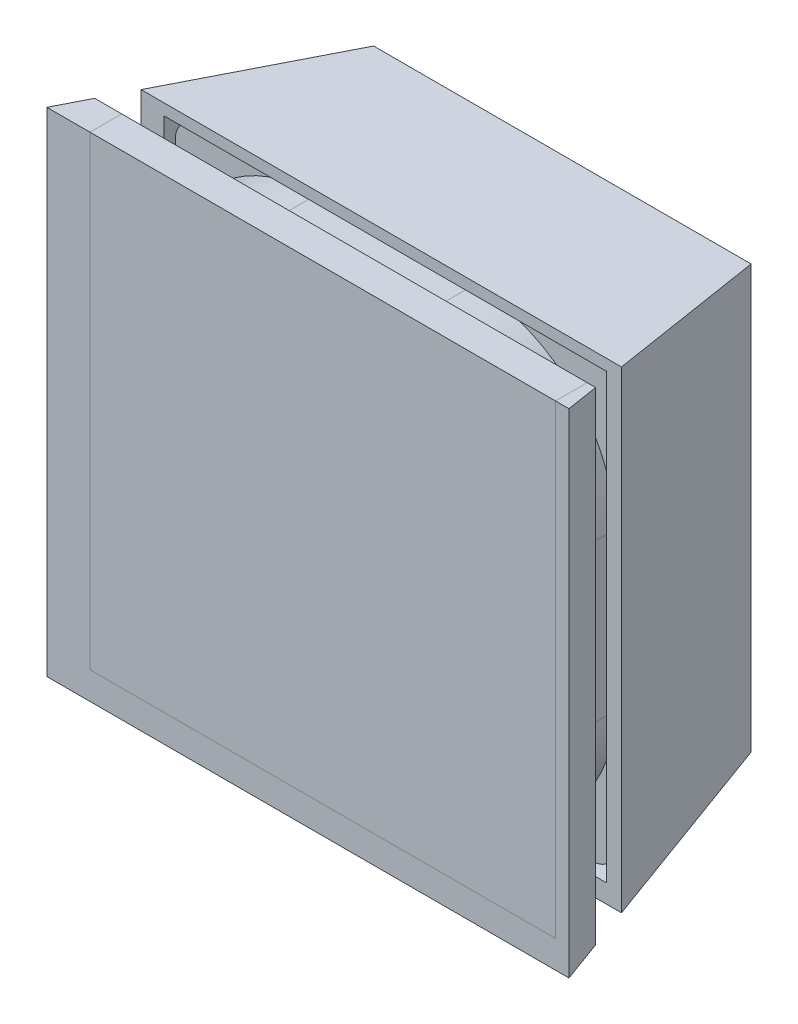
ISO-10303-21;
HEADER;
FILE_DESCRIPTION(('STEP AP214'),'2;1');
FILE_NAME('part.step','',(''),(''),'','','');
FILE_SCHEMA(('AUTOMOTIVE_DESIGN { 1 0 10303 214 1 1 1 1 }'));
ENDSEC;
DATA;
#1=APPLICATION_CONTEXT('core data for automotive mechanical design processes');
#2=APPLICATION_PROTOCOL_DEFINITION('international standard','automotive_design',2000,#1);
#3=PRODUCT_CONTEXT('',#1,'mechanical');
#4=PRODUCT('Part','Part','',(#3));
#5=PRODUCT_RELATED_PRODUCT_CATEGORY('part','',(#4));
#6=PRODUCT_DEFINITION_FORMATION('','',#4);
#7=PRODUCT_DEFINITION_CONTEXT('part definition',#1,'design');
#8=PRODUCT_DEFINITION('design','',#6,#7);
#9=PRODUCT_DEFINITION_SHAPE('','',#8);
#10=(LENGTH_UNIT() NAMED_UNIT(*) SI_UNIT(.MILLI.,.METRE.));
#11=(NAMED_UNIT(*) PLANE_ANGLE_UNIT() SI_UNIT($,.RADIAN.));
#12=(NAMED_UNIT(*) SI_UNIT($,.STERADIAN.) SOLID_ANGLE_UNIT());
#13=UNCERTAINTY_MEASURE_WITH_UNIT(LENGTH_MEASURE(1.E-05),#10,'distance_accuracy_value','');
#14=(GEOMETRIC_REPRESENTATION_CONTEXT(3) GLOBAL_UNCERTAINTY_ASSIGNED_CONTEXT((#13)) GLOBAL_UNIT_ASSIGNED_CONTEXT((#10,
#11,#12)) REPRESENTATION_CONTEXT('',''));
#15=CARTESIAN_POINT('',(0.,0.,0.));
#16=DIRECTION('',(0.,0.,1.));
#17=DIRECTION('',(1.,0.,0.));
#18=AXIS2_PLACEMENT_3D('',#15,#16,#17);
#19=CARTESIAN_POINT('',(40.6,70.6000000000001,-20.7999999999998));
#20=DIRECTION('',(0.,-1.,0.));
#21=DIRECTION('',(-1.,0.,0.));
#22=AXIS2_PLACEMENT_3D('',#19,#20,#21);
#23=PLANE('',#22);
#24=DIRECTION('',(0.,0.,1.));
#25=VECTOR('',#24,1.);
#26=CARTESIAN_POINT('',(52.6,70.6000000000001,-20.7999999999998));
#27=LINE('',#26,#25);
#28=CARTESIAN_POINT('',(52.6,70.6000000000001,-20.7999999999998));
#29=VERTEX_POINT('',#28);
#30=CARTESIAN_POINT('',(52.6,70.6000000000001,-16.8999999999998));
#31=VERTEX_POINT('',#30);
#32=EDGE_CURVE('E170',#29,#31,#27,.T.);
#33=ORIENTED_EDGE('',*,*,#32,.F.);
#34=DIRECTION('',(1.,0.,0.));
#35=VECTOR('',#34,1.);
#36=CARTESIAN_POINT('',(40.6,70.6000000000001,-20.7999999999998));
#37=LINE('',#36,#35);
#38=CARTESIAN_POINT('',(40.6,70.6000000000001,-20.7999999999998));
#39=VERTEX_POINT('',#38);
#40=EDGE_CURVE('E169',#39,#29,#37,.T.);
#41=ORIENTED_EDGE('',*,*,#40,.F.);
#42=DIRECTION('',(0.,0.,1.));
#43=VECTOR('',#42,1.);
#44=CARTESIAN_POINT('',(40.6,70.6000000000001,-20.7999999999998));
#45=LINE('',#44,#43);
#46=CARTESIAN_POINT('',(40.6,70.6000000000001,-16.8999999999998));
#47=VERTEX_POINT('',#46);
#48=EDGE_CURVE('E164',#39,#47,#45,.T.);
#49=ORIENTED_EDGE('',*,*,#48,.T.);
#50=DIRECTION('',(1.,0.,0.));
#51=VECTOR('',#50,1.);
#52=CARTESIAN_POINT('',(40.6,70.6000000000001,-16.8999999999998));
#53=LINE('',#52,#51);
#54=EDGE_CURVE('E13',#47,#31,#53,.T.);
#55=ORIENTED_EDGE('',*,*,#54,.T.);
#56=EDGE_LOOP('',(#33,#41,#49,#55));
#57=FACE_BOUND('',#56,.T.);
#58=ADVANCED_FACE('F107',(#57),#23,.F.);
#59=CARTESIAN_POINT('',(40.6,70.6000000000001,-16.8999999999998));
#60=DIRECTION('',(0.,0.70710678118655,-0.707106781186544));
#61=DIRECTION('',(0.,0.707106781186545,0.70710678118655));
#62=AXIS2_PLACEMENT_3D('',#59,#60,#61);
#63=PLANE('',#62);
#64=DIRECTION('',(0.,-0.707106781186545,-0.70710678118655));
#65=VECTOR('',#64,1.);
#66=CARTESIAN_POINT('',(52.6,70.6000000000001,-16.8999999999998));
#67=LINE('',#66,#65);
#68=CARTESIAN_POINT('',(52.5999999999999,69.4000000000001,-18.0999999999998));
#69=VERTEX_POINT('',#68);
#70=EDGE_CURVE('E172',#31,#69,#67,.T.);
#71=ORIENTED_EDGE('',*,*,#70,.F.);
#72=ORIENTED_EDGE('',*,*,#54,.F.);
#73=DIRECTION('',(0.,-0.707106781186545,-0.70710678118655));
#74=VECTOR('',#73,1.);
#75=CARTESIAN_POINT('',(40.6,70.6000000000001,-16.8999999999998));
#76=LINE('',#75,#74);
#77=CARTESIAN_POINT('',(40.6,69.4000000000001,-18.0999999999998));
#78=VERTEX_POINT('',#77);
#79=EDGE_CURVE('E148',#47,#78,#76,.T.);
#80=ORIENTED_EDGE('',*,*,#79,.T.);
#81=DIRECTION('',(1.,0.,0.));
#82=VECTOR('',#81,1.);
#83=CARTESIAN_POINT('',(40.6,69.4000000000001,-18.0999999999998));
#84=LINE('',#83,#82);
#85=EDGE_CURVE('E115',#78,#69,#84,.T.);
#86=ORIENTED_EDGE('',*,*,#85,.T.);
#87=EDGE_LOOP('',(#71,#72,#80,#86));
#88=FACE_BOUND('',#87,.T.);
#89=ADVANCED_FACE('F162',(#88),#63,.F.);
#90=CARTESIAN_POINT('',(40.6,69.4000000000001,-18.0999999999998));
#91=DIRECTION('',(0.,1.,0.));
#92=DIRECTION('',(1.,0.,0.));
#93=AXIS2_PLACEMENT_3D('',#90,#91,#92);
#94=PLANE('',#93);
#95=DIRECTION('',(0.,0.,-1.));
#96=VECTOR('',#95,1.);
#97=CARTESIAN_POINT('',(52.5999999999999,69.4000000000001,-18.0999999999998));
#98=LINE('',#97,#96);
#99=CARTESIAN_POINT('',(52.5999999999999,69.4000000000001,-19.5999999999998));
#100=VERTEX_POINT('',#99);
#101=EDGE_CURVE('E158',#69,#100,#98,.T.);
#102=ORIENTED_EDGE('',*,*,#101,.F.);
#103=ORIENTED_EDGE('',*,*,#85,.F.);
#104=DIRECTION('',(0.,0.,-1.));
#105=VECTOR('',#104,1.);
#106=CARTESIAN_POINT('',(40.6,69.4000000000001,-18.0999999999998));
#107=LINE('',#106,#105);
#108=CARTESIAN_POINT('',(40.6,69.4000000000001,-19.5999999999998));
#109=VERTEX_POINT('',#108);
#110=EDGE_CURVE('E151',#78,#109,#107,.T.);
#111=ORIENTED_EDGE('',*,*,#110,.T.);
#112=DIRECTION('',(1.,0.,0.));
#113=VECTOR('',#112,1.);
#114=CARTESIAN_POINT('',(40.6,69.4000000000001,-19.5999999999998));
#115=LINE('',#114,#113);
#116=EDGE_CURVE('E161',#109,#100,#115,.T.);
#117=ORIENTED_EDGE('',*,*,#116,.T.);
#118=EDGE_LOOP('',(#102,#103,#111,#117));
#119=FACE_BOUND('',#118,.T.);
#120=ADVANCED_FACE('F157',(#119),#94,.F.);
#121=CARTESIAN_POINT('',(40.6,69.4000000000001,-19.5999999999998));
#122=DIRECTION('',(0.,0.707106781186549,0.707106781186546));
#123=DIRECTION('',(0.,-0.707106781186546,0.707106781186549));
#124=AXIS2_PLACEMENT_3D('',#121,#122,#123);
#125=PLANE('',#124);
#126=DIRECTION('',(0.,0.707106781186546,-0.707106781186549));
#127=VECTOR('',#126,1.);
#128=CARTESIAN_POINT('',(52.5999999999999,69.4000000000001,-19.5999999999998));
#129=LINE('',#128,#127);
#130=EDGE_CURVE('E137',#100,#29,#129,.T.);
#131=ORIENTED_EDGE('',*,*,#130,.F.);
#132=ORIENTED_EDGE('',*,*,#116,.F.);
#133=DIRECTION('',(0.,0.707106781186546,-0.707106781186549));
#134=VECTOR('',#133,1.);
#135=CARTESIAN_POINT('',(40.6,69.4000000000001,-19.5999999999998));
#136=LINE('',#135,#134);
#137=EDGE_CURVE('E123',#109,#39,#136,.T.);
#138=ORIENTED_EDGE('',*,*,#137,.T.);
#139=ORIENTED_EDGE('',*,*,#40,.T.);
#140=EDGE_LOOP('',(#131,#132,#138,#139));
#141=FACE_BOUND('',#140,.T.);
#142=ADVANCED_FACE('F181',(#141),#125,.F.);
#143=CARTESIAN_POINT('',(40.5999999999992,-8.04512966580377E-13,0.));
#144=DIRECTION('',(-1.,0.,0.));
#145=DIRECTION('',(0.,1.,0.));
#146=AXIS2_PLACEMENT_3D('',#143,#144,#145);
#147=PLANE('',#146);
#148=ORIENTED_EDGE('',*,*,#48,.F.);
#149=ORIENTED_EDGE('',*,*,#137,.F.);
#150=ORIENTED_EDGE('',*,*,#110,.F.);
#151=ORIENTED_EDGE('',*,*,#79,.F.);
#152=EDGE_LOOP('',(#148,#149,#150,#151));
#153=FACE_BOUND('',#152,.T.);
#154=ADVANCED_FACE('F153',(#153),#147,.T.);
#155=CARTESIAN_POINT('',(52.5999999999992,-8.03027846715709E-13,0.));
#156=DIRECTION('',(-1.,0.,0.));
#157=DIRECTION('',(0.,1.,0.));
#158=AXIS2_PLACEMENT_3D('',#155,#156,#157);
#159=PLANE('',#158);
#160=ORIENTED_EDGE('',*,*,#32,.T.);
#161=ORIENTED_EDGE('',*,*,#70,.T.);
#162=ORIENTED_EDGE('',*,*,#101,.T.);
#163=ORIENTED_EDGE('',*,*,#130,.T.);
#164=EDGE_LOOP('',(#160,#161,#162,#163));
#165=FACE_BOUND('',#164,.T.);
#166=ADVANCED_FACE('F177',(#165),#159,.F.);
#167=CLOSED_SHELL('',(#58,#89,#120,#142,#154,#166));
#168=MANIFOLD_SOLID_BREP('B2',#167);
#169=CARTESIAN_POINT('',(-40.6000000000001,70.6,-20.7999999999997));
#170=DIRECTION('',(0.,-1.,0.));
#171=DIRECTION('',(1.,0.,0.));
#172=AXIS2_PLACEMENT_3D('',#169,#170,#171);
#173=PLANE('',#172);
#174=DIRECTION('',(0.,0.,1.));
#175=VECTOR('',#174,1.);
#176=CARTESIAN_POINT('',(-52.6000000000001,70.6,-20.7999999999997));
#177=LINE('',#176,#175);
#178=CARTESIAN_POINT('',(-52.6000000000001,70.6,-20.7999999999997));
#179=VERTEX_POINT('',#178);
#180=CARTESIAN_POINT('',(-52.6000000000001,70.6,-16.8999999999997));
#181=VERTEX_POINT('',#180);
#182=EDGE_CURVE('E320',#179,#181,#177,.T.);
#183=ORIENTED_EDGE('',*,*,#182,.T.);
#184=DIRECTION('',(-1.,0.,0.));
#185=VECTOR('',#184,1.);
#186=CARTESIAN_POINT('',(-40.6000000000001,70.6,-16.8999999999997));
#187=LINE('',#186,#185);
#188=CARTESIAN_POINT('',(-40.6000000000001,70.6,-16.8999999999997));
#189=VERTEX_POINT('',#188);
#190=EDGE_CURVE('E105',#189,#181,#187,.T.);
#191=ORIENTED_EDGE('',*,*,#190,.F.);
#192=DIRECTION('',(0.,0.,1.));
#193=VECTOR('',#192,1.);
#194=CARTESIAN_POINT('',(-40.6000000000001,70.6,-20.7999999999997));
#195=LINE('',#194,#193);
#196=CARTESIAN_POINT('',(-40.6000000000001,70.6,-20.7999999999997));
#197=VERTEX_POINT('',#196);
#198=EDGE_CURVE('E307',#197,#189,#195,.T.);
#199=ORIENTED_EDGE('',*,*,#198,.F.);
#200=DIRECTION('',(-1.,0.,0.));
#201=VECTOR('',#200,1.);
#202=CARTESIAN_POINT('',(-40.6000000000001,70.6,-20.7999999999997));
#203=LINE('',#202,#201);
#204=EDGE_CURVE('E312',#197,#179,#203,.T.);
#205=ORIENTED_EDGE('',*,*,#204,.T.);
#206=EDGE_LOOP('',(#183,#191,#199,#205));
#207=FACE_BOUND('',#206,.T.);
#208=ADVANCED_FACE('F252',(#207),#173,.F.);
#209=CARTESIAN_POINT('',(-40.6000000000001,70.6,-16.8999999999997));
#210=DIRECTION('',(0.,0.70710678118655,-0.707106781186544));
#211=DIRECTION('',(0.,0.707106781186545,0.70710678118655));
#212=AXIS2_PLACEMENT_3D('',#209,#210,#211);
#213=PLANE('',#212);
#214=DIRECTION('',(0.,-0.707106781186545,-0.70710678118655));
#215=VECTOR('',#214,1.);
#216=CARTESIAN_POINT('',(-52.6000000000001,70.6,-16.8999999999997));
#217=LINE('',#216,#215);
#218=CARTESIAN_POINT('',(-52.6,69.4,-18.0999999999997));
#219=VERTEX_POINT('',#218);
#220=EDGE_CURVE('E311',#181,#219,#217,.T.);
#221=ORIENTED_EDGE('',*,*,#220,.T.);
#222=DIRECTION('',(-1.,0.,0.));
#223=VECTOR('',#222,1.);
#224=CARTESIAN_POINT('',(-40.6,69.4,-18.0999999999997));
#225=LINE('',#224,#223);
#226=CARTESIAN_POINT('',(-40.6,69.4,-18.0999999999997));
#227=VERTEX_POINT('',#226);
#228=EDGE_CURVE('E260',#227,#219,#225,.T.);
#229=ORIENTED_EDGE('',*,*,#228,.F.);
#230=DIRECTION('',(0.,-0.707106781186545,-0.70710678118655));
#231=VECTOR('',#230,1.);
#232=CARTESIAN_POINT('',(-40.6000000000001,70.6,-16.8999999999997));
#233=LINE('',#232,#231);
#234=EDGE_CURVE('E294',#189,#227,#233,.T.);
#235=ORIENTED_EDGE('',*,*,#234,.F.);
#236=ORIENTED_EDGE('',*,*,#190,.T.);
#237=EDGE_LOOP('',(#221,#229,#235,#236));
#238=FACE_BOUND('',#237,.T.);
#239=ADVANCED_FACE('F310',(#238),#213,.F.);
#240=CARTESIAN_POINT('',(-40.6,69.4,-18.0999999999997));
#241=DIRECTION('',(0.,1.,0.));
#242=DIRECTION('',(-1.,0.,0.));
#243=AXIS2_PLACEMENT_3D('',#240,#241,#242);
#244=PLANE('',#243);
#245=DIRECTION('',(0.,0.,-1.));
#246=VECTOR('',#245,1.);
#247=CARTESIAN_POINT('',(-52.6,69.4,-18.0999999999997));
#248=LINE('',#247,#246);
#249=CARTESIAN_POINT('',(-52.6,69.4,-19.5999999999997));
#250=VERTEX_POINT('',#249);
#251=EDGE_CURVE('E317',#219,#250,#248,.T.);
#252=ORIENTED_EDGE('',*,*,#251,.T.);
#253=DIRECTION('',(-1.,0.,0.));
#254=VECTOR('',#253,1.);
#255=CARTESIAN_POINT('',(-40.6,69.4,-19.5999999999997));
#256=LINE('',#255,#254);
#257=CARTESIAN_POINT('',(-40.6,69.4,-19.5999999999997));
#258=VERTEX_POINT('',#257);
#259=EDGE_CURVE('E303',#258,#250,#256,.T.);
#260=ORIENTED_EDGE('',*,*,#259,.F.);
#261=DIRECTION('',(0.,0.,-1.));
#262=VECTOR('',#261,1.);
#263=CARTESIAN_POINT('',(-40.6,69.4,-18.0999999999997));
#264=LINE('',#263,#262);
#265=EDGE_CURVE('E299',#227,#258,#264,.T.);
#266=ORIENTED_EDGE('',*,*,#265,.F.);
#267=ORIENTED_EDGE('',*,*,#228,.T.);
#268=EDGE_LOOP('',(#252,#260,#266,#267));
#269=FACE_BOUND('',#268,.T.);
#270=ADVANCED_FACE('F301',(#269),#244,.F.);
#271=CARTESIAN_POINT('',(-40.6,69.4,-19.5999999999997));
#272=DIRECTION('',(0.,0.707106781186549,0.707106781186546));
#273=DIRECTION('',(0.,-0.707106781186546,0.707106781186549));
#274=AXIS2_PLACEMENT_3D('',#271,#272,#273);
#275=PLANE('',#274);
#276=DIRECTION('',(0.,0.707106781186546,-0.707106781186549));
#277=VECTOR('',#276,1.);
#278=CARTESIAN_POINT('',(-52.6,69.4,-19.5999999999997));
#279=LINE('',#278,#277);
#280=EDGE_CURVE('E284',#250,#179,#279,.T.);
#281=ORIENTED_EDGE('',*,*,#280,.T.);
#282=ORIENTED_EDGE('',*,*,#204,.F.);
#283=DIRECTION('',(0.,0.707106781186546,-0.707106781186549));
#284=VECTOR('',#283,1.);
#285=CARTESIAN_POINT('',(-40.6,69.4,-19.5999999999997));
#286=LINE('',#285,#284);
#287=EDGE_CURVE('E268',#258,#197,#286,.T.);
#288=ORIENTED_EDGE('',*,*,#287,.F.);
#289=ORIENTED_EDGE('',*,*,#259,.T.);
#290=EDGE_LOOP('',(#281,#282,#288,#289));
#291=FACE_BOUND('',#290,.T.);
#292=ADVANCED_FACE('F331',(#291),#275,.F.);
#293=CARTESIAN_POINT('',(-40.5999999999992,-8.22542988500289E-13,0.));
#294=DIRECTION('',(1.,0.,0.));
#295=DIRECTION('',(0.,1.,0.));
#296=AXIS2_PLACEMENT_3D('',#293,#294,#295);
#297=PLANE('',#296);
#298=ORIENTED_EDGE('',*,*,#198,.T.);
#299=ORIENTED_EDGE('',*,*,#234,.T.);
#300=ORIENTED_EDGE('',*,*,#265,.T.);
#301=ORIENTED_EDGE('',*,*,#287,.T.);
#302=EDGE_LOOP('',(#298,#299,#300,#301));
#303=FACE_BOUND('',#302,.T.);
#304=ADVANCED_FACE('F305',(#303),#297,.T.);
#305=CARTESIAN_POINT('',(-52.5999999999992,-8.26386939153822E-13,0.));
#306=DIRECTION('',(1.,0.,0.));
#307=DIRECTION('',(0.,1.,0.));
#308=AXIS2_PLACEMENT_3D('',#305,#306,#307);
#309=PLANE('',#308);
#310=ORIENTED_EDGE('',*,*,#182,.F.);
#311=ORIENTED_EDGE('',*,*,#280,.F.);
#312=ORIENTED_EDGE('',*,*,#251,.F.);
#313=ORIENTED_EDGE('',*,*,#220,.F.);
#314=EDGE_LOOP('',(#310,#311,#312,#313));
#315=FACE_BOUND('',#314,.T.);
#316=ADVANCED_FACE('F325',(#315),#309,.F.);
#317=CLOSED_SHELL('',(#208,#239,#270,#292,#304,#316));
#318=MANIFOLD_SOLID_BREP('B7',#317);
#319=CARTESIAN_POINT('',(-40.6,-70.6,-20.7999999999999));
#320=DIRECTION('',(0.,1.,0.));
#321=DIRECTION('',(1.,0.,0.));
#322=AXIS2_PLACEMENT_3D('',#319,#320,#321);
#323=PLANE('',#322);
#324=DIRECTION('',(0.,0.,1.));
#325=VECTOR('',#324,1.);
#326=CARTESIAN_POINT('',(-52.6,-70.6,-20.7999999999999));
#327=LINE('',#326,#325);
#328=CARTESIAN_POINT('',(-52.6,-70.6,-20.7999999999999));
#329=VERTEX_POINT('',#328);
#330=CARTESIAN_POINT('',(-52.6,-70.6,-16.8999999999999));
#331=VERTEX_POINT('',#330);
#332=EDGE_CURVE('E460',#329,#331,#327,.T.);
#333=ORIENTED_EDGE('',*,*,#332,.F.);
#334=DIRECTION('',(-1.,0.,0.));
#335=VECTOR('',#334,1.);
#336=CARTESIAN_POINT('',(-40.6,-70.6,-20.7999999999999));
#337=LINE('',#336,#335);
#338=CARTESIAN_POINT('',(-40.6,-70.6,-20.7999999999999));
#339=VERTEX_POINT('',#338);
#340=EDGE_CURVE('E459',#339,#329,#337,.T.);
#341=ORIENTED_EDGE('',*,*,#340,.F.);
#342=DIRECTION('',(0.,0.,1.));
#343=VECTOR('',#342,1.);
#344=CARTESIAN_POINT('',(-40.6,-70.6,-20.7999999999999));
#345=LINE('',#344,#343);
#346=CARTESIAN_POINT('',(-40.6,-70.6,-16.8999999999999));
#347=VERTEX_POINT('',#346);
#348=EDGE_CURVE('E454',#339,#347,#345,.T.);
#349=ORIENTED_EDGE('',*,*,#348,.T.);
#350=DIRECTION('',(-1.,0.,0.));
#351=VECTOR('',#350,1.);
#352=CARTESIAN_POINT('',(-40.6,-70.6,-16.8999999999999));
#353=LINE('',#352,#351);
#354=EDGE_CURVE('E250',#347,#331,#353,.T.);
#355=ORIENTED_EDGE('',*,*,#354,.T.);
#356=EDGE_LOOP('',(#333,#341,#349,#355));
#357=FACE_BOUND('',#356,.T.);
#358=ADVANCED_FACE('F397',(#357),#323,.F.);
#359=CARTESIAN_POINT('',(-40.6,-70.6,-16.8999999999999));
#360=DIRECTION('',(0.,-0.707106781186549,-0.707106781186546));
#361=DIRECTION('',(0.,-0.707106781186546,0.707106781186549));
#362=AXIS2_PLACEMENT_3D('',#359,#360,#361);
#363=PLANE('',#362);
#364=DIRECTION('',(0.,0.707106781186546,-0.707106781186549));
#365=VECTOR('',#364,1.);
#366=CARTESIAN_POINT('',(-52.6,-70.6,-16.8999999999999));
#367=LINE('',#366,#365);
#368=CARTESIAN_POINT('',(-52.6,-69.4,-18.0999999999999));
#369=VERTEX_POINT('',#368);
#370=EDGE_CURVE('E462',#331,#369,#367,.T.);
#371=ORIENTED_EDGE('',*,*,#370,.F.);
#372=ORIENTED_EDGE('',*,*,#354,.F.);
#373=DIRECTION('',(0.,0.707106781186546,-0.707106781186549));
#374=VECTOR('',#373,1.);
#375=CARTESIAN_POINT('',(-40.6,-70.6,-16.8999999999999));
#376=LINE('',#375,#374);
#377=CARTESIAN_POINT('',(-40.6,-69.4,-18.0999999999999));
#378=VERTEX_POINT('',#377);
#379=EDGE_CURVE('E438',#347,#378,#376,.T.);
#380=ORIENTED_EDGE('',*,*,#379,.T.);
#381=DIRECTION('',(-1.,0.,0.));
#382=VECTOR('',#381,1.);
#383=CARTESIAN_POINT('',(-40.6,-69.4,-18.0999999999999));
#384=LINE('',#383,#382);
#385=EDGE_CURVE('E405',#378,#369,#384,.T.);
#386=ORIENTED_EDGE('',*,*,#385,.T.);
#387=EDGE_LOOP('',(#371,#372,#380,#386));
#388=FACE_BOUND('',#387,.T.);
#389=ADVANCED_FACE('F452',(#388),#363,.F.);
#390=CARTESIAN_POINT('',(-40.6,-69.4,-18.0999999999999));
#391=DIRECTION('',(0.,-1.,0.));
#392=DIRECTION('',(-1.,0.,0.));
#393=AXIS2_PLACEMENT_3D('',#390,#391,#392);
#394=PLANE('',#393);
#395=DIRECTION('',(0.,0.,-1.));
#396=VECTOR('',#395,1.);
#397=CARTESIAN_POINT('',(-52.6,-69.4,-18.0999999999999));
#398=LINE('',#397,#396);
#399=CARTESIAN_POINT('',(-52.6,-69.4,-19.5999999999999));
#400=VERTEX_POINT('',#399);
#401=EDGE_CURVE('E448',#369,#400,#398,.T.);
#402=ORIENTED_EDGE('',*,*,#401,.F.);
#403=ORIENTED_EDGE('',*,*,#385,.F.);
#404=DIRECTION('',(0.,0.,-1.));
#405=VECTOR('',#404,1.);
#406=CARTESIAN_POINT('',(-40.6,-69.4,-18.0999999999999));
#407=LINE('',#406,#405);
#408=CARTESIAN_POINT('',(-40.6,-69.4,-19.5999999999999));
#409=VERTEX_POINT('',#408);
#410=EDGE_CURVE('E441',#378,#409,#407,.T.);
#411=ORIENTED_EDGE('',*,*,#410,.T.);
#412=DIRECTION('',(-1.,0.,0.));
#413=VECTOR('',#412,1.);
#414=CARTESIAN_POINT('',(-40.6,-69.4,-19.5999999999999));
#415=LINE('',#414,#413);
#416=EDGE_CURVE('E451',#409,#400,#415,.T.);
#417=ORIENTED_EDGE('',*,*,#416,.T.);
#418=EDGE_LOOP('',(#402,#403,#411,#417));
#419=FACE_BOUND('',#418,.T.);
#420=ADVANCED_FACE('F447',(#419),#394,.F.);
#421=CARTESIAN_POINT('',(-40.6,-69.4,-19.5999999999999));
#422=DIRECTION('',(0.,-0.70710678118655,0.707106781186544));
#423=DIRECTION('',(0.,0.707106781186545,0.70710678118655));
#424=AXIS2_PLACEMENT_3D('',#421,#422,#423);
#425=PLANE('',#424);
#426=DIRECTION('',(0.,-0.707106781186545,-0.70710678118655));
#427=VECTOR('',#426,1.);
#428=CARTESIAN_POINT('',(-52.6,-69.4,-19.5999999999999));
#429=LINE('',#428,#427);
#430=EDGE_CURVE('E427',#400,#329,#429,.T.);
#431=ORIENTED_EDGE('',*,*,#430,.F.);
#432=ORIENTED_EDGE('',*,*,#416,.F.);
#433=DIRECTION('',(0.,-0.707106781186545,-0.70710678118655));
#434=VECTOR('',#433,1.);
#435=CARTESIAN_POINT('',(-40.6,-69.4,-19.5999999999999));
#436=LINE('',#435,#434);
#437=EDGE_CURVE('E413',#409,#339,#436,.T.);
#438=ORIENTED_EDGE('',*,*,#437,.T.);
#439=ORIENTED_EDGE('',*,*,#340,.T.);
#440=EDGE_LOOP('',(#431,#432,#438,#439));
#441=FACE_BOUND('',#440,.T.);
#442=ADVANCED_FACE('F471',(#441),#425,.F.);
#443=CARTESIAN_POINT('',(-40.5999999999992,8.04512966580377E-13,0.));
#444=DIRECTION('',(1.,0.,0.));
#445=DIRECTION('',(0.,-1.,0.));
#446=AXIS2_PLACEMENT_3D('',#443,#444,#445);
#447=PLANE('',#446);
#448=ORIENTED_EDGE('',*,*,#348,.F.);
#449=ORIENTED_EDGE('',*,*,#437,.F.);
#450=ORIENTED_EDGE('',*,*,#410,.F.);
#451=ORIENTED_EDGE('',*,*,#379,.F.);
#452=EDGE_LOOP('',(#448,#449,#450,#451));
#453=FACE_BOUND('',#452,.T.);
#454=ADVANCED_FACE('F443',(#453),#447,.T.);
#455=CARTESIAN_POINT('',(-52.5999999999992,8.03027846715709E-13,0.));
#456=DIRECTION('',(1.,0.,0.));
#457=DIRECTION('',(0.,-1.,0.));
#458=AXIS2_PLACEMENT_3D('',#455,#456,#457);
#459=PLANE('',#458);
#460=ORIENTED_EDGE('',*,*,#332,.T.);
#461=ORIENTED_EDGE('',*,*,#370,.T.);
#462=ORIENTED_EDGE('',*,*,#401,.T.);
#463=ORIENTED_EDGE('',*,*,#430,.T.);
#464=EDGE_LOOP('',(#460,#461,#462,#463));
#465=FACE_BOUND('',#464,.T.);
#466=ADVANCED_FACE('F467',(#465),#459,.F.);
#467=CLOSED_SHELL('',(#358,#389,#420,#442,#454,#466));
#468=MANIFOLD_SOLID_BREP('B99',#467);
#469=CARTESIAN_POINT('',(40.6,-70.6,-20.8));
#470=DIRECTION('',(0.,1.,0.));
#471=DIRECTION('',(-1.,0.,0.));
#472=AXIS2_PLACEMENT_3D('',#469,#470,#471);
#473=PLANE('',#472);
#474=DIRECTION('',(0.,0.,1.));
#475=VECTOR('',#474,1.);
#476=CARTESIAN_POINT('',(52.6,-70.6,-20.8));
#477=LINE('',#476,#475);
#478=CARTESIAN_POINT('',(52.6,-70.6,-20.8));
#479=VERTEX_POINT('',#478);
#480=CARTESIAN_POINT('',(52.6,-70.6,-16.9));
#481=VERTEX_POINT('',#480);
#482=EDGE_CURVE('E610',#479,#481,#477,.T.);
#483=ORIENTED_EDGE('',*,*,#482,.T.);
#484=DIRECTION('',(1.,0.,0.));
#485=VECTOR('',#484,1.);
#486=CARTESIAN_POINT('',(40.6,-70.6,-16.9));
#487=LINE('',#486,#485);
#488=CARTESIAN_POINT('',(40.6,-70.6,-16.9));
#489=VERTEX_POINT('',#488);
#490=EDGE_CURVE('E395',#489,#481,#487,.T.);
#491=ORIENTED_EDGE('',*,*,#490,.F.);
#492=DIRECTION('',(0.,0.,1.));
#493=VECTOR('',#492,1.);
#494=CARTESIAN_POINT('',(40.6,-70.6,-20.8));
#495=LINE('',#494,#493);
#496=CARTESIAN_POINT('',(40.6,-70.6,-20.8));
#497=VERTEX_POINT('',#496);
#498=EDGE_CURVE('E597',#497,#489,#495,.T.);
#499=ORIENTED_EDGE('',*,*,#498,.F.);
#500=DIRECTION('',(1.,0.,0.));
#501=VECTOR('',#500,1.);
#502=CARTESIAN_POINT('',(40.6,-70.6,-20.8));
#503=LINE('',#502,#501);
#504=EDGE_CURVE('E602',#497,#479,#503,.T.);
#505=ORIENTED_EDGE('',*,*,#504,.T.);
#506=EDGE_LOOP('',(#483,#491,#499,#505));
#507=FACE_BOUND('',#506,.T.);
#508=ADVANCED_FACE('F542',(#507),#473,.F.);
#509=CARTESIAN_POINT('',(40.6,-70.6,-16.9));
#510=DIRECTION('',(0.,-0.707106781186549,-0.707106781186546));
#511=DIRECTION('',(0.,-0.707106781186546,0.707106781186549));
#512=AXIS2_PLACEMENT_3D('',#509,#510,#511);
#513=PLANE('',#512);
#514=DIRECTION('',(0.,0.707106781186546,-0.707106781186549));
#515=VECTOR('',#514,1.);
#516=CARTESIAN_POINT('',(52.6,-70.6,-16.9));
#517=LINE('',#516,#515);
#518=CARTESIAN_POINT('',(52.6,-69.4,-18.1));
#519=VERTEX_POINT('',#518);
#520=EDGE_CURVE('E601',#481,#519,#517,.T.);
#521=ORIENTED_EDGE('',*,*,#520,.T.);
#522=DIRECTION('',(1.,0.,0.));
#523=VECTOR('',#522,1.);
#524=CARTESIAN_POINT('',(40.6,-69.4,-18.1));
#525=LINE('',#524,#523);
#526=CARTESIAN_POINT('',(40.6,-69.4,-18.1));
#527=VERTEX_POINT('',#526);
#528=EDGE_CURVE('E550',#527,#519,#525,.T.);
#529=ORIENTED_EDGE('',*,*,#528,.F.);
#530=DIRECTION('',(0.,0.707106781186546,-0.707106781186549));
#531=VECTOR('',#530,1.);
#532=CARTESIAN_POINT('',(40.6,-70.6,-16.9));
#533=LINE('',#532,#531);
#534=EDGE_CURVE('E584',#489,#527,#533,.T.);
#535=ORIENTED_EDGE('',*,*,#534,.F.);
#536=ORIENTED_EDGE('',*,*,#490,.T.);
#537=EDGE_LOOP('',(#521,#529,#535,#536));
#538=FACE_BOUND('',#537,.T.);
#539=ADVANCED_FACE('F600',(#538),#513,.F.);
#540=CARTESIAN_POINT('',(40.6,-69.4,-18.1));
#541=DIRECTION('',(0.,-1.,0.));
#542=DIRECTION('',(1.,0.,0.));
#543=AXIS2_PLACEMENT_3D('',#540,#541,#542);
#544=PLANE('',#543);
#545=DIRECTION('',(0.,0.,-1.));
#546=VECTOR('',#545,1.);
#547=CARTESIAN_POINT('',(52.6,-69.4,-18.1));
#548=LINE('',#547,#546);
#549=CARTESIAN_POINT('',(52.6,-69.4,-19.6));
#550=VERTEX_POINT('',#549);
#551=EDGE_CURVE('E607',#519,#550,#548,.T.);
#552=ORIENTED_EDGE('',*,*,#551,.T.);
#553=DIRECTION('',(1.,0.,0.));
#554=VECTOR('',#553,1.);
#555=CARTESIAN_POINT('',(40.6,-69.4,-19.6));
#556=LINE('',#555,#554);
#557=CARTESIAN_POINT('',(40.6,-69.4,-19.6));
#558=VERTEX_POINT('',#557);
#559=EDGE_CURVE('E593',#558,#550,#556,.T.);
#560=ORIENTED_EDGE('',*,*,#559,.F.);
#561=DIRECTION('',(0.,0.,-1.));
#562=VECTOR('',#561,1.);
#563=CARTESIAN_POINT('',(40.6,-69.4,-18.1));
#564=LINE('',#563,#562);
#565=EDGE_CURVE('E589',#527,#558,#564,.T.);
#566=ORIENTED_EDGE('',*,*,#565,.F.);
#567=ORIENTED_EDGE('',*,*,#528,.T.);
#568=EDGE_LOOP('',(#552,#560,#566,#567));
#569=FACE_BOUND('',#568,.T.);
#570=ADVANCED_FACE('F591',(#569),#544,.F.);
#571=CARTESIAN_POINT('',(40.6,-69.4,-19.6));
#572=DIRECTION('',(0.,-0.70710678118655,0.707106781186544));
#573=DIRECTION('',(0.,0.707106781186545,0.70710678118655));
#574=AXIS2_PLACEMENT_3D('',#571,#572,#573);
#575=PLANE('',#574);
#576=DIRECTION('',(0.,-0.707106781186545,-0.70710678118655));
#577=VECTOR('',#576,1.);
#578=CARTESIAN_POINT('',(52.6,-69.4,-19.6));
#579=LINE('',#578,#577);
#580=EDGE_CURVE('E574',#550,#479,#579,.T.);
#581=ORIENTED_EDGE('',*,*,#580,.T.);
#582=ORIENTED_EDGE('',*,*,#504,.F.);
#583=DIRECTION('',(0.,-0.707106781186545,-0.70710678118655));
#584=VECTOR('',#583,1.);
#585=CARTESIAN_POINT('',(40.6,-69.4,-19.6));
#586=LINE('',#585,#584);
#587=EDGE_CURVE('E558',#558,#497,#586,.T.);
#588=ORIENTED_EDGE('',*,*,#587,.F.);
#589=ORIENTED_EDGE('',*,*,#559,.T.);
#590=EDGE_LOOP('',(#581,#582,#588,#589));
#591=FACE_BOUND('',#590,.T.);
#592=ADVANCED_FACE('F621',(#591),#575,.F.);
#593=CARTESIAN_POINT('',(40.5999999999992,8.22542988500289E-13,0.));
#594=DIRECTION('',(-1.,0.,0.));
#595=DIRECTION('',(0.,-1.,0.));
#596=AXIS2_PLACEMENT_3D('',#593,#594,#595);
#597=PLANE('',#596);
#598=ORIENTED_EDGE('',*,*,#498,.T.);
#599=ORIENTED_EDGE('',*,*,#534,.T.);
#600=ORIENTED_EDGE('',*,*,#565,.T.);
#601=ORIENTED_EDGE('',*,*,#587,.T.);
#602=EDGE_LOOP('',(#598,#599,#600,#601));
#603=FACE_BOUND('',#602,.T.);
#604=ADVANCED_FACE('F595',(#603),#597,.T.);
#605=CARTESIAN_POINT('',(52.5999999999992,8.26386939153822E-13,0.));
#606=DIRECTION('',(-1.,0.,0.));
#607=DIRECTION('',(0.,-1.,0.));
#608=AXIS2_PLACEMENT_3D('',#605,#606,#607);
#609=PLANE('',#608);
#610=ORIENTED_EDGE('',*,*,#482,.F.);
#611=ORIENTED_EDGE('',*,*,#580,.F.);
#612=ORIENTED_EDGE('',*,*,#551,.F.);
#613=ORIENTED_EDGE('',*,*,#520,.F.);
#614=EDGE_LOOP('',(#610,#611,#612,#613));
#615=FACE_BOUND('',#614,.T.);
#616=ADVANCED_FACE('F615',(#615),#609,.F.);
#617=CLOSED_SHELL('',(#508,#539,#570,#592,#604,#616));
#618=MANIFOLD_SOLID_BREP('B244',#617);
#619=CARTESIAN_POINT('',(70.6,-40.6,-20.7999999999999));
#620=DIRECTION('',(-1.,0.,0.));
#621=DIRECTION('',(0.,1.,0.));
#622=AXIS2_PLACEMENT_3D('',#619,#620,#621);
#623=PLANE('',#622);
#624=DIRECTION('',(0.,0.,1.));
#625=VECTOR('',#624,1.);
#626=CARTESIAN_POINT('',(70.6,-52.6,-20.7999999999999));
#627=LINE('',#626,#625);
#628=CARTESIAN_POINT('',(70.6,-52.6,-20.7999999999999));
#629=VERTEX_POINT('',#628);
#630=CARTESIAN_POINT('',(70.6,-52.6,-16.8999999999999));
#631=VERTEX_POINT('',#630);
#632=EDGE_CURVE('E750',#629,#631,#627,.T.);
#633=ORIENTED_EDGE('',*,*,#632,.F.);
#634=DIRECTION('',(0.,-1.,0.));
#635=VECTOR('',#634,1.);
#636=CARTESIAN_POINT('',(70.6,-40.6,-20.7999999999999));
#637=LINE('',#636,#635);
#638=CARTESIAN_POINT('',(70.6,-40.6,-20.7999999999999));
#639=VERTEX_POINT('',#638);
#640=EDGE_CURVE('E749',#639,#629,#637,.T.);
#641=ORIENTED_EDGE('',*,*,#640,.F.);
#642=DIRECTION('',(0.,0.,1.));
#643=VECTOR('',#642,1.);
#644=CARTESIAN_POINT('',(70.6,-40.6,-20.7999999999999));
#645=LINE('',#644,#643);
#646=CARTESIAN_POINT('',(70.6,-40.6,-16.8999999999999));
#647=VERTEX_POINT('',#646);
#648=EDGE_CURVE('E744',#639,#647,#645,.T.);
#649=ORIENTED_EDGE('',*,*,#648,.T.);
#650=DIRECTION('',(0.,-1.,0.));
#651=VECTOR('',#650,1.);
#652=CARTESIAN_POINT('',(70.6,-40.6,-16.8999999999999));
#653=LINE('',#652,#651);
#654=EDGE_CURVE('E540',#647,#631,#653,.T.);
#655=ORIENTED_EDGE('',*,*,#654,.T.);
#656=EDGE_LOOP('',(#633,#641,#649,#655));
#657=FACE_BOUND('',#656,.T.);
#658=ADVANCED_FACE('F687',(#657),#623,.F.);
#659=CARTESIAN_POINT('',(70.6,-40.6,-16.8999999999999));
#660=DIRECTION('',(0.707106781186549,0.,-0.707106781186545));
#661=DIRECTION('',(0.707106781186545,0.,0.70710678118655));
#662=AXIS2_PLACEMENT_3D('',#659,#660,#661);
#663=PLANE('',#662);
#664=DIRECTION('',(-0.707106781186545,0.,-0.70710678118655));
#665=VECTOR('',#664,1.);
#666=CARTESIAN_POINT('',(70.6,-52.6,-16.8999999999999));
#667=LINE('',#666,#665);
#668=CARTESIAN_POINT('',(69.4,-52.6,-18.0999999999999));
#669=VERTEX_POINT('',#668);
#670=EDGE_CURVE('E752',#631,#669,#667,.T.);
#671=ORIENTED_EDGE('',*,*,#670,.F.);
#672=ORIENTED_EDGE('',*,*,#654,.F.);
#673=DIRECTION('',(-0.707106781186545,0.,-0.70710678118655));
#674=VECTOR('',#673,1.);
#675=CARTESIAN_POINT('',(70.6,-40.6,-16.8999999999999));
#676=LINE('',#675,#674);
#677=CARTESIAN_POINT('',(69.4,-40.6,-18.0999999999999));
#678=VERTEX_POINT('',#677);
#679=EDGE_CURVE('E728',#647,#678,#676,.T.);
#680=ORIENTED_EDGE('',*,*,#679,.T.);
#681=DIRECTION('',(0.,-1.,0.));
#682=VECTOR('',#681,1.);
#683=CARTESIAN_POINT('',(69.4,-40.6,-18.0999999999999));
#684=LINE('',#683,#682);
#685=EDGE_CURVE('E695',#678,#669,#684,.T.);
#686=ORIENTED_EDGE('',*,*,#685,.T.);
#687=EDGE_LOOP('',(#671,#672,#680,#686));
#688=FACE_BOUND('',#687,.T.);
#689=ADVANCED_FACE('F742',(#688),#663,.F.);
#690=CARTESIAN_POINT('',(69.4,-40.6,-18.0999999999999));
#691=DIRECTION('',(1.,0.,0.));
#692=DIRECTION('',(0.,-1.,0.));
#693=AXIS2_PLACEMENT_3D('',#690,#691,#692);
#694=PLANE('',#693);
#695=DIRECTION('',(0.,0.,-1.));
#696=VECTOR('',#695,1.);
#697=CARTESIAN_POINT('',(69.4,-52.6,-18.0999999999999));
#698=LINE('',#697,#696);
#699=CARTESIAN_POINT('',(69.4,-52.6,-19.5999999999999));
#700=VERTEX_POINT('',#699);
#701=EDGE_CURVE('E738',#669,#700,#698,.T.);
#702=ORIENTED_EDGE('',*,*,#701,.F.);
#703=ORIENTED_EDGE('',*,*,#685,.F.);
#704=DIRECTION('',(0.,0.,-1.));
#705=VECTOR('',#704,1.);
#706=CARTESIAN_POINT('',(69.4,-40.6,-18.0999999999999));
#707=LINE('',#706,#705);
#708=CARTESIAN_POINT('',(69.4,-40.6,-19.5999999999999));
#709=VERTEX_POINT('',#708);
#710=EDGE_CURVE('E731',#678,#709,#707,.T.);
#711=ORIENTED_EDGE('',*,*,#710,.T.);
#712=DIRECTION('',(0.,-1.,0.));
#713=VECTOR('',#712,1.);
#714=CARTESIAN_POINT('',(69.4,-40.6,-19.5999999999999));
#715=LINE('',#714,#713);
#716=EDGE_CURVE('E741',#709,#700,#715,.T.);
#717=ORIENTED_EDGE('',*,*,#716,.T.);
#718=EDGE_LOOP('',(#702,#703,#711,#717));
#719=FACE_BOUND('',#718,.T.);
#720=ADVANCED_FACE('F737',(#719),#694,.F.);
#721=CARTESIAN_POINT('',(69.4,-40.6,-19.5999999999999));
#722=DIRECTION('',(0.707106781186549,0.,0.707106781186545));
#723=DIRECTION('',(-0.707106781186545,0.,0.70710678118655));
#724=AXIS2_PLACEMENT_3D('',#721,#722,#723);
#725=PLANE('',#724);
#726=DIRECTION('',(0.707106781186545,0.,-0.70710678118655));
#727=VECTOR('',#726,1.);
#728=CARTESIAN_POINT('',(69.4,-52.6,-19.5999999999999));
#729=LINE('',#728,#727);
#730=EDGE_CURVE('E717',#700,#629,#729,.T.);
#731=ORIENTED_EDGE('',*,*,#730,.F.);
#732=ORIENTED_EDGE('',*,*,#716,.F.);
#733=DIRECTION('',(0.707106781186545,0.,-0.70710678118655));
#734=VECTOR('',#733,1.);
#735=CARTESIAN_POINT('',(69.4,-40.6,-19.5999999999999));
#736=LINE('',#735,#734);
#737=EDGE_CURVE('E703',#709,#639,#736,.T.);
#738=ORIENTED_EDGE('',*,*,#737,.T.);
#739=ORIENTED_EDGE('',*,*,#640,.T.);
#740=EDGE_LOOP('',(#731,#732,#738,#739));
#741=FACE_BOUND('',#740,.T.);
#742=ADVANCED_FACE('F761',(#741),#725,.F.);
#743=CARTESIAN_POINT('',(-8.13527977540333E-13,-40.5999999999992,0.));
#744=DIRECTION('',(0.,1.,0.));
#745=DIRECTION('',(1.,0.,0.));
#746=AXIS2_PLACEMENT_3D('',#743,#744,#745);
#747=PLANE('',#746);
#748=ORIENTED_EDGE('',*,*,#648,.F.);
#749=ORIENTED_EDGE('',*,*,#737,.F.);
#750=ORIENTED_EDGE('',*,*,#710,.F.);
#751=ORIENTED_EDGE('',*,*,#679,.F.);
#752=EDGE_LOOP('',(#748,#749,#750,#751));
#753=FACE_BOUND('',#752,.T.);
#754=ADVANCED_FACE('F733',(#753),#747,.T.);
#755=CARTESIAN_POINT('',(-8.14707392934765E-13,-52.5999999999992,0.));
#756=DIRECTION('',(0.,1.,0.));
#757=DIRECTION('',(1.,0.,0.));
#758=AXIS2_PLACEMENT_3D('',#755,#756,#757);
#759=PLANE('',#758);
#760=ORIENTED_EDGE('',*,*,#632,.T.);
#761=ORIENTED_EDGE('',*,*,#670,.T.);
#762=ORIENTED_EDGE('',*,*,#701,.T.);
#763=ORIENTED_EDGE('',*,*,#730,.T.);
#764=EDGE_LOOP('',(#760,#761,#762,#763));
#765=FACE_BOUND('',#764,.T.);
#766=ADVANCED_FACE('F757',(#765),#759,.F.);
#767=CLOSED_SHELL('',(#658,#689,#720,#742,#754,#766));
#768=MANIFOLD_SOLID_BREP('B389',#767);
#769=CARTESIAN_POINT('',(70.6,40.6,-20.7999999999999));
#770=DIRECTION('',(-1.,0.,0.));
#771=DIRECTION('',(0.,-1.,0.));
#772=AXIS2_PLACEMENT_3D('',#769,#770,#771);
#773=PLANE('',#772);
#774=DIRECTION('',(0.,0.,1.));
#775=VECTOR('',#774,1.);
#776=CARTESIAN_POINT('',(70.6,52.6,-20.7999999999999));
#777=LINE('',#776,#775);
#778=CARTESIAN_POINT('',(70.6,52.6,-20.7999999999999));
#779=VERTEX_POINT('',#778);
#780=CARTESIAN_POINT('',(70.6,52.6,-16.8999999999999));
#781=VERTEX_POINT('',#780);
#782=EDGE_CURVE('E900',#779,#781,#777,.T.);
#783=ORIENTED_EDGE('',*,*,#782,.T.);
#784=DIRECTION('',(0.,1.,0.));
#785=VECTOR('',#784,1.);
#786=CARTESIAN_POINT('',(70.6,40.6,-16.8999999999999));
#787=LINE('',#786,#785);
#788=CARTESIAN_POINT('',(70.6,40.6,-16.8999999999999));
#789=VERTEX_POINT('',#788);
#790=EDGE_CURVE('E685',#789,#781,#787,.T.);
#791=ORIENTED_EDGE('',*,*,#790,.F.);
#792=DIRECTION('',(0.,0.,1.));
#793=VECTOR('',#792,1.);
#794=CARTESIAN_POINT('',(70.6,40.6,-20.7999999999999));
#795=LINE('',#794,#793);
#796=CARTESIAN_POINT('',(70.6,40.6,-20.7999999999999));
#797=VERTEX_POINT('',#796);
#798=EDGE_CURVE('E887',#797,#789,#795,.T.);
#799=ORIENTED_EDGE('',*,*,#798,.F.);
#800=DIRECTION('',(0.,1.,0.));
#801=VECTOR('',#800,1.);
#802=CARTESIAN_POINT('',(70.6,40.6,-20.7999999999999));
#803=LINE('',#802,#801);
#804=EDGE_CURVE('E892',#797,#779,#803,.T.);
#805=ORIENTED_EDGE('',*,*,#804,.T.);
#806=EDGE_LOOP('',(#783,#791,#799,#805));
#807=FACE_BOUND('',#806,.T.);
#808=ADVANCED_FACE('F832',(#807),#773,.F.);
#809=CARTESIAN_POINT('',(70.6,40.6,-16.8999999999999));
#810=DIRECTION('',(0.707106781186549,0.,-0.707106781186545));
#811=DIRECTION('',(0.707106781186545,0.,0.70710678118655));
#812=AXIS2_PLACEMENT_3D('',#809,#810,#811);
#813=PLANE('',#812);
#814=DIRECTION('',(-0.707106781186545,0.,-0.70710678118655));
#815=VECTOR('',#814,1.);
#816=CARTESIAN_POINT('',(70.6,52.6,-16.8999999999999));
#817=LINE('',#816,#815);
#818=CARTESIAN_POINT('',(69.4,52.6,-18.0999999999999));
#819=VERTEX_POINT('',#818);
#820=EDGE_CURVE('E891',#781,#819,#817,.T.);
#821=ORIENTED_EDGE('',*,*,#820,.T.);
#822=DIRECTION('',(0.,1.,0.));
#823=VECTOR('',#822,1.);
#824=CARTESIAN_POINT('',(69.4,40.6,-18.0999999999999));
#825=LINE('',#824,#823);
#826=CARTESIAN_POINT('',(69.4,40.6,-18.0999999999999));
#827=VERTEX_POINT('',#826);
#828=EDGE_CURVE('E840',#827,#819,#825,.T.);
#829=ORIENTED_EDGE('',*,*,#828,.F.);
#830=DIRECTION('',(-0.707106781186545,0.,-0.70710678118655));
#831=VECTOR('',#830,1.);
#832=CARTESIAN_POINT('',(70.6,40.6,-16.8999999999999));
#833=LINE('',#832,#831);
#834=EDGE_CURVE('E874',#789,#827,#833,.T.);
#835=ORIENTED_EDGE('',*,*,#834,.F.);
#836=ORIENTED_EDGE('',*,*,#790,.T.);
#837=EDGE_LOOP('',(#821,#829,#835,#836));
#838=FACE_BOUND('',#837,.T.);
#839=ADVANCED_FACE('F890',(#838),#813,.F.);
#840=CARTESIAN_POINT('',(69.4,40.6,-18.0999999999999));
#841=DIRECTION('',(1.,0.,0.));
#842=DIRECTION('',(0.,1.,0.));
#843=AXIS2_PLACEMENT_3D('',#840,#841,#842);
#844=PLANE('',#843);
#845=DIRECTION('',(0.,0.,-1.));
#846=VECTOR('',#845,1.);
#847=CARTESIAN_POINT('',(69.4,52.6,-18.0999999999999));
#848=LINE('',#847,#846);
#849=CARTESIAN_POINT('',(69.4,52.6,-19.5999999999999));
#850=VERTEX_POINT('',#849);
#851=EDGE_CURVE('E897',#819,#850,#848,.T.);
#852=ORIENTED_EDGE('',*,*,#851,.T.);
#853=DIRECTION('',(0.,1.,0.));
#854=VECTOR('',#853,1.);
#855=CARTESIAN_POINT('',(69.4,40.6,-19.5999999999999));
#856=LINE('',#855,#854);
#857=CARTESIAN_POINT('',(69.4,40.6,-19.5999999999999));
#858=VERTEX_POINT('',#857);
#859=EDGE_CURVE('E883',#858,#850,#856,.T.);
#860=ORIENTED_EDGE('',*,*,#859,.F.);
#861=DIRECTION('',(0.,0.,-1.));
#862=VECTOR('',#861,1.);
#863=CARTESIAN_POINT('',(69.4,40.6,-18.0999999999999));
#864=LINE('',#863,#862);
#865=EDGE_CURVE('E879',#827,#858,#864,.T.);
#866=ORIENTED_EDGE('',*,*,#865,.F.);
#867=ORIENTED_EDGE('',*,*,#828,.T.);
#868=EDGE_LOOP('',(#852,#860,#866,#867));
#869=FACE_BOUND('',#868,.T.);
#870=ADVANCED_FACE('F881',(#869),#844,.F.);
#871=CARTESIAN_POINT('',(69.4,40.6,-19.5999999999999));
#872=DIRECTION('',(0.707106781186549,0.,0.707106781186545));
#873=DIRECTION('',(-0.707106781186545,0.,0.70710678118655));
#874=AXIS2_PLACEMENT_3D('',#871,#872,#873);
#875=PLANE('',#874);
#876=DIRECTION('',(0.707106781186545,0.,-0.70710678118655));
#877=VECTOR('',#876,1.);
#878=CARTESIAN_POINT('',(69.4,52.6,-19.5999999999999));
#879=LINE('',#878,#877);
#880=EDGE_CURVE('E864',#850,#779,#879,.T.);
#881=ORIENTED_EDGE('',*,*,#880,.T.);
#882=ORIENTED_EDGE('',*,*,#804,.F.);
#883=DIRECTION('',(0.707106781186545,0.,-0.70710678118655));
#884=VECTOR('',#883,1.);
#885=CARTESIAN_POINT('',(69.4,40.6,-19.5999999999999));
#886=LINE('',#885,#884);
#887=EDGE_CURVE('E848',#858,#797,#886,.T.);
#888=ORIENTED_EDGE('',*,*,#887,.F.);
#889=ORIENTED_EDGE('',*,*,#859,.T.);
#890=EDGE_LOOP('',(#881,#882,#888,#889));
#891=FACE_BOUND('',#890,.T.);
#892=ADVANCED_FACE('F911',(#891),#875,.F.);
#893=CARTESIAN_POINT('',(-8.13527977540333E-13,40.5999999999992,0.));
#894=DIRECTION('',(0.,-1.,0.));
#895=DIRECTION('',(1.,0.,0.));
#896=AXIS2_PLACEMENT_3D('',#893,#894,#895);
#897=PLANE('',#896);
#898=ORIENTED_EDGE('',*,*,#798,.T.);
#899=ORIENTED_EDGE('',*,*,#834,.T.);
#900=ORIENTED_EDGE('',*,*,#865,.T.);
#901=ORIENTED_EDGE('',*,*,#887,.T.);
#902=EDGE_LOOP('',(#898,#899,#900,#901));
#903=FACE_BOUND('',#902,.T.);
#904=ADVANCED_FACE('F885',(#903),#897,.T.);
#905=CARTESIAN_POINT('',(-8.14707392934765E-13,52.5999999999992,0.));
#906=DIRECTION('',(0.,-1.,0.));
#907=DIRECTION('',(1.,0.,0.));
#908=AXIS2_PLACEMENT_3D('',#905,#906,#907);
#909=PLANE('',#908);
#910=ORIENTED_EDGE('',*,*,#782,.F.);
#911=ORIENTED_EDGE('',*,*,#880,.F.);
#912=ORIENTED_EDGE('',*,*,#851,.F.);
#913=ORIENTED_EDGE('',*,*,#820,.F.);
#914=EDGE_LOOP('',(#910,#911,#912,#913));
#915=FACE_BOUND('',#914,.T.);
#916=ADVANCED_FACE('F905',(#915),#909,.F.);
#917=CLOSED_SHELL('',(#808,#839,#870,#892,#904,#916));
#918=MANIFOLD_SOLID_BREP('B534',#917);
#919=CARTESIAN_POINT('',(-70.6,40.6,-20.7999999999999));
#920=DIRECTION('',(1.,0.,0.));
#921=DIRECTION('',(0.,-1.,0.));
#922=AXIS2_PLACEMENT_3D('',#919,#920,#921);
#923=PLANE('',#922);
#924=DIRECTION('',(0.,0.,1.));
#925=VECTOR('',#924,1.);
#926=CARTESIAN_POINT('',(-70.6,52.6,-20.7999999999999));
#927=LINE('',#926,#925);
#928=CARTESIAN_POINT('',(-70.6,52.6,-20.7999999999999));
#929=VERTEX_POINT('',#928);
#930=CARTESIAN_POINT('',(-70.6,52.6,-16.8999999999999));
#931=VERTEX_POINT('',#930);
#932=EDGE_CURVE('E1040',#929,#931,#927,.T.);
#933=ORIENTED_EDGE('',*,*,#932,.F.);
#934=DIRECTION('',(0.,1.,0.));
#935=VECTOR('',#934,1.);
#936=CARTESIAN_POINT('',(-70.6,40.6,-20.7999999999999));
#937=LINE('',#936,#935);
#938=CARTESIAN_POINT('',(-70.6,40.6,-20.7999999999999));
#939=VERTEX_POINT('',#938);
#940=EDGE_CURVE('E1039',#939,#929,#937,.T.);
#941=ORIENTED_EDGE('',*,*,#940,.F.);
#942=DIRECTION('',(0.,0.,1.));
#943=VECTOR('',#942,1.);
#944=CARTESIAN_POINT('',(-70.6,40.6,-20.7999999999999));
#945=LINE('',#944,#943);
#946=CARTESIAN_POINT('',(-70.6,40.6,-16.8999999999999));
#947=VERTEX_POINT('',#946);
#948=EDGE_CURVE('E1034',#939,#947,#945,.T.);
#949=ORIENTED_EDGE('',*,*,#948,.T.);
#950=DIRECTION('',(0.,1.,0.));
#951=VECTOR('',#950,1.);
#952=CARTESIAN_POINT('',(-70.6,40.6,-16.8999999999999));
#953=LINE('',#952,#951);
#954=EDGE_CURVE('E830',#947,#931,#953,.T.);
#955=ORIENTED_EDGE('',*,*,#954,.T.);
#956=EDGE_LOOP('',(#933,#941,#949,#955));
#957=FACE_BOUND('',#956,.T.);
#958=ADVANCED_FACE('F977',(#957),#923,.F.);
#959=CARTESIAN_POINT('',(-70.6,40.6,-16.8999999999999));
#960=DIRECTION('',(-0.707106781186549,0.,-0.707106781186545));
#961=DIRECTION('',(-0.707106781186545,0.,0.70710678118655));
#962=AXIS2_PLACEMENT_3D('',#959,#960,#961);
#963=PLANE('',#962);
#964=DIRECTION('',(0.707106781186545,0.,-0.70710678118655));
#965=VECTOR('',#964,1.);
#966=CARTESIAN_POINT('',(-70.6,52.6,-16.8999999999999));
#967=LINE('',#966,#965);
#968=CARTESIAN_POINT('',(-69.4,52.6,-18.0999999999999));
#969=VERTEX_POINT('',#968);
#970=EDGE_CURVE('E1042',#931,#969,#967,.T.);
#971=ORIENTED_EDGE('',*,*,#970,.F.);
#972=ORIENTED_EDGE('',*,*,#954,.F.);
#973=DIRECTION('',(0.707106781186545,0.,-0.70710678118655));
#974=VECTOR('',#973,1.);
#975=CARTESIAN_POINT('',(-70.6,40.6,-16.8999999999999));
#976=LINE('',#975,#974);
#977=CARTESIAN_POINT('',(-69.4,40.6,-18.0999999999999));
#978=VERTEX_POINT('',#977);
#979=EDGE_CURVE('E1018',#947,#978,#976,.T.);
#980=ORIENTED_EDGE('',*,*,#979,.T.);
#981=DIRECTION('',(0.,1.,0.));
#982=VECTOR('',#981,1.);
#983=CARTESIAN_POINT('',(-69.4,40.6,-18.0999999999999));
#984=LINE('',#983,#982);
#985=EDGE_CURVE('E985',#978,#969,#984,.T.);
#986=ORIENTED_EDGE('',*,*,#985,.T.);
#987=EDGE_LOOP('',(#971,#972,#980,#986));
#988=FACE_BOUND('',#987,.T.);
#989=ADVANCED_FACE('F1032',(#988),#963,.F.);
#990=CARTESIAN_POINT('',(-69.4,40.6,-18.0999999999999));
#991=DIRECTION('',(-1.,0.,0.));
#992=DIRECTION('',(0.,1.,0.));
#993=AXIS2_PLACEMENT_3D('',#990,#991,#992);
#994=PLANE('',#993);
#995=DIRECTION('',(0.,0.,-1.));
#996=VECTOR('',#995,1.);
#997=CARTESIAN_POINT('',(-69.4,52.6,-18.0999999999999));
#998=LINE('',#997,#996);
#999=CARTESIAN_POINT('',(-69.4,52.6,-19.5999999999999));
#1000=VERTEX_POINT('',#999);
#1001=EDGE_CURVE('E1028',#969,#1000,#998,.T.);
#1002=ORIENTED_EDGE('',*,*,#1001,.F.);
#1003=ORIENTED_EDGE('',*,*,#985,.F.);
#1004=DIRECTION('',(0.,0.,-1.));
#1005=VECTOR('',#1004,1.);
#1006=CARTESIAN_POINT('',(-69.4,40.6,-18.0999999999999));
#1007=LINE('',#1006,#1005);
#1008=CARTESIAN_POINT('',(-69.4,40.6,-19.5999999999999));
#1009=VERTEX_POINT('',#1008);
#1010=EDGE_CURVE('E1021',#978,#1009,#1007,.T.);
#1011=ORIENTED_EDGE('',*,*,#1010,.T.);
#1012=DIRECTION('',(0.,1.,0.));
#1013=VECTOR('',#1012,1.);
#1014=CARTESIAN_POINT('',(-69.4,40.6,-19.5999999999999));
#1015=LINE('',#1014,#1013);
#1016=EDGE_CURVE('E1031',#1009,#1000,#1015,.T.);
#1017=ORIENTED_EDGE('',*,*,#1016,.T.);
#1018=EDGE_LOOP('',(#1002,#1003,#1011,#1017));
#1019=FACE_BOUND('',#1018,.T.);
#1020=ADVANCED_FACE('F1027',(#1019),#994,.F.);
#1021=CARTESIAN_POINT('',(-69.4,40.6,-19.5999999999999));
#1022=DIRECTION('',(-0.707106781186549,0.,0.707106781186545));
#1023=DIRECTION('',(0.707106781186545,0.,0.70710678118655));
#1024=AXIS2_PLACEMENT_3D('',#1021,#1022,#1023);
#1025=PLANE('',#1024);
#1026=DIRECTION('',(-0.707106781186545,0.,-0.70710678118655));
#1027=VECTOR('',#1026,1.);
#1028=CARTESIAN_POINT('',(-69.4,52.6,-19.5999999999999));
#1029=LINE('',#1028,#1027);
#1030=EDGE_CURVE('E1007',#1000,#929,#1029,.T.);
#1031=ORIENTED_EDGE('',*,*,#1030,.F.);
#1032=ORIENTED_EDGE('',*,*,#1016,.F.);
#1033=DIRECTION('',(-0.707106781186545,0.,-0.70710678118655));
#1034=VECTOR('',#1033,1.);
#1035=CARTESIAN_POINT('',(-69.4,40.6,-19.5999999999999));
#1036=LINE('',#1035,#1034);
#1037=EDGE_CURVE('E993',#1009,#939,#1036,.T.);
#1038=ORIENTED_EDGE('',*,*,#1037,.T.);
#1039=ORIENTED_EDGE('',*,*,#940,.T.);
#1040=EDGE_LOOP('',(#1031,#1032,#1038,#1039));
#1041=FACE_BOUND('',#1040,.T.);
#1042=ADVANCED_FACE('F1051',(#1041),#1025,.F.);
#1043=CARTESIAN_POINT('',(8.13527977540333E-13,40.5999999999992,0.));
#1044=DIRECTION('',(0.,-1.,0.));
#1045=DIRECTION('',(-1.,0.,0.));
#1046=AXIS2_PLACEMENT_3D('',#1043,#1044,#1045);
#1047=PLANE('',#1046);
#1048=ORIENTED_EDGE('',*,*,#948,.F.);
#1049=ORIENTED_EDGE('',*,*,#1037,.F.);
#1050=ORIENTED_EDGE('',*,*,#1010,.F.);
#1051=ORIENTED_EDGE('',*,*,#979,.F.);
#1052=EDGE_LOOP('',(#1048,#1049,#1050,#1051));
#1053=FACE_BOUND('',#1052,.T.);
#1054=ADVANCED_FACE('F1023',(#1053),#1047,.T.);
#1055=CARTESIAN_POINT('',(8.14707392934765E-13,52.5999999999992,0.));
#1056=DIRECTION('',(0.,-1.,0.));
#1057=DIRECTION('',(-1.,0.,0.));
#1058=AXIS2_PLACEMENT_3D('',#1055,#1056,#1057);
#1059=PLANE('',#1058);
#1060=ORIENTED_EDGE('',*,*,#932,.T.);
#1061=ORIENTED_EDGE('',*,*,#970,.T.);
#1062=ORIENTED_EDGE('',*,*,#1001,.T.);
#1063=ORIENTED_EDGE('',*,*,#1030,.T.);
#1064=EDGE_LOOP('',(#1060,#1061,#1062,#1063));
#1065=FACE_BOUND('',#1064,.T.);
#1066=ADVANCED_FACE('F1047',(#1065),#1059,.F.);
#1067=CLOSED_SHELL('',(#958,#989,#1020,#1042,#1054,#1066));
#1068=MANIFOLD_SOLID_BREP('B679',#1067);
#1069=CARTESIAN_POINT('',(-70.6,-40.6,-20.7999999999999));
#1070=DIRECTION('',(1.,0.,0.));
#1071=DIRECTION('',(0.,1.,0.));
#1072=AXIS2_PLACEMENT_3D('',#1069,#1070,#1071);
#1073=PLANE('',#1072);
#1074=DIRECTION('',(0.,0.,1.));
#1075=VECTOR('',#1074,1.);
#1076=CARTESIAN_POINT('',(-70.6,-52.6,-20.7999999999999));
#1077=LINE('',#1076,#1075);
#1078=CARTESIAN_POINT('',(-70.6,-52.6,-20.7999999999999));
#1079=VERTEX_POINT('',#1078);
#1080=CARTESIAN_POINT('',(-70.6,-52.6,-16.8999999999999));
#1081=VERTEX_POINT('',#1080);
#1082=EDGE_CURVE('E1185',#1079,#1081,#1077,.T.);
#1083=ORIENTED_EDGE('',*,*,#1082,.T.);
#1084=DIRECTION('',(0.,-1.,0.));
#1085=VECTOR('',#1084,1.);
#1086=CARTESIAN_POINT('',(-70.6,-40.6,-16.8999999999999));
#1087=LINE('',#1086,#1085);
#1088=CARTESIAN_POINT('',(-70.6,-40.6,-16.8999999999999));
#1089=VERTEX_POINT('',#1088);
#1090=EDGE_CURVE('E975',#1089,#1081,#1087,.T.);
#1091=ORIENTED_EDGE('',*,*,#1090,.F.);
#1092=DIRECTION('',(0.,0.,1.));
#1093=VECTOR('',#1092,1.);
#1094=CARTESIAN_POINT('',(-70.6,-40.6,-20.7999999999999));
#1095=LINE('',#1094,#1093);
#1096=CARTESIAN_POINT('',(-70.6,-40.6,-20.7999999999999));
#1097=VERTEX_POINT('',#1096);
#1098=EDGE_CURVE('E1173',#1097,#1089,#1095,.T.);
#1099=ORIENTED_EDGE('',*,*,#1098,.F.);
#1100=DIRECTION('',(0.,-1.,0.));
#1101=VECTOR('',#1100,1.);
#1102=CARTESIAN_POINT('',(-70.6,-40.6,-20.7999999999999));
#1103=LINE('',#1102,#1101);
#1104=EDGE_CURVE('E1181',#1097,#1079,#1103,.T.);
#1105=ORIENTED_EDGE('',*,*,#1104,.T.);
#1106=EDGE_LOOP('',(#1083,#1091,#1099,#1105));
#1107=FACE_BOUND('',#1106,.T.);
#1108=ADVANCED_FACE('F1122',(#1107),#1073,.F.);
#1109=CARTESIAN_POINT('',(-70.6,-40.6,-16.8999999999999));
#1110=DIRECTION('',(-0.707106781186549,0.,-0.707106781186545));
#1111=DIRECTION('',(-0.707106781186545,0.,0.70710678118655));
#1112=AXIS2_PLACEMENT_3D('',#1109,#1110,#1111);
#1113=PLANE('',#1112);
#1114=DIRECTION('',(0.707106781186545,0.,-0.70710678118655));
#1115=VECTOR('',#1114,1.);
#1116=CARTESIAN_POINT('',(-70.6,-52.6,-16.8999999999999));
#1117=LINE('',#1116,#1115);
#1118=CARTESIAN_POINT('',(-69.4,-52.6,-18.0999999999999));
#1119=VERTEX_POINT('',#1118);
#1120=EDGE_CURVE('E1177',#1081,#1119,#1117,.T.);
#1121=ORIENTED_EDGE('',*,*,#1120,.T.);
#1122=DIRECTION('',(0.,-1.,0.));
#1123=VECTOR('',#1122,1.);
#1124=CARTESIAN_POINT('',(-69.4,-40.6,-18.0999999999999));
#1125=LINE('',#1124,#1123);
#1126=CARTESIAN_POINT('',(-69.4,-40.6,-18.0999999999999));
#1127=VERTEX_POINT('',#1126);
#1128=EDGE_CURVE('E1130',#1127,#1119,#1125,.T.);
#1129=ORIENTED_EDGE('',*,*,#1128,.F.);
#1130=DIRECTION('',(0.707106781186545,0.,-0.70710678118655));
#1131=VECTOR('',#1130,1.);
#1132=CARTESIAN_POINT('',(-70.6,-40.6,-16.8999999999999));
#1133=LINE('',#1132,#1131);
#1134=EDGE_CURVE('E1168',#1089,#1127,#1133,.T.);
#1135=ORIENTED_EDGE('',*,*,#1134,.F.);
#1136=ORIENTED_EDGE('',*,*,#1090,.T.);
#1137=EDGE_LOOP('',(#1121,#1129,#1135,#1136));
#1138=FACE_BOUND('',#1137,.T.);
#1139=ADVANCED_FACE('F1176',(#1138),#1113,.F.);
#1140=CARTESIAN_POINT('',(-69.4,-40.6,-18.0999999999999));
#1141=DIRECTION('',(-1.,0.,0.));
#1142=DIRECTION('',(0.,-1.,0.));
#1143=AXIS2_PLACEMENT_3D('',#1140,#1141,#1142);
#1144=PLANE('',#1143);
#1145=DIRECTION('',(0.,0.,-1.));
#1146=VECTOR('',#1145,1.);
#1147=CARTESIAN_POINT('',(-69.4,-52.6,-18.0999999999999));
#1148=LINE('',#1147,#1146);
#1149=CARTESIAN_POINT('',(-69.4,-52.6,-19.5999999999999));
#1150=VERTEX_POINT('',#1149);
#1151=EDGE_CURVE('E1155',#1119,#1150,#1148,.T.);
#1152=ORIENTED_EDGE('',*,*,#1151,.T.);
#1153=DIRECTION('',(0.,-1.,0.));
#1154=VECTOR('',#1153,1.);
#1155=CARTESIAN_POINT('',(-69.4,-40.6,-19.5999999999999));
#1156=LINE('',#1155,#1154);
#1157=CARTESIAN_POINT('',(-69.4,-40.6,-19.5999999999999));
#1158=VERTEX_POINT('',#1157);
#1159=EDGE_CURVE('E1178',#1158,#1150,#1156,.T.);
#1160=ORIENTED_EDGE('',*,*,#1159,.F.);
#1161=DIRECTION('',(0.,0.,-1.));
#1162=VECTOR('',#1161,1.);
#1163=CARTESIAN_POINT('',(-69.4,-40.6,-18.0999999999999));
#1164=LINE('',#1163,#1162);
#1165=EDGE_CURVE('E1171',#1127,#1158,#1164,.T.);
#1166=ORIENTED_EDGE('',*,*,#1165,.F.);
#1167=ORIENTED_EDGE('',*,*,#1128,.T.);
#1168=EDGE_LOOP('',(#1152,#1160,#1166,#1167));
#1169=FACE_BOUND('',#1168,.T.);
#1170=ADVANCED_FACE('F1179',(#1169),#1144,.F.);
#1171=CARTESIAN_POINT('',(-69.4,-40.6,-19.5999999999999));
#1172=DIRECTION('',(-0.707106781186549,0.,0.707106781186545));
#1173=DIRECTION('',(0.707106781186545,0.,0.70710678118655));
#1174=AXIS2_PLACEMENT_3D('',#1171,#1172,#1173);
#1175=PLANE('',#1174);
#1176=DIRECTION('',(-0.707106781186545,0.,-0.70710678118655));
#1177=VECTOR('',#1176,1.);
#1178=CARTESIAN_POINT('',(-69.4,-52.6,-19.5999999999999));
#1179=LINE('',#1178,#1177);
#1180=EDGE_CURVE('E1161',#1150,#1079,#1179,.T.);
#1181=ORIENTED_EDGE('',*,*,#1180,.T.);
#1182=ORIENTED_EDGE('',*,*,#1104,.F.);
#1183=DIRECTION('',(-0.707106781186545,0.,-0.70710678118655));
#1184=VECTOR('',#1183,1.);
#1185=CARTESIAN_POINT('',(-69.4,-40.6,-19.5999999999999));
#1186=LINE('',#1185,#1184);
#1187=EDGE_CURVE('E1138',#1158,#1097,#1186,.T.);
#1188=ORIENTED_EDGE('',*,*,#1187,.F.);
#1189=ORIENTED_EDGE('',*,*,#1159,.T.);
#1190=EDGE_LOOP('',(#1181,#1182,#1188,#1189));
#1191=FACE_BOUND('',#1190,.T.);
#1192=ADVANCED_FACE('F1192',(#1191),#1175,.F.);
#1193=CARTESIAN_POINT('',(8.13527977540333E-13,-40.5999999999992,0.));
#1194=DIRECTION('',(0.,1.,0.));
#1195=DIRECTION('',(-1.,0.,0.));
#1196=AXIS2_PLACEMENT_3D('',#1193,#1194,#1195);
#1197=PLANE('',#1196);
#1198=ORIENTED_EDGE('',*,*,#1098,.T.);
#1199=ORIENTED_EDGE('',*,*,#1134,.T.);
#1200=ORIENTED_EDGE('',*,*,#1165,.T.);
#1201=ORIENTED_EDGE('',*,*,#1187,.T.);
#1202=EDGE_LOOP('',(#1198,#1199,#1200,#1201));
#1203=FACE_BOUND('',#1202,.T.);
#1204=ADVANCED_FACE('F1169',(#1203),#1197,.T.);
#1205=CARTESIAN_POINT('',(8.14707392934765E-13,-52.5999999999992,0.));
#1206=DIRECTION('',(0.,1.,0.));
#1207=DIRECTION('',(-1.,0.,0.));
#1208=AXIS2_PLACEMENT_3D('',#1205,#1206,#1207);
#1209=PLANE('',#1208);
#1210=ORIENTED_EDGE('',*,*,#1082,.F.);
#1211=ORIENTED_EDGE('',*,*,#1180,.F.);
#1212=ORIENTED_EDGE('',*,*,#1151,.F.);
#1213=ORIENTED_EDGE('',*,*,#1120,.F.);
#1214=EDGE_LOOP('',(#1210,#1211,#1212,#1213));
#1215=FACE_BOUND('',#1214,.T.);
#1216=ADVANCED_FACE('F1195',(#1215),#1209,.F.);
#1217=CLOSED_SHELL('',(#1108,#1139,#1170,#1192,#1204,#1216));
#1218=MANIFOLD_SOLID_BREP('B824',#1217);
#1219=CARTESIAN_POINT('',(91.1379813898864,-74.2,-7.10000000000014));
#1220=DIRECTION('',(0.,-1.,0.));
#1221=DIRECTION('',(0.,0.,-1.));
#1222=AXIS2_PLACEMENT_3D('',#1219,#1220,#1221);
#1223=PLANE('',#1222);
#1224=DIRECTION('',(-1.,0.,0.));
#1225=VECTOR('',#1224,1.);
#1226=CARTESIAN_POINT('',(91.1379813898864,-74.2,3.));
#1227=LINE('',#1226,#1225);
#1228=CARTESIAN_POINT('',(74.2,-74.2,3.));
#1229=VERTEX_POINT('',#1228);
#1230=CARTESIAN_POINT('',(-74.2,-74.2,3.));
#1231=VERTEX_POINT('',#1230);
#1232=EDGE_CURVE('E1293',#1229,#1231,#1227,.T.);
#1233=ORIENTED_EDGE('',*,*,#1232,.F.);
#1234=DIRECTION('',(0.,0.,-1.));
#1235=VECTOR('',#1234,1.);
#1236=CARTESIAN_POINT('',(74.2,-74.2,-7.10000000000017));
#1237=LINE('',#1236,#1235);
#1238=CARTESIAN_POINT('',(74.2,-74.2,-7.10000000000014));
#1239=VERTEX_POINT('',#1238);
#1240=EDGE_CURVE('E1370',#1229,#1239,#1237,.T.);
#1241=ORIENTED_EDGE('',*,*,#1240,.T.);
#1242=DIRECTION('',(-1.,0.,0.));
#1243=VECTOR('',#1242,1.);
#1244=CARTESIAN_POINT('',(91.1379813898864,-74.2,-7.10000000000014));
#1245=LINE('',#1244,#1243);
#1246=CARTESIAN_POINT('',(-74.2,-74.2,-7.10000000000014));
#1247=VERTEX_POINT('',#1246);
#1248=EDGE_CURVE('E1272',#1239,#1247,#1245,.T.);
#1249=ORIENTED_EDGE('',*,*,#1248,.T.);
#1250=DIRECTION('',(0.,0.,-1.));
#1251=VECTOR('',#1250,1.);
#1252=CARTESIAN_POINT('',(-74.2,-74.2,3.));
#1253=LINE('',#1252,#1251);
#1254=EDGE_CURVE('E1385',#1231,#1247,#1253,.T.);
#1255=ORIENTED_EDGE('',*,*,#1254,.F.);
#1256=EDGE_LOOP('',(#1233,#1241,#1249,#1255));
#1257=FACE_BOUND('',#1256,.T.);
#1258=ADVANCED_FACE('F1268',(#1257),#1223,.F.);
#1259=CARTESIAN_POINT('',(91.1379813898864,-74.2,3.));
#1260=DIRECTION('',(0.,0.,-1.));
#1261=DIRECTION('',(0.,1.,0.));
#1262=AXIS2_PLACEMENT_3D('',#1259,#1260,#1261);
#1263=PLANE('',#1262);
#1264=DIRECTION('',(-1.,0.,0.));
#1265=VECTOR('',#1264,1.);
#1266=CARTESIAN_POINT('',(91.1379813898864,-82.9728317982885,3.));
#1267=LINE('',#1266,#1265);
#1268=CARTESIAN_POINT('',(78.4763798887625,-82.9728317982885,3.));
#1269=VERTEX_POINT('',#1268);
#1270=CARTESIAN_POINT('',(-87.9571871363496,-82.9728317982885,3.));
#1271=VERTEX_POINT('',#1270);
#1272=EDGE_CURVE('E1334',#1269,#1271,#1267,.T.);
#1273=ORIENTED_EDGE('',*,*,#1272,.F.);
#1274=DIRECTION('',(0.,-1.,0.));
#1275=VECTOR('',#1274,1.);
#1276=CARTESIAN_POINT('',(78.4763798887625,-74.2,3.));
#1277=LINE('',#1276,#1275);
#1278=CARTESIAN_POINT('',(78.4763798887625,74.2,3.));
#1279=VERTEX_POINT('',#1278);
#1280=EDGE_CURVE('E1120',#1279,#1269,#1277,.T.);
#1281=ORIENTED_EDGE('',*,*,#1280,.F.);
#1282=DIRECTION('',(1.,0.,0.));
#1283=VECTOR('',#1282,1.);
#1284=CARTESIAN_POINT('',(74.2,74.2,3.));
#1285=LINE('',#1284,#1283);
#1286=CARTESIAN_POINT('',(74.2,74.2,3.));
#1287=VERTEX_POINT('',#1286);
#1288=EDGE_CURVE('E1360',#1287,#1279,#1285,.T.);
#1289=ORIENTED_EDGE('',*,*,#1288,.F.);
#1290=DIRECTION('',(0.,1.,0.));
#1291=VECTOR('',#1290,1.);
#1292=CARTESIAN_POINT('',(74.2,-85.8,3.));
#1293=LINE('',#1292,#1291);
#1294=EDGE_CURVE('E1368',#1229,#1287,#1293,.T.);
#1295=ORIENTED_EDGE('',*,*,#1294,.F.);
#1296=ORIENTED_EDGE('',*,*,#1232,.T.);
#1297=DIRECTION('',(0.,1.,0.));
#1298=VECTOR('',#1297,1.);
#1299=CARTESIAN_POINT('',(-74.2,-74.2,3.));
#1300=LINE('',#1299,#1298);
#1301=CARTESIAN_POINT('',(-74.2,74.2,3.));
#1302=VERTEX_POINT('',#1301);
#1303=EDGE_CURVE('E1388',#1231,#1302,#1300,.T.);
#1304=ORIENTED_EDGE('',*,*,#1303,.T.);
#1305=DIRECTION('',(1.,0.,0.));
#1306=VECTOR('',#1305,1.);
#1307=CARTESIAN_POINT('',(-87.9571871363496,74.2,3.));
#1308=LINE('',#1307,#1306);
#1309=CARTESIAN_POINT('',(-87.9571871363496,74.2,3.));
#1310=VERTEX_POINT('',#1309);
#1311=EDGE_CURVE('E1373',#1310,#1302,#1308,.T.);
#1312=ORIENTED_EDGE('',*,*,#1311,.F.);
#1313=DIRECTION('',(0.,-1.,0.));
#1314=VECTOR('',#1313,1.);
#1315=CARTESIAN_POINT('',(-87.9571871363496,-74.2,3.));
#1316=LINE('',#1315,#1314);
#1317=EDGE_CURVE('E1340',#1310,#1271,#1316,.T.);
#1318=ORIENTED_EDGE('',*,*,#1317,.T.);
#1319=EDGE_LOOP('',(#1273,#1281,#1289,#1295,#1296,#1304,#1312,#1318));
#1320=FACE_BOUND('',#1319,.T.);
#1321=ADVANCED_FACE('F1336',(#1320),#1263,.F.);
#1322=CARTESIAN_POINT('',(91.1379813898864,-82.9728317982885,3.));
#1323=DIRECTION('',(0.,0.951056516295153,0.309016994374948));
#1324=DIRECTION('',(0.,-0.309016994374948,0.951056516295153));
#1325=AXIS2_PLACEMENT_3D('',#1322,#1323,#1324);
#1326=PLANE('',#1325);
#1327=DIRECTION('',(-1.,0.,0.));
#1328=VECTOR('',#1327,1.);
#1329=CARTESIAN_POINT('',(91.1379813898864,-79.6911428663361,-7.10000000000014));
#1330=LINE('',#1329,#1328);
#1331=CARTESIAN_POINT('',(76.8766970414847,-79.6911428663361,-7.10000000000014));
#1332=VERTEX_POINT('',#1331);
#1333=CARTESIAN_POINT('',(-82.8109800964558,-79.6911428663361,-7.10000000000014));
#1334=VERTEX_POINT('',#1333);
#1335=EDGE_CURVE('E1344',#1332,#1334,#1330,.T.);
#1336=ORIENTED_EDGE('',*,*,#1335,.F.);
#1337=DIRECTION('',(0.148952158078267,-0.305569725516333,0.940446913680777));
#1338=VECTOR('',#1337,1.);
#1339=CARTESIAN_POINT('',(78.6050592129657,-83.2368125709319,3.81244927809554));
#1340=LINE('',#1339,#1338);
#1341=EDGE_CURVE('E1347',#1332,#1269,#1340,.T.);
#1342=ORIENTED_EDGE('',*,*,#1341,.T.);
#1343=ORIENTED_EDGE('',*,*,#1272,.T.);
#1344=DIRECTION('',(0.436083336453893,0.278086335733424,-0.855861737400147));
#1345=VECTOR('',#1344,1.);
#1346=CARTESIAN_POINT('',(-90.1675564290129,-84.3823639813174,7.3380939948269));
#1347=LINE('',#1346,#1345);
#1348=EDGE_CURVE('E1393',#1271,#1334,#1347,.T.);
#1349=ORIENTED_EDGE('',*,*,#1348,.T.);
#1350=EDGE_LOOP('',(#1336,#1342,#1343,#1349));
#1351=FACE_BOUND('',#1350,.T.);
#1352=ADVANCED_FACE('F1348',(#1351),#1326,.F.);
#1353=CARTESIAN_POINT('',(91.1379813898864,-79.6911428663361,-7.10000000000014));
#1354=DIRECTION('',(0.,0.,1.));
#1355=DIRECTION('',(1.,0.,0.));
#1356=AXIS2_PLACEMENT_3D('',#1353,#1354,#1355);
#1357=PLANE('',#1356);
#1358=DIRECTION('',(0.,1.,0.));
#1359=VECTOR('',#1358,1.);
#1360=CARTESIAN_POINT('',(76.8766970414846,-79.6911428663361,-7.10000000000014));
#1361=LINE('',#1360,#1359);
#1362=CARTESIAN_POINT('',(76.8766970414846,74.2,-7.10000000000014));
#1363=VERTEX_POINT('',#1362);
#1364=EDGE_CURVE('E1277',#1332,#1363,#1361,.T.);
#1365=ORIENTED_EDGE('',*,*,#1364,.F.);
#1366=ORIENTED_EDGE('',*,*,#1335,.T.);
#1367=DIRECTION('',(0.,1.,0.));
#1368=VECTOR('',#1367,1.);
#1369=CARTESIAN_POINT('',(-82.8109800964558,-79.6911428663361,-7.10000000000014));
#1370=LINE('',#1369,#1368);
#1371=CARTESIAN_POINT('',(-82.8109800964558,74.2,-7.10000000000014));
#1372=VERTEX_POINT('',#1371);
#1373=EDGE_CURVE('E1394',#1334,#1372,#1370,.T.);
#1374=ORIENTED_EDGE('',*,*,#1373,.T.);
#1375=DIRECTION('',(-1.,0.,0.));
#1376=VECTOR('',#1375,1.);
#1377=CARTESIAN_POINT('',(-74.2,74.2,-7.10000000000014));
#1378=LINE('',#1377,#1376);
#1379=CARTESIAN_POINT('',(-74.2,74.2,-7.10000000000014));
#1380=VERTEX_POINT('',#1379);
#1381=EDGE_CURVE('E1379',#1380,#1372,#1378,.T.);
#1382=ORIENTED_EDGE('',*,*,#1381,.F.);
#1383=DIRECTION('',(0.,1.,0.));
#1384=VECTOR('',#1383,1.);
#1385=CARTESIAN_POINT('',(-74.2,-74.2,-7.10000000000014));
#1386=LINE('',#1385,#1384);
#1387=EDGE_CURVE('E1389',#1247,#1380,#1386,.T.);
#1388=ORIENTED_EDGE('',*,*,#1387,.F.);
#1389=ORIENTED_EDGE('',*,*,#1248,.F.);
#1390=DIRECTION('',(0.,1.,0.));
#1391=VECTOR('',#1390,1.);
#1392=CARTESIAN_POINT('',(74.2,-85.8,-7.10000000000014));
#1393=LINE('',#1392,#1391);
#1394=CARTESIAN_POINT('',(74.2,74.2,-7.10000000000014));
#1395=VERTEX_POINT('',#1394);
#1396=EDGE_CURVE('E1285',#1239,#1395,#1393,.T.);
#1397=ORIENTED_EDGE('',*,*,#1396,.T.);
#1398=DIRECTION('',(-1.,0.,0.));
#1399=VECTOR('',#1398,1.);
#1400=CARTESIAN_POINT('',(76.8766970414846,74.2,-7.10000000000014));
#1401=LINE('',#1400,#1399);
#1402=EDGE_CURVE('E1359',#1363,#1395,#1401,.T.);
#1403=ORIENTED_EDGE('',*,*,#1402,.F.);
#1404=EDGE_LOOP('',(#1365,#1366,#1374,#1382,#1388,#1389,#1397,#1403));
#1405=FACE_BOUND('',#1404,.T.);
#1406=ADVANCED_FACE('F1400',(#1405),#1357,.F.);
#1407=CARTESIAN_POINT('',(78.4763798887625,-85.8,3.));
#1408=DIRECTION('',(0.987688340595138,0.,-0.156434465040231));
#1409=DIRECTION('',(-0.156434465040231,0.,-0.987688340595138));
#1410=AXIS2_PLACEMENT_3D('',#1407,#1408,#1409);
#1411=PLANE('',#1410);
#1412=ORIENTED_EDGE('',*,*,#1341,.F.);
#1413=ORIENTED_EDGE('',*,*,#1364,.T.);
#1414=DIRECTION('',(-0.156434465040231,0.,-0.987688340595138));
#1415=VECTOR('',#1414,1.);
#1416=CARTESIAN_POINT('',(78.4763798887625,74.2,3.));
#1417=LINE('',#1416,#1415);
#1418=EDGE_CURVE('E1354',#1279,#1363,#1417,.T.);
#1419=ORIENTED_EDGE('',*,*,#1418,.F.);
#1420=ORIENTED_EDGE('',*,*,#1280,.T.);
#1421=EDGE_LOOP('',(#1412,#1413,#1419,#1420));
#1422=FACE_BOUND('',#1421,.T.);
#1423=ADVANCED_FACE('F1270',(#1422),#1411,.T.);
#1424=CARTESIAN_POINT('',(-77.8176306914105,-74.2,-16.8999999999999));
#1425=DIRECTION('',(-0.891006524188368,0.,-0.453990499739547));
#1426=DIRECTION('',(-0.453990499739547,0.,0.891006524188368));
#1427=AXIS2_PLACEMENT_3D('',#1424,#1425,#1426);
#1428=PLANE('',#1427);
#1429=ORIENTED_EDGE('',*,*,#1317,.F.);
#1430=DIRECTION('',(-0.453990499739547,0.,0.891006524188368));
#1431=VECTOR('',#1430,1.);
#1432=CARTESIAN_POINT('',(-82.8109800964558,74.2,-7.10000000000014));
#1433=LINE('',#1432,#1431);
#1434=EDGE_CURVE('E1382',#1372,#1310,#1433,.T.);
#1435=ORIENTED_EDGE('',*,*,#1434,.F.);
#1436=ORIENTED_EDGE('',*,*,#1373,.F.);
#1437=ORIENTED_EDGE('',*,*,#1348,.F.);
#1438=EDGE_LOOP('',(#1429,#1435,#1436,#1437));
#1439=FACE_BOUND('',#1438,.T.);
#1440=ADVANCED_FACE('F1404',(#1439),#1428,.T.);
#1441=CARTESIAN_POINT('',(-74.2,-74.2,3.));
#1442=DIRECTION('',(1.,0.,0.));
#1443=DIRECTION('',(0.,0.,-1.));
#1444=AXIS2_PLACEMENT_3D('',#1441,#1442,#1443);
#1445=PLANE('',#1444);
#1446=ORIENTED_EDGE('',*,*,#1387,.T.);
#1447=DIRECTION('',(0.,0.,-1.));
#1448=VECTOR('',#1447,1.);
#1449=CARTESIAN_POINT('',(-74.2,74.2,3.));
#1450=LINE('',#1449,#1448);
#1451=EDGE_CURVE('E1376',#1302,#1380,#1450,.T.);
#1452=ORIENTED_EDGE('',*,*,#1451,.F.);
#1453=ORIENTED_EDGE('',*,*,#1303,.F.);
#1454=ORIENTED_EDGE('',*,*,#1254,.T.);
#1455=EDGE_LOOP('',(#1446,#1452,#1453,#1454));
#1456=FACE_BOUND('',#1455,.T.);
#1457=ADVANCED_FACE('F1410',(#1456),#1445,.T.);
#1458=CARTESIAN_POINT('',(0.,74.2,0.));
#1459=DIRECTION('',(0.,1.,0.));
#1460=DIRECTION('',(0.,0.,1.));
#1461=AXIS2_PLACEMENT_3D('',#1458,#1459,#1460);
#1462=PLANE('',#1461);
#1463=ORIENTED_EDGE('',*,*,#1311,.T.);
#1464=ORIENTED_EDGE('',*,*,#1451,.T.);
#1465=ORIENTED_EDGE('',*,*,#1381,.T.);
#1466=ORIENTED_EDGE('',*,*,#1434,.T.);
#1467=EDGE_LOOP('',(#1463,#1464,#1465,#1466));
#1468=FACE_BOUND('',#1467,.T.);
#1469=ADVANCED_FACE('F1406',(#1468),#1462,.T.);
#1470=CARTESIAN_POINT('',(74.2,-85.8,-7.10000000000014));
#1471=DIRECTION('',(-1.,0.,0.));
#1472=DIRECTION('',(0.,0.,1.));
#1473=AXIS2_PLACEMENT_3D('',#1470,#1471,#1472);
#1474=PLANE('',#1473);
#1475=ORIENTED_EDGE('',*,*,#1240,.F.);
#1476=ORIENTED_EDGE('',*,*,#1294,.T.);
#1477=DIRECTION('',(0.,0.,1.));
#1478=VECTOR('',#1477,1.);
#1479=CARTESIAN_POINT('',(74.2,74.2,-7.10000000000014));
#1480=LINE('',#1479,#1478);
#1481=EDGE_CURVE('E1351',#1395,#1287,#1480,.T.);
#1482=ORIENTED_EDGE('',*,*,#1481,.F.);
#1483=ORIENTED_EDGE('',*,*,#1396,.F.);
#1484=EDGE_LOOP('',(#1475,#1476,#1482,#1483));
#1485=FACE_BOUND('',#1484,.T.);
#1486=ADVANCED_FACE('F1414',(#1485),#1474,.T.);
#1487=CARTESIAN_POINT('',(0.,74.2,0.));
#1488=DIRECTION('',(0.,1.,0.));
#1489=DIRECTION('',(0.,0.,1.));
#1490=AXIS2_PLACEMENT_3D('',#1487,#1488,#1489);
#1491=PLANE('',#1490);
#1492=ORIENTED_EDGE('',*,*,#1481,.T.);
#1493=ORIENTED_EDGE('',*,*,#1288,.T.);
#1494=ORIENTED_EDGE('',*,*,#1418,.T.);
#1495=ORIENTED_EDGE('',*,*,#1402,.T.);
#1496=EDGE_LOOP('',(#1492,#1493,#1494,#1495));
#1497=FACE_BOUND('',#1496,.T.);
#1498=ADVANCED_FACE('F1363',(#1497),#1491,.T.);
#1499=CLOSED_SHELL('',(#1258,#1321,#1352,#1406,#1423,#1440,#1457,#1469,#1486,#1498));
#1500=MANIFOLD_SOLID_BREP('B969',#1499);
#1501=CARTESIAN_POINT('',(70.6,74.2,-12.));
#1502=DIRECTION('',(0.,1.,0.));
#1503=DIRECTION('',(0.,0.,-1.));
#1504=AXIS2_PLACEMENT_3D('',#1501,#1502,#1503);
#1505=PLANE('',#1504);
#1506=DIRECTION('',(1.,0.,0.));
#1507=VECTOR('',#1506,1.);
#1508=CARTESIAN_POINT('',(-54.3285074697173,74.2,-66.));
#1509=LINE('',#1508,#1507);
#1510=CARTESIAN_POINT('',(-52.799931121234,74.2,-66.));
#1511=VERTEX_POINT('',#1510);
#1512=CARTESIAN_POINT('',(67.5478535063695,74.2,-66.));
#1513=VERTEX_POINT('',#1512);
#1514=EDGE_CURVE('E1690',#1511,#1513,#1509,.T.);
#1515=ORIENTED_EDGE('',*,*,#1514,.F.);
#1516=DIRECTION('',(-0.453990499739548,0.,0.891006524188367));
#1517=VECTOR('',#1516,1.);
#1518=CARTESIAN_POINT('',(-63.7609348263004,74.2,-44.4878189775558));
#1519=LINE('',#1518,#1517);
#1520=CARTESIAN_POINT('',(-77.8176306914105,74.2,-16.8999999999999));
#1521=VERTEX_POINT('',#1520);
#1522=EDGE_CURVE('E1676',#1511,#1521,#1519,.T.);
#1523=ORIENTED_EDGE('',*,*,#1522,.T.);
#1524=DIRECTION('',(1.,0.,0.));
#1525=VECTOR('',#1524,1.);
#1526=CARTESIAN_POINT('',(-74.2,74.2,-16.8999999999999));
#1527=LINE('',#1526,#1525);
#1528=CARTESIAN_POINT('',(75.3245295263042,74.2,-16.8999999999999));
#1529=VERTEX_POINT('',#1528);
#1530=EDGE_CURVE('E1828',#1521,#1529,#1527,.T.);
#1531=ORIENTED_EDGE('',*,*,#1530,.T.);
#1532=DIRECTION('',(-0.156434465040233,0.,-0.987688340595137));
#1533=VECTOR('',#1532,1.);
#1534=CARTESIAN_POINT('',(74.2382987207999,74.2,-23.7581913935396));
#1535=LINE('',#1534,#1533);
#1536=EDGE_CURVE('E1692',#1529,#1513,#1535,.T.);
#1537=ORIENTED_EDGE('',*,*,#1536,.T.);
#1538=EDGE_LOOP('',(#1515,#1523,#1531,#1537));
#1539=FACE_BOUND('',#1538,.T.);
#1540=ADVANCED_FACE('F1556',(#1539),#1505,.T.);
#1541=CARTESIAN_POINT('',(-70.6,-70.6,-12.));
#1542=DIRECTION('',(0.,-1.,0.));
#1543=DIRECTION('',(1.,0.,0.));
#1544=AXIS2_PLACEMENT_3D('',#1541,#1542,#1543);
#1545=PLANE('',#1544);
#1546=DIRECTION('',(1.,0.,0.));
#1547=VECTOR('',#1546,1.);
#1548=CARTESIAN_POINT('',(-70.6,-70.6,-16.8999999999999));
#1549=LINE('',#1548,#1547);
#1550=CARTESIAN_POINT('',(-70.6,-70.6,-16.8999999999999));
#1551=VERTEX_POINT('',#1550);
#1552=CARTESIAN_POINT('',(70.6,-70.6,-16.8999999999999));
#1553=VERTEX_POINT('',#1552);
#1554=EDGE_CURVE('E1837',#1551,#1553,#1549,.T.);
#1555=ORIENTED_EDGE('',*,*,#1554,.T.);
#1556=DIRECTION('',(0.,0.,-1.));
#1557=VECTOR('',#1556,1.);
#1558=CARTESIAN_POINT('',(70.6,-70.6,-12.));
#1559=LINE('',#1558,#1557);
#1560=CARTESIAN_POINT('',(70.6,-70.6,-24.));
#1561=VERTEX_POINT('',#1560);
#1562=EDGE_CURVE('E1847',#1553,#1561,#1559,.T.);
#1563=ORIENTED_EDGE('',*,*,#1562,.T.);
#1564=DIRECTION('',(1.,0.,0.));
#1565=VECTOR('',#1564,1.);
#1566=CARTESIAN_POINT('',(-77.8176306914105,-70.6,-24.));
#1567=LINE('',#1566,#1565);
#1568=CARTESIAN_POINT('',(-70.6,-70.6,-24.));
#1569=VERTEX_POINT('',#1568);
#1570=EDGE_CURVE('E1767',#1569,#1561,#1567,.T.);
#1571=ORIENTED_EDGE('',*,*,#1570,.F.);
#1572=DIRECTION('',(0.,0.,-1.));
#1573=VECTOR('',#1572,1.);
#1574=CARTESIAN_POINT('',(-70.6,-70.6,-12.));
#1575=LINE('',#1574,#1573);
#1576=EDGE_CURVE('E1564',#1551,#1569,#1575,.T.);
#1577=ORIENTED_EDGE('',*,*,#1576,.F.);
#1578=EDGE_LOOP('',(#1555,#1563,#1571,#1577));
#1579=FACE_BOUND('',#1578,.T.);
#1580=ADVANCED_FACE('F1858',(#1579),#1545,.F.);
#1581=CARTESIAN_POINT('',(-70.6,70.6,-12.));
#1582=DIRECTION('',(-1.,0.,0.));
#1583=DIRECTION('',(0.,-1.,0.));
#1584=AXIS2_PLACEMENT_3D('',#1581,#1582,#1583);
#1585=PLANE('',#1584);
#1586=DIRECTION('',(0.,-1.,0.));
#1587=VECTOR('',#1586,1.);
#1588=CARTESIAN_POINT('',(-70.6,70.6,-16.8999999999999));
#1589=LINE('',#1588,#1587);
#1590=CARTESIAN_POINT('',(-70.6,70.6,-16.8999999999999));
#1591=VERTEX_POINT('',#1590);
#1592=EDGE_CURVE('E1834',#1591,#1551,#1589,.T.);
#1593=ORIENTED_EDGE('',*,*,#1592,.T.);
#1594=ORIENTED_EDGE('',*,*,#1576,.T.);
#1595=DIRECTION('',(0.,1.,0.));
#1596=VECTOR('',#1595,1.);
#1597=CARTESIAN_POINT('',(-70.6,-74.2,-24.));
#1598=LINE('',#1597,#1596);
#1599=CARTESIAN_POINT('',(-70.6,70.6,-24.));
#1600=VERTEX_POINT('',#1599);
#1601=EDGE_CURVE('E1686',#1569,#1600,#1598,.T.);
#1602=ORIENTED_EDGE('',*,*,#1601,.T.);
#1603=DIRECTION('',(0.,0.,-1.));
#1604=VECTOR('',#1603,1.);
#1605=CARTESIAN_POINT('',(-70.6,70.6,-12.));
#1606=LINE('',#1605,#1604);
#1607=EDGE_CURVE('E1850',#1591,#1600,#1606,.T.);
#1608=ORIENTED_EDGE('',*,*,#1607,.F.);
#1609=EDGE_LOOP('',(#1593,#1594,#1602,#1608));
#1610=FACE_BOUND('',#1609,.T.);
#1611=ADVANCED_FACE('F1866',(#1610),#1585,.F.);
#1612=CARTESIAN_POINT('',(70.6,70.6,-12.));
#1613=DIRECTION('',(0.,1.,0.));
#1614=DIRECTION('',(0.,0.,-1.));
#1615=AXIS2_PLACEMENT_3D('',#1612,#1613,#1614);
#1616=PLANE('',#1615);
#1617=DIRECTION('',(-1.,0.,0.));
#1618=VECTOR('',#1617,1.);
#1619=CARTESIAN_POINT('',(70.6,70.6,-16.8999999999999));
#1620=LINE('',#1619,#1618);
#1621=CARTESIAN_POINT('',(70.6,70.6,-16.8999999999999));
#1622=VERTEX_POINT('',#1621);
#1623=EDGE_CURVE('E1831',#1622,#1591,#1620,.T.);
#1624=ORIENTED_EDGE('',*,*,#1623,.T.);
#1625=ORIENTED_EDGE('',*,*,#1607,.T.);
#1626=DIRECTION('',(-1.,0.,0.));
#1627=VECTOR('',#1626,1.);
#1628=CARTESIAN_POINT('',(70.6,70.6,-24.));
#1629=LINE('',#1628,#1627);
#1630=CARTESIAN_POINT('',(70.6,70.6,-24.));
#1631=VERTEX_POINT('',#1630);
#1632=EDGE_CURVE('E1843',#1631,#1600,#1629,.T.);
#1633=ORIENTED_EDGE('',*,*,#1632,.F.);
#1634=DIRECTION('',(0.,0.,-1.));
#1635=VECTOR('',#1634,1.);
#1636=CARTESIAN_POINT('',(70.6,70.6,-12.));
#1637=LINE('',#1636,#1635);
#1638=EDGE_CURVE('E1853',#1622,#1631,#1637,.T.);
#1639=ORIENTED_EDGE('',*,*,#1638,.F.);
#1640=EDGE_LOOP('',(#1624,#1625,#1633,#1639));
#1641=FACE_BOUND('',#1640,.T.);
#1642=ADVANCED_FACE('F1871',(#1641),#1616,.F.);
#1643=CARTESIAN_POINT('',(70.6,-70.6,-12.));
#1644=DIRECTION('',(1.,0.,0.));
#1645=DIRECTION('',(0.,1.,0.));
#1646=AXIS2_PLACEMENT_3D('',#1643,#1644,#1645);
#1647=PLANE('',#1646);
#1648=DIRECTION('',(0.,1.,0.));
#1649=VECTOR('',#1648,1.);
#1650=CARTESIAN_POINT('',(70.6,-70.6,-16.8999999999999));
#1651=LINE('',#1650,#1649);
#1652=EDGE_CURVE('E1266',#1553,#1622,#1651,.T.);
#1653=ORIENTED_EDGE('',*,*,#1652,.T.);
#1654=ORIENTED_EDGE('',*,*,#1638,.T.);
#1655=DIRECTION('',(0.,1.,0.));
#1656=VECTOR('',#1655,1.);
#1657=CARTESIAN_POINT('',(70.6,-70.6,-24.));
#1658=LINE('',#1657,#1656);
#1659=EDGE_CURVE('E1576',#1561,#1631,#1658,.T.);
#1660=ORIENTED_EDGE('',*,*,#1659,.F.);
#1661=ORIENTED_EDGE('',*,*,#1562,.F.);
#1662=EDGE_LOOP('',(#1653,#1654,#1660,#1661));
#1663=FACE_BOUND('',#1662,.T.);
#1664=ADVANCED_FACE('F1872',(#1663),#1647,.F.);
#1665=CARTESIAN_POINT('',(0.,0.,-16.8999999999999));
#1666=DIRECTION('',(0.,0.,1.));
#1667=DIRECTION('',(-1.,0.,0.));
#1668=AXIS2_PLACEMENT_3D('',#1665,#1666,#1667);
#1669=PLANE('',#1668);
#1670=ORIENTED_EDGE('',*,*,#1530,.F.);
#1671=DIRECTION('',(0.,-1.,0.));
#1672=VECTOR('',#1671,1.);
#1673=CARTESIAN_POINT('',(-77.8176306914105,-74.2,-16.8999999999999));
#1674=LINE('',#1673,#1672);
#1675=CARTESIAN_POINT('',(-77.8176306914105,-76.5069298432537,-16.8999999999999));
#1676=VERTEX_POINT('',#1675);
#1677=EDGE_CURVE('E1683',#1521,#1676,#1674,.T.);
#1678=ORIENTED_EDGE('',*,*,#1677,.T.);
#1679=DIRECTION('',(1.,0.,0.));
#1680=VECTOR('',#1679,1.);
#1681=CARTESIAN_POINT('',(-77.8176306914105,-76.5069298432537,-16.8999999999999));
#1682=LINE('',#1681,#1680);
#1683=CARTESIAN_POINT('',(75.3245295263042,-76.5069298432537,-16.8999999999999));
#1684=VERTEX_POINT('',#1683);
#1685=EDGE_CURVE('E1768',#1676,#1684,#1682,.T.);
#1686=ORIENTED_EDGE('',*,*,#1685,.T.);
#1687=DIRECTION('',(0.,-1.,0.));
#1688=VECTOR('',#1687,1.);
#1689=CARTESIAN_POINT('',(75.3245295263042,74.2,-16.8999999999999));
#1690=LINE('',#1689,#1688);
#1691=EDGE_CURVE('E1761',#1529,#1684,#1690,.T.);
#1692=ORIENTED_EDGE('',*,*,#1691,.F.);
#1693=EDGE_LOOP('',(#1670,#1678,#1686,#1692));
#1694=FACE_BOUND('',#1693,.T.);
#1695=ORIENTED_EDGE('',*,*,#1554,.F.);
#1696=ORIENTED_EDGE('',*,*,#1592,.F.);
#1697=ORIENTED_EDGE('',*,*,#1623,.F.);
#1698=ORIENTED_EDGE('',*,*,#1652,.F.);
#1699=EDGE_LOOP('',(#1695,#1696,#1697,#1698));
#1700=FACE_BOUND('',#1699,.T.);
#1701=ADVANCED_FACE('F1868',(#1694,#1700),#1669,.T.);
#1702=CARTESIAN_POINT('',(-77.8176306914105,-76.5069298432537,-16.8999999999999));
#1703=DIRECTION('',(0.,-0.951056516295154,-0.309016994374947));
#1704=DIRECTION('',(0.,0.309016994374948,-0.951056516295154));
#1705=AXIS2_PLACEMENT_3D('',#1702,#1703,#1704);
#1706=PLANE('',#1705);
#1707=DIRECTION('',(0.436083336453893,0.278086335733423,-0.855861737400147));
#1708=VECTOR('',#1707,1.);
#1709=CARTESIAN_POINT('',(-77.8176306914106,-76.5069298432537,-16.8999999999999));
#1710=LINE('',#1709,#1708);
#1711=CARTESIAN_POINT('',(-52.799931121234,-60.5533727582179,-66.));
#1712=VERTEX_POINT('',#1711);
#1713=EDGE_CURVE('E1704',#1676,#1712,#1710,.T.);
#1714=ORIENTED_EDGE('',*,*,#1713,.T.);
#1715=DIRECTION('',(1.,0.,0.));
#1716=VECTOR('',#1715,1.);
#1717=CARTESIAN_POINT('',(0.,-60.5533727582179,-66.));
#1718=LINE('',#1717,#1716);
#1719=CARTESIAN_POINT('',(67.5478535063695,-60.5533727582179,-66.));
#1720=VERTEX_POINT('',#1719);
#1721=EDGE_CURVE('E1701',#1712,#1720,#1718,.T.);
#1722=ORIENTED_EDGE('',*,*,#1721,.T.);
#1723=DIRECTION('',(-0.148952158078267,0.305569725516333,-0.940446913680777));
#1724=VECTOR('',#1723,1.);
#1725=CARTESIAN_POINT('',(67.4802565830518,-60.4147002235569,-66.4267901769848));
#1726=LINE('',#1725,#1724);
#1727=EDGE_CURVE('E1703',#1684,#1720,#1726,.T.);
#1728=ORIENTED_EDGE('',*,*,#1727,.F.);
#1729=ORIENTED_EDGE('',*,*,#1685,.F.);
#1730=EDGE_LOOP('',(#1714,#1722,#1728,#1729));
#1731=FACE_BOUND('',#1730,.T.);
#1732=ADVANCED_FACE('F1879',(#1731),#1706,.T.);
#1733=CARTESIAN_POINT('',(74.2382987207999,74.2,-23.7581913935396));
#1734=DIRECTION('',(-0.987688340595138,0.,0.15643446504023));
#1735=DIRECTION('',(0.15643446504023,0.,0.987688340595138));
#1736=AXIS2_PLACEMENT_3D('',#1733,#1734,#1735);
#1737=PLANE('',#1736);
#1738=ORIENTED_EDGE('',*,*,#1727,.T.);
#1739=DIRECTION('',(0.,1.,0.));
#1740=VECTOR('',#1739,1.);
#1741=CARTESIAN_POINT('',(67.5478535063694,0.,-66.));
#1742=LINE('',#1741,#1740);
#1743=EDGE_CURVE('E1697',#1720,#1513,#1742,.T.);
#1744=ORIENTED_EDGE('',*,*,#1743,.T.);
#1745=ORIENTED_EDGE('',*,*,#1536,.F.);
#1746=ORIENTED_EDGE('',*,*,#1691,.T.);
#1747=EDGE_LOOP('',(#1738,#1744,#1745,#1746));
#1748=FACE_BOUND('',#1747,.T.);
#1749=ADVANCED_FACE('F1927',(#1748),#1737,.F.);
#1750=CARTESIAN_POINT('',(0.,0.,-66.));
#1751=DIRECTION('',(0.,0.,-1.));
#1752=DIRECTION('',(-1.,0.,0.));
#1753=AXIS2_PLACEMENT_3D('',#1750,#1751,#1752);
#1754=PLANE('',#1753);
#1755=ORIENTED_EDGE('',*,*,#1514,.T.);
#1756=ORIENTED_EDGE('',*,*,#1743,.F.);
#1757=ORIENTED_EDGE('',*,*,#1721,.F.);
#1758=DIRECTION('',(0.,1.,0.));
#1759=VECTOR('',#1758,1.);
#1760=CARTESIAN_POINT('',(-52.799931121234,0.,-66.));
#1761=LINE('',#1760,#1759);
#1762=EDGE_CURVE('E1680',#1712,#1511,#1761,.T.);
#1763=ORIENTED_EDGE('',*,*,#1762,.T.);
#1764=EDGE_LOOP('',(#1755,#1756,#1757,#1763));
#1765=FACE_BOUND('',#1764,.T.);
#1766=ADVANCED_FACE('F1699',(#1765),#1754,.T.);
#1767=CARTESIAN_POINT('',(-77.8176306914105,-74.2,-16.8999999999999));
#1768=DIRECTION('',(-0.891006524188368,0.,-0.453990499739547));
#1769=DIRECTION('',(-0.453990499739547,0.,0.891006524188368));
#1770=AXIS2_PLACEMENT_3D('',#1767,#1768,#1769);
#1771=PLANE('',#1770);
#1772=ORIENTED_EDGE('',*,*,#1522,.F.);
#1773=ORIENTED_EDGE('',*,*,#1762,.F.);
#1774=ORIENTED_EDGE('',*,*,#1713,.F.);
#1775=ORIENTED_EDGE('',*,*,#1677,.F.);
#1776=EDGE_LOOP('',(#1772,#1773,#1774,#1775));
#1777=FACE_BOUND('',#1776,.T.);
#1778=ADVANCED_FACE('F1678',(#1777),#1771,.T.);
#1779=CARTESIAN_POINT('',(-77.8176306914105,70.6,-24.));
#1780=DIRECTION('',(0.,0.,1.));
#1781=DIRECTION('',(1.,0.,0.));
#1782=AXIS2_PLACEMENT_3D('',#1779,#1780,#1781);
#1783=PLANE('',#1782);
#1784=ORIENTED_EDGE('',*,*,#1659,.T.);
#1785=ORIENTED_EDGE('',*,*,#1632,.T.);
#1786=ORIENTED_EDGE('',*,*,#1601,.F.);
#1787=ORIENTED_EDGE('',*,*,#1570,.T.);
#1788=EDGE_LOOP('',(#1784,#1785,#1786,#1787));
#1789=FACE_BOUND('',#1788,.T.);
#1790=DIRECTION('',(1.,0.,0.));
#1791=VECTOR('',#1790,1.);
#1792=CARTESIAN_POINT('',(-70.6,67.6,-24.));
#1793=LINE('',#1792,#1791);
#1794=CARTESIAN_POINT('',(-67.6,67.6,-24.));
#1795=VERTEX_POINT('',#1794);
#1796=CARTESIAN_POINT('',(67.6,67.6,-24.));
#1797=VERTEX_POINT('',#1796);
#1798=EDGE_CURVE('E1718',#1795,#1797,#1793,.T.);
#1799=ORIENTED_EDGE('',*,*,#1798,.T.);
#1800=DIRECTION('',(0.,-1.,0.));
#1801=VECTOR('',#1800,1.);
#1802=CARTESIAN_POINT('',(67.6,70.6,-24.));
#1803=LINE('',#1802,#1801);
#1804=CARTESIAN_POINT('',(67.6,-67.6,-24.));
#1805=VERTEX_POINT('',#1804);
#1806=EDGE_CURVE('E1721',#1797,#1805,#1803,.T.);
#1807=ORIENTED_EDGE('',*,*,#1806,.T.);
#1808=DIRECTION('',(-1.,0.,0.));
#1809=VECTOR('',#1808,1.);
#1810=CARTESIAN_POINT('',(-70.6,-67.6,-24.));
#1811=LINE('',#1810,#1809);
#1812=CARTESIAN_POINT('',(-67.6,-67.6,-24.));
#1813=VERTEX_POINT('',#1812);
#1814=EDGE_CURVE('E1726',#1805,#1813,#1811,.T.);
#1815=ORIENTED_EDGE('',*,*,#1814,.T.);
#1816=DIRECTION('',(0.,1.,0.));
#1817=VECTOR('',#1816,1.);
#1818=CARTESIAN_POINT('',(-67.6,-70.6,-24.));
#1819=LINE('',#1818,#1817);
#1820=EDGE_CURVE('E1717',#1813,#1795,#1819,.T.);
#1821=ORIENTED_EDGE('',*,*,#1820,.T.);
#1822=EDGE_LOOP('',(#1799,#1807,#1815,#1821));
#1823=FACE_BOUND('',#1822,.T.);
#1824=ADVANCED_FACE('F1862',(#1789,#1823),#1783,.T.);
#1825=CARTESIAN_POINT('',(0.,0.,-27.));
#1826=DIRECTION('',(0.,0.,-1.));
#1827=DIRECTION('',(-1.,0.,0.));
#1828=AXIS2_PLACEMENT_3D('',#1825,#1826,#1827);
#1829=PLANE('',#1828);
#1830=DIRECTION('',(0.,1.,0.));
#1831=VECTOR('',#1830,1.);
#1832=CARTESIAN_POINT('',(-69.0714236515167,-74.2,-27.));
#1833=LINE('',#1832,#1831);
#1834=CARTESIAN_POINT('',(-69.0714236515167,-69.6252409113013,-27.));
#1835=VERTEX_POINT('',#1834);
#1836=CARTESIAN_POINT('',(-69.0714236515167,-67.6,-27.));
#1837=VERTEX_POINT('',#1836);
#1838=EDGE_CURVE('E1740',#1835,#1837,#1833,.T.);
#1839=ORIENTED_EDGE('',*,*,#1838,.T.);
#1840=DIRECTION('',(-1.,0.,0.));
#1841=VECTOR('',#1840,1.);
#1842=CARTESIAN_POINT('',(-70.6,-67.6,-27.));
#1843=LINE('',#1842,#1841);
#1844=CARTESIAN_POINT('',(70.1248466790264,-67.6,-27.));
#1845=VERTEX_POINT('',#1844);
#1846=EDGE_CURVE('E1713',#1845,#1837,#1843,.T.);
#1847=ORIENTED_EDGE('',*,*,#1846,.F.);
#1848=DIRECTION('',(0.,1.,0.));
#1849=VECTOR('',#1848,1.);
#1850=CARTESIAN_POINT('',(70.1248466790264,74.2,-27.));
#1851=LINE('',#1850,#1849);
#1852=CARTESIAN_POINT('',(70.1248466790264,-69.6252409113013,-27.));
#1853=VERTEX_POINT('',#1852);
#1854=EDGE_CURVE('E1736',#1853,#1845,#1851,.T.);
#1855=ORIENTED_EDGE('',*,*,#1854,.F.);
#1856=DIRECTION('',(-1.,0.,0.));
#1857=VECTOR('',#1856,1.);
#1858=CARTESIAN_POINT('',(-77.8176306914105,-69.6252409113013,-27.));
#1859=LINE('',#1858,#1857);
#1860=EDGE_CURVE('E1716',#1853,#1835,#1859,.T.);
#1861=ORIENTED_EDGE('',*,*,#1860,.T.);
#1862=EDGE_LOOP('',(#1839,#1847,#1855,#1861));
#1863=FACE_BOUND('',#1862,.T.);
#1864=ADVANCED_FACE('F1909',(#1863),#1829,.T.);
#1865=CARTESIAN_POINT('',(-70.6,-67.6,-27.));
#1866=DIRECTION('',(0.,1.,0.));
#1867=DIRECTION('',(-1.,0.,0.));
#1868=AXIS2_PLACEMENT_3D('',#1865,#1866,#1867);
#1869=PLANE('',#1868);
#1870=ORIENTED_EDGE('',*,*,#1814,.F.);
#1871=DIRECTION('',(-0.707106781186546,0.,0.707106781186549));
#1872=VECTOR('',#1871,1.);
#1873=CARTESIAN_POINT('',(67.6,-67.6,-24.));
#1874=LINE('',#1873,#1872);
#1875=CARTESIAN_POINT('',(70.1898137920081,-67.6,-26.589813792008));
#1876=VERTEX_POINT('',#1875);
#1877=EDGE_CURVE('E1807',#1805,#1876,#1874,.F.);
#1878=ORIENTED_EDGE('',*,*,#1877,.T.);
#1879=DIRECTION('',(0.156434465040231,0.,0.987688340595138));
#1880=VECTOR('',#1879,1.);
#1881=CARTESIAN_POINT('',(70.6,-67.6,-24.));
#1882=LINE('',#1881,#1880);
#1883=EDGE_CURVE('E1813',#1845,#1876,#1882,.T.);
#1884=ORIENTED_EDGE('',*,*,#1883,.F.);
#1885=ORIENTED_EDGE('',*,*,#1846,.T.);
#1886=DIRECTION('',(0.453990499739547,0.,-0.891006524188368));
#1887=VECTOR('',#1886,1.);
#1888=CARTESIAN_POINT('',(-69.3864745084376,-67.6,-26.3816778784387));
#1889=LINE('',#1888,#1887);
#1890=CARTESIAN_POINT('',(-69.5873795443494,-67.6,-25.9873795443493));
#1891=VERTEX_POINT('',#1890);
#1892=EDGE_CURVE('E1814',#1837,#1891,#1889,.F.);
#1893=ORIENTED_EDGE('',*,*,#1892,.T.);
#1894=DIRECTION('',(-0.707106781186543,0.,-0.707106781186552));
#1895=VECTOR('',#1894,1.);
#1896=CARTESIAN_POINT('',(-67.6,-67.6,-23.9999999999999));
#1897=LINE('',#1896,#1895);
#1898=EDGE_CURVE('E1798',#1891,#1813,#1897,.F.);
#1899=ORIENTED_EDGE('',*,*,#1898,.T.);
#1900=EDGE_LOOP('',(#1870,#1878,#1884,#1885,#1893,#1899));
#1901=FACE_BOUND('',#1900,.T.);
#1902=ADVANCED_FACE('F1939',(#1901),#1869,.T.);
#1903=CARTESIAN_POINT('',(0.,0.,-63.));
#1904=DIRECTION('',(0.,0.,-1.));
#1905=DIRECTION('',(-1.,0.,0.));
#1906=AXIS2_PLACEMENT_3D('',#1903,#1904,#1905);
#1907=PLANE('',#1906);
#1908=DIRECTION('',(-1.,0.,0.));
#1909=VECTOR('',#1908,1.);
#1910=CARTESIAN_POINT('',(0.,-57.9281318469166,-63.));
#1911=LINE('',#1910,#1909);
#1912=CARTESIAN_POINT('',(64.4230068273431,-57.9281318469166,-63.));
#1913=VERTEX_POINT('',#1912);
#1914=CARTESIAN_POINT('',(-50.7285074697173,-57.9281318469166,-63.));
#1915=VERTEX_POINT('',#1914);
#1916=EDGE_CURVE('E1744',#1913,#1915,#1911,.T.);
#1917=ORIENTED_EDGE('',*,*,#1916,.F.);
#1918=DIRECTION('',(0.,-1.,0.));
#1919=VECTOR('',#1918,1.);
#1920=CARTESIAN_POINT('',(64.4230068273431,0.,-63.));
#1921=LINE('',#1920,#1919);
#1922=CARTESIAN_POINT('',(64.4230068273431,70.6,-63.));
#1923=VERTEX_POINT('',#1922);
#1924=EDGE_CURVE('E1752',#1923,#1913,#1921,.T.);
#1925=ORIENTED_EDGE('',*,*,#1924,.F.);
#1926=DIRECTION('',(1.,0.,0.));
#1927=VECTOR('',#1926,1.);
#1928=CARTESIAN_POINT('',(0.,70.6,-63.));
#1929=LINE('',#1928,#1927);
#1930=CARTESIAN_POINT('',(-50.7285074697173,70.6,-63.));
#1931=VERTEX_POINT('',#1930);
#1932=EDGE_CURVE('E1748',#1931,#1923,#1929,.T.);
#1933=ORIENTED_EDGE('',*,*,#1932,.F.);
#1934=DIRECTION('',(0.,1.,0.));
#1935=VECTOR('',#1934,1.);
#1936=CARTESIAN_POINT('',(-50.7285074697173,-74.2,-63.));
#1937=LINE('',#1936,#1935);
#1938=EDGE_CURVE('E1756',#1915,#1931,#1937,.T.);
#1939=ORIENTED_EDGE('',*,*,#1938,.F.);
#1940=EDGE_LOOP('',(#1917,#1925,#1933,#1939));
#1941=FACE_BOUND('',#1940,.T.);
#1942=ADVANCED_FACE('F1914',(#1941),#1907,.F.);
#1943=CARTESIAN_POINT('',(-77.8176306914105,70.6,-27.));
#1944=DIRECTION('',(0.,-1.,0.));
#1945=DIRECTION('',(0.,0.,-1.));
#1946=AXIS2_PLACEMENT_3D('',#1943,#1944,#1945);
#1947=PLANE('',#1946);
#1948=DIRECTION('',(1.,0.,0.));
#1949=VECTOR('',#1948,1.);
#1950=CARTESIAN_POINT('',(-77.8176306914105,70.6,-27.));
#1951=LINE('',#1950,#1949);
#1952=CARTESIAN_POINT('',(-69.0714236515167,70.6,-27.));
#1953=VERTEX_POINT('',#1952);
#1954=CARTESIAN_POINT('',(70.1248466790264,70.6,-27.));
#1955=VERTEX_POINT('',#1954);
#1956=EDGE_CURVE('E1791',#1953,#1955,#1951,.T.);
#1957=ORIENTED_EDGE('',*,*,#1956,.F.);
#1958=DIRECTION('',(-0.453990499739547,0.,0.891006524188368));
#1959=VECTOR('',#1958,1.);
#1960=CARTESIAN_POINT('',(-70.8740814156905,70.6,-23.462084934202));
#1961=LINE('',#1960,#1959);
#1962=EDGE_CURVE('E1787',#1931,#1953,#1961,.T.);
#1963=ORIENTED_EDGE('',*,*,#1962,.F.);
#1964=ORIENTED_EDGE('',*,*,#1932,.T.);
#1965=DIRECTION('',(0.156434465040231,0.,0.987688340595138));
#1966=VECTOR('',#1965,1.);
#1967=CARTESIAN_POINT('',(66.5044365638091,70.6,-49.858369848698));
#1968=LINE('',#1967,#1966);
#1969=EDGE_CURVE('E1783',#1923,#1955,#1968,.T.);
#1970=ORIENTED_EDGE('',*,*,#1969,.T.);
#1971=EDGE_LOOP('',(#1957,#1963,#1964,#1970));
#1972=FACE_BOUND('',#1971,.T.);
#1973=ADVANCED_FACE('F1910',(#1972),#1947,.T.);
#1974=CARTESIAN_POINT('',(-77.8176306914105,-61.5193235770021,-51.947448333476));
#1975=DIRECTION('',(0.,0.951056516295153,0.309016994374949));
#1976=DIRECTION('',(0.,-0.309016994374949,0.951056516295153));
#1977=AXIS2_PLACEMENT_3D('',#1974,#1975,#1976);
#1978=PLANE('',#1977);
#1979=ORIENTED_EDGE('',*,*,#1860,.F.);
#1980=DIRECTION('',(-0.148952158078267,0.305569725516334,-0.940446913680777));
#1981=VECTOR('',#1980,1.);
#1982=CARTESIAN_POINT('',(62.9788631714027,-54.9655256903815,-72.117964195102));
#1983=LINE('',#1982,#1981);
#1984=EDGE_CURVE('E1687',#1853,#1913,#1983,.T.);
#1985=ORIENTED_EDGE('',*,*,#1984,.T.);
#1986=ORIENTED_EDGE('',*,*,#1916,.T.);
#1987=DIRECTION('',(-0.436083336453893,-0.278086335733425,0.855861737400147));
#1988=VECTOR('',#1987,1.);
#1989=CARTESIAN_POINT('',(-71.0365677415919,-70.8783952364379,-23.143187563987));
#1990=LINE('',#1989,#1988);
#1991=EDGE_CURVE('E1779',#1915,#1835,#1990,.T.);
#1992=ORIENTED_EDGE('',*,*,#1991,.T.);
#1993=EDGE_LOOP('',(#1979,#1985,#1986,#1992));
#1994=FACE_BOUND('',#1993,.T.);
#1995=ADVANCED_FACE('F1913',(#1994),#1978,.T.);
#1996=CARTESIAN_POINT('',(70.6,74.2,-24.));
#1997=DIRECTION('',(0.987688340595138,0.,-0.15643446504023));
#1998=DIRECTION('',(-0.156434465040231,0.,-0.987688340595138));
#1999=AXIS2_PLACEMENT_3D('',#1996,#1997,#1998);
#2000=PLANE('',#1999);
#2001=ORIENTED_EDGE('',*,*,#1984,.F.);
#2002=ORIENTED_EDGE('',*,*,#1854,.T.);
#2003=ORIENTED_EDGE('',*,*,#1883,.T.);
#2004=DIRECTION('',(0.,-1.,0.));
#2005=VECTOR('',#2004,1.);
#2006=CARTESIAN_POINT('',(70.1898137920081,74.2,-26.589813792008));
#2007=LINE('',#2006,#2005);
#2008=CARTESIAN_POINT('',(70.1898137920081,70.189813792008,-26.589813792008));
#2009=VERTEX_POINT('',#2008);
#2010=EDGE_CURVE('E1810',#1876,#2009,#2007,.F.);
#2011=ORIENTED_EDGE('',*,*,#2010,.T.);
#2012=DIRECTION('',(0.111298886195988,-0.702713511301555,0.702713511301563));
#2013=VECTOR('',#2012,1.);
#2014=CARTESIAN_POINT('',(70.08380587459,70.8591214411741,-27.259121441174));
#2015=LINE('',#2014,#2013);
#2016=EDGE_CURVE('E1801',#2009,#1955,#2015,.F.);
#2017=ORIENTED_EDGE('',*,*,#2016,.T.);
#2018=ORIENTED_EDGE('',*,*,#1969,.F.);
#2019=ORIENTED_EDGE('',*,*,#1924,.T.);
#2020=EDGE_LOOP('',(#2001,#2002,#2003,#2011,#2017,#2018,#2019));
#2021=FACE_BOUND('',#2020,.T.);
#2022=ADVANCED_FACE('F1918',(#2021),#2000,.F.);
#2023=CARTESIAN_POINT('',(-70.6,-74.2,-24.));
#2024=DIRECTION('',(0.891006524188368,0.,0.453990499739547));
#2025=DIRECTION('',(0.453990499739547,0.,-0.891006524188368));
#2026=AXIS2_PLACEMENT_3D('',#2023,#2024,#2025);
#2027=PLANE('',#2026);
#2028=ORIENTED_EDGE('',*,*,#1962,.T.);
#2029=DIRECTION('',(0.338960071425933,0.665246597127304,-0.665246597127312));
#2030=VECTOR('',#2029,1.);
#2031=CARTESIAN_POINT('',(-70.6,67.6,-24.));
#2032=LINE('',#2031,#2030);
#2033=CARTESIAN_POINT('',(-69.5873795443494,69.5873795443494,-25.9873795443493));
#2034=VERTEX_POINT('',#2033);
#2035=EDGE_CURVE('E1804',#1953,#2034,#2032,.F.);
#2036=ORIENTED_EDGE('',*,*,#2035,.T.);
#2037=DIRECTION('',(0.,1.,0.));
#2038=VECTOR('',#2037,1.);
#2039=CARTESIAN_POINT('',(-69.5873795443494,-70.6,-25.9873795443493));
#2040=LINE('',#2039,#2038);
#2041=EDGE_CURVE('E1795',#2034,#1891,#2040,.F.);
#2042=ORIENTED_EDGE('',*,*,#2041,.T.);
#2043=ORIENTED_EDGE('',*,*,#1892,.F.);
#2044=ORIENTED_EDGE('',*,*,#1838,.F.);
#2045=ORIENTED_EDGE('',*,*,#1991,.F.);
#2046=ORIENTED_EDGE('',*,*,#1938,.T.);
#2047=EDGE_LOOP('',(#2028,#2036,#2042,#2043,#2044,#2045,#2046));
#2048=FACE_BOUND('',#2047,.T.);
#2049=ADVANCED_FACE('F1898',(#2048),#2027,.T.);
#2050=CARTESIAN_POINT('',(67.6,70.6,-23.9999999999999));
#2051=DIRECTION('',(0.707106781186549,0.,0.707106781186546));
#2052=DIRECTION('',(0.,-1.,0.));
#2053=AXIS2_PLACEMENT_3D('',#2050,#2051,#2052);
#2054=PLANE('',#2053);
#2055=ORIENTED_EDGE('',*,*,#1877,.F.);
#2056=ORIENTED_EDGE('',*,*,#1806,.F.);
#2057=DIRECTION('',(-0.577350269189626,-0.577350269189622,0.577350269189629));
#2058=VECTOR('',#2057,1.);
#2059=CARTESIAN_POINT('',(68.6,68.6,-25.));
#2060=LINE('',#2059,#2058);
#2061=EDGE_CURVE('E1722',#2009,#1797,#2060,.T.);
#2062=ORIENTED_EDGE('',*,*,#2061,.F.);
#2063=ORIENTED_EDGE('',*,*,#2010,.F.);
#2064=EDGE_LOOP('',(#2055,#2056,#2062,#2063));
#2065=FACE_BOUND('',#2064,.T.);
#2066=ADVANCED_FACE('F1894',(#2065),#2054,.F.);
#2067=CARTESIAN_POINT('',(-70.6,67.6,-23.9999999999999));
#2068=DIRECTION('',(0.,0.707106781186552,0.707106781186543));
#2069=DIRECTION('',(1.,0.,0.));
#2070=AXIS2_PLACEMENT_3D('',#2067,#2068,#2069);
#2071=PLANE('',#2070);
#2072=ORIENTED_EDGE('',*,*,#2061,.T.);
#2073=ORIENTED_EDGE('',*,*,#1798,.F.);
#2074=DIRECTION('',(0.577350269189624,-0.577350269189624,0.57735026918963));
#2075=VECTOR('',#2074,1.);
#2076=CARTESIAN_POINT('',(-68.6,68.6,-25.));
#2077=LINE('',#2076,#2075);
#2078=EDGE_CURVE('E1708',#2034,#1795,#2077,.T.);
#2079=ORIENTED_EDGE('',*,*,#2078,.F.);
#2080=ORIENTED_EDGE('',*,*,#2035,.F.);
#2081=ORIENTED_EDGE('',*,*,#1956,.T.);
#2082=ORIENTED_EDGE('',*,*,#2016,.F.);
#2083=EDGE_LOOP('',(#2072,#2073,#2079,#2080,#2081,#2082));
#2084=FACE_BOUND('',#2083,.T.);
#2085=ADVANCED_FACE('F1897',(#2084),#2071,.F.);
#2086=CARTESIAN_POINT('',(-67.6,-70.6,-23.9999999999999));
#2087=DIRECTION('',(-0.707106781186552,0.,0.707106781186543));
#2088=DIRECTION('',(0.,1.,0.));
#2089=AXIS2_PLACEMENT_3D('',#2086,#2087,#2088);
#2090=PLANE('',#2089);
#2091=ORIENTED_EDGE('',*,*,#1898,.F.);
#2092=ORIENTED_EDGE('',*,*,#2041,.F.);
#2093=ORIENTED_EDGE('',*,*,#2078,.T.);
#2094=ORIENTED_EDGE('',*,*,#1820,.F.);
#2095=EDGE_LOOP('',(#2091,#2092,#2093,#2094));
#2096=FACE_BOUND('',#2095,.T.);
#2097=ADVANCED_FACE('F1902',(#2096),#2090,.F.);
#2098=CLOSED_SHELL('',(#1540,#1580,#1611,#1642,#1664,#1701,#1732,#1749,#1766,#1778,#1824,#1864,
#1902,#1942,#1973,#1995,#2022,#2049,#2066,#2085,#2097));
#2099=MANIFOLD_SOLID_BREP('B1114',#2098);
#2100=CARTESIAN_POINT('',(-40.6,-70.6,-3.20000000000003));
#2101=DIRECTION('',(0.,1.,0.));
#2102=DIRECTION('',(0.,0.,1.));
#2103=AXIS2_PLACEMENT_3D('',#2100,#2101,#2102);
#2104=PLANE('',#2103);
#2105=DIRECTION('',(0.,0.,1.));
#2106=VECTOR('',#2105,1.);
#2107=CARTESIAN_POINT('',(-52.6,-70.6,-3.20000000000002));
#2108=LINE('',#2107,#2106);
#2109=CARTESIAN_POINT('',(-52.6,-70.6,-7.10000000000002));
#2110=VERTEX_POINT('',#2109);
#2111=CARTESIAN_POINT('',(-52.6,-70.6,-3.20000000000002));
#2112=VERTEX_POINT('',#2111);
#2113=EDGE_CURVE('E2305',#2110,#2112,#2108,.T.);
#2114=ORIENTED_EDGE('',*,*,#2113,.F.);
#2115=DIRECTION('',(-1.,0.,0.));
#2116=VECTOR('',#2115,1.);
#2117=CARTESIAN_POINT('',(-40.6,-70.6,-7.10000000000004));
#2118=LINE('',#2117,#2116);
#2119=CARTESIAN_POINT('',(-40.6,-70.6,-7.10000000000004));
#2120=VERTEX_POINT('',#2119);
#2121=EDGE_CURVE('E2304',#2120,#2110,#2118,.T.);
#2122=ORIENTED_EDGE('',*,*,#2121,.F.);
#2123=DIRECTION('',(0.,0.,1.));
#2124=VECTOR('',#2123,1.);
#2125=CARTESIAN_POINT('',(-40.6,-70.6,-3.20000000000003));
#2126=LINE('',#2125,#2124);
#2127=CARTESIAN_POINT('',(-40.6,-70.6,-3.20000000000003));
#2128=VERTEX_POINT('',#2127);
#2129=EDGE_CURVE('E2299',#2120,#2128,#2126,.T.);
#2130=ORIENTED_EDGE('',*,*,#2129,.T.);
#2131=DIRECTION('',(-1.,0.,0.));
#2132=VECTOR('',#2131,1.);
#2133=CARTESIAN_POINT('',(-40.6,-70.6,-3.20000000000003));
#2134=LINE('',#2133,#2132);
#2135=EDGE_CURVE('E1554',#2128,#2112,#2134,.T.);
#2136=ORIENTED_EDGE('',*,*,#2135,.T.);
#2137=EDGE_LOOP('',(#2114,#2122,#2130,#2136));
#2138=FACE_BOUND('',#2137,.T.);
#2139=ADVANCED_FACE('F2242',(#2138),#2104,.F.);
#2140=CARTESIAN_POINT('',(-40.6,-70.6,-3.20000000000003));
#2141=DIRECTION('',(0.,-0.707106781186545,-0.70710678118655));
#2142=DIRECTION('',(0.,0.70710678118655,-0.707106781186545));
#2143=AXIS2_PLACEMENT_3D('',#2140,#2141,#2142);
#2144=PLANE('',#2143);
#2145=DIRECTION('',(0.,0.70710678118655,-0.707106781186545));
#2146=VECTOR('',#2145,1.);
#2147=CARTESIAN_POINT('',(-52.6,-70.6,-3.20000000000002));
#2148=LINE('',#2147,#2146);
#2149=CARTESIAN_POINT('',(-52.6,-69.4,-4.40000000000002));
#2150=VERTEX_POINT('',#2149);
#2151=EDGE_CURVE('E2307',#2112,#2150,#2148,.T.);
#2152=ORIENTED_EDGE('',*,*,#2151,.F.);
#2153=ORIENTED_EDGE('',*,*,#2135,.F.);
#2154=DIRECTION('',(0.,0.70710678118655,-0.707106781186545));
#2155=VECTOR('',#2154,1.);
#2156=CARTESIAN_POINT('',(-40.6,-70.6,-3.20000000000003));
#2157=LINE('',#2156,#2155);
#2158=CARTESIAN_POINT('',(-40.6,-69.4,-4.40000000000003));
#2159=VERTEX_POINT('',#2158);
#2160=EDGE_CURVE('E2283',#2128,#2159,#2157,.T.);
#2161=ORIENTED_EDGE('',*,*,#2160,.T.);
#2162=DIRECTION('',(-1.,0.,0.));
#2163=VECTOR('',#2162,1.);
#2164=CARTESIAN_POINT('',(-40.6,-69.4,-4.40000000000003));
#2165=LINE('',#2164,#2163);
#2166=EDGE_CURVE('E2250',#2159,#2150,#2165,.T.);
#2167=ORIENTED_EDGE('',*,*,#2166,.T.);
#2168=EDGE_LOOP('',(#2152,#2153,#2161,#2167));
#2169=FACE_BOUND('',#2168,.T.);
#2170=ADVANCED_FACE('F2297',(#2169),#2144,.F.);
#2171=CARTESIAN_POINT('',(-40.6,-69.4,-4.40000000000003));
#2172=DIRECTION('',(0.,-1.,0.));
#2173=DIRECTION('',(0.,0.,-1.));
#2174=AXIS2_PLACEMENT_3D('',#2171,#2172,#2173);
#2175=PLANE('',#2174);
#2176=DIRECTION('',(0.,0.,-1.));
#2177=VECTOR('',#2176,1.);
#2178=CARTESIAN_POINT('',(-52.6,-69.4,-4.40000000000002));
#2179=LINE('',#2178,#2177);
#2180=CARTESIAN_POINT('',(-52.6,-69.4,-5.90000000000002));
#2181=VERTEX_POINT('',#2180);
#2182=EDGE_CURVE('E2293',#2150,#2181,#2179,.T.);
#2183=ORIENTED_EDGE('',*,*,#2182,.F.);
#2184=ORIENTED_EDGE('',*,*,#2166,.F.);
#2185=DIRECTION('',(0.,0.,-1.));
#2186=VECTOR('',#2185,1.);
#2187=CARTESIAN_POINT('',(-40.6,-69.4,-4.40000000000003));
#2188=LINE('',#2187,#2186);
#2189=CARTESIAN_POINT('',(-40.6,-69.4,-5.90000000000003));
#2190=VERTEX_POINT('',#2189);
#2191=EDGE_CURVE('E2286',#2159,#2190,#2188,.T.);
#2192=ORIENTED_EDGE('',*,*,#2191,.T.);
#2193=DIRECTION('',(-1.,0.,0.));
#2194=VECTOR('',#2193,1.);
#2195=CARTESIAN_POINT('',(-40.6,-69.4,-5.90000000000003));
#2196=LINE('',#2195,#2194);
#2197=EDGE_CURVE('E2296',#2190,#2181,#2196,.T.);
#2198=ORIENTED_EDGE('',*,*,#2197,.T.);
#2199=EDGE_LOOP('',(#2183,#2184,#2192,#2198));
#2200=FACE_BOUND('',#2199,.T.);
#2201=ADVANCED_FACE('F2292',(#2200),#2175,.F.);
#2202=CARTESIAN_POINT('',(-40.6,-69.4,-5.90000000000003));
#2203=DIRECTION('',(0.,-0.707106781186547,0.707106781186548));
#2204=DIRECTION('',(0.,-0.707106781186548,-0.707106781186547));
#2205=AXIS2_PLACEMENT_3D('',#2202,#2203,#2204);
#2206=PLANE('',#2205);
#2207=DIRECTION('',(0.,-0.707106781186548,-0.707106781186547));
#2208=VECTOR('',#2207,1.);
#2209=CARTESIAN_POINT('',(-52.6,-69.4,-5.90000000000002));
#2210=LINE('',#2209,#2208);
#2211=EDGE_CURVE('E2272',#2181,#2110,#2210,.T.);
#2212=ORIENTED_EDGE('',*,*,#2211,.F.);
#2213=ORIENTED_EDGE('',*,*,#2197,.F.);
#2214=DIRECTION('',(0.,-0.707106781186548,-0.707106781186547));
#2215=VECTOR('',#2214,1.);
#2216=CARTESIAN_POINT('',(-40.6,-69.4,-5.90000000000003));
#2217=LINE('',#2216,#2215);
#2218=EDGE_CURVE('E2258',#2190,#2120,#2217,.T.);
#2219=ORIENTED_EDGE('',*,*,#2218,.T.);
#2220=ORIENTED_EDGE('',*,*,#2121,.T.);
#2221=EDGE_LOOP('',(#2212,#2213,#2219,#2220));
#2222=FACE_BOUND('',#2221,.T.);
#2223=ADVANCED_FACE('F2316',(#2222),#2206,.F.);
#2224=CARTESIAN_POINT('',(-40.6,0.,0.));
#2225=DIRECTION('',(1.,0.,0.));
#2226=DIRECTION('',(0.,0.,-1.));
#2227=AXIS2_PLACEMENT_3D('',#2224,#2225,#2226);
#2228=PLANE('',#2227);
#2229=ORIENTED_EDGE('',*,*,#2129,.F.);
#2230=ORIENTED_EDGE('',*,*,#2218,.F.);
#2231=ORIENTED_EDGE('',*,*,#2191,.F.);
#2232=ORIENTED_EDGE('',*,*,#2160,.F.);
#2233=EDGE_LOOP('',(#2229,#2230,#2231,#2232));
#2234=FACE_BOUND('',#2233,.T.);
#2235=ADVANCED_FACE('F2288',(#2234),#2228,.T.);
#2236=CARTESIAN_POINT('',(-52.6,0.,0.));
#2237=DIRECTION('',(1.,0.,0.));
#2238=DIRECTION('',(0.,0.,-1.));
#2239=AXIS2_PLACEMENT_3D('',#2236,#2237,#2238);
#2240=PLANE('',#2239);
#2241=ORIENTED_EDGE('',*,*,#2113,.T.);
#2242=ORIENTED_EDGE('',*,*,#2151,.T.);
#2243=ORIENTED_EDGE('',*,*,#2182,.T.);
#2244=ORIENTED_EDGE('',*,*,#2211,.T.);
#2245=EDGE_LOOP('',(#2241,#2242,#2243,#2244));
#2246=FACE_BOUND('',#2245,.T.);
#2247=ADVANCED_FACE('F2312',(#2246),#2240,.F.);
#2248=CLOSED_SHELL('',(#2139,#2170,#2201,#2223,#2235,#2247));
#2249=MANIFOLD_SOLID_BREP('B1260',#2248);
#2250=CARTESIAN_POINT('',(40.6,-70.6,-3.20000000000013));
#2251=DIRECTION('',(0.,1.,0.));
#2252=DIRECTION('',(0.,0.,1.));
#2253=AXIS2_PLACEMENT_3D('',#2250,#2251,#2252);
#2254=PLANE('',#2253);
#2255=DIRECTION('',(0.,0.,1.));
#2256=VECTOR('',#2255,1.);
#2257=CARTESIAN_POINT('',(52.6,-70.6,-3.20000000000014));
#2258=LINE('',#2257,#2256);
#2259=CARTESIAN_POINT('',(52.6,-70.6,-7.10000000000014));
#2260=VERTEX_POINT('',#2259);
#2261=CARTESIAN_POINT('',(52.6,-70.6,-3.20000000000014));
#2262=VERTEX_POINT('',#2261);
#2263=EDGE_CURVE('E2455',#2260,#2262,#2258,.T.);
#2264=ORIENTED_EDGE('',*,*,#2263,.T.);
#2265=DIRECTION('',(1.,0.,0.));
#2266=VECTOR('',#2265,1.);
#2267=CARTESIAN_POINT('',(40.6,-70.6,-3.20000000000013));
#2268=LINE('',#2267,#2266);
#2269=CARTESIAN_POINT('',(40.6,-70.6,-3.20000000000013));
#2270=VERTEX_POINT('',#2269);
#2271=EDGE_CURVE('E2240',#2270,#2262,#2268,.T.);
#2272=ORIENTED_EDGE('',*,*,#2271,.F.);
#2273=DIRECTION('',(0.,0.,1.));
#2274=VECTOR('',#2273,1.);
#2275=CARTESIAN_POINT('',(40.6,-70.6,-3.20000000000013));
#2276=LINE('',#2275,#2274);
#2277=CARTESIAN_POINT('',(40.6,-70.6,-7.10000000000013));
#2278=VERTEX_POINT('',#2277);
#2279=EDGE_CURVE('E2442',#2278,#2270,#2276,.T.);
#2280=ORIENTED_EDGE('',*,*,#2279,.F.);
#2281=DIRECTION('',(1.,0.,0.));
#2282=VECTOR('',#2281,1.);
#2283=CARTESIAN_POINT('',(40.6,-70.6,-7.10000000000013));
#2284=LINE('',#2283,#2282);
#2285=EDGE_CURVE('E2447',#2278,#2260,#2284,.T.);
#2286=ORIENTED_EDGE('',*,*,#2285,.T.);
#2287=EDGE_LOOP('',(#2264,#2272,#2280,#2286));
#2288=FACE_BOUND('',#2287,.T.);
#2289=ADVANCED_FACE('F2387',(#2288),#2254,.F.);
#2290=CARTESIAN_POINT('',(40.6,-70.6,-3.20000000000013));
#2291=DIRECTION('',(0.,-0.707106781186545,-0.70710678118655));
#2292=DIRECTION('',(0.,0.70710678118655,-0.707106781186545));
#2293=AXIS2_PLACEMENT_3D('',#2290,#2291,#2292);
#2294=PLANE('',#2293);
#2295=DIRECTION('',(0.,0.70710678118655,-0.707106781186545));
#2296=VECTOR('',#2295,1.);
#2297=CARTESIAN_POINT('',(52.6,-70.6,-3.20000000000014));
#2298=LINE('',#2297,#2296);
#2299=CARTESIAN_POINT('',(52.6,-69.4,-4.40000000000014));
#2300=VERTEX_POINT('',#2299);
#2301=EDGE_CURVE('E2446',#2262,#2300,#2298,.T.);
#2302=ORIENTED_EDGE('',*,*,#2301,.T.);
#2303=DIRECTION('',(1.,0.,0.));
#2304=VECTOR('',#2303,1.);
#2305=CARTESIAN_POINT('',(40.6,-69.4,-4.40000000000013));
#2306=LINE('',#2305,#2304);
#2307=CARTESIAN_POINT('',(40.6,-69.4,-4.40000000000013));
#2308=VERTEX_POINT('',#2307);
#2309=EDGE_CURVE('E2395',#2308,#2300,#2306,.T.);
#2310=ORIENTED_EDGE('',*,*,#2309,.F.);
#2311=DIRECTION('',(0.,0.70710678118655,-0.707106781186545));
#2312=VECTOR('',#2311,1.);
#2313=CARTESIAN_POINT('',(40.6,-70.6,-3.20000000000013));
#2314=LINE('',#2313,#2312);
#2315=EDGE_CURVE('E2429',#2270,#2308,#2314,.T.);
#2316=ORIENTED_EDGE('',*,*,#2315,.F.);
#2317=ORIENTED_EDGE('',*,*,#2271,.T.);
#2318=EDGE_LOOP('',(#2302,#2310,#2316,#2317));
#2319=FACE_BOUND('',#2318,.T.);
#2320=ADVANCED_FACE('F2445',(#2319),#2294,.F.);
#2321=CARTESIAN_POINT('',(40.6,-69.4,-4.40000000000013));
#2322=DIRECTION('',(0.,-1.,0.));
#2323=DIRECTION('',(0.,0.,-1.));
#2324=AXIS2_PLACEMENT_3D('',#2321,#2322,#2323);
#2325=PLANE('',#2324);
#2326=DIRECTION('',(0.,0.,-1.));
#2327=VECTOR('',#2326,1.);
#2328=CARTESIAN_POINT('',(52.6,-69.4,-4.40000000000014));
#2329=LINE('',#2328,#2327);
#2330=CARTESIAN_POINT('',(52.6,-69.4,-5.90000000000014));
#2331=VERTEX_POINT('',#2330);
#2332=EDGE_CURVE('E2452',#2300,#2331,#2329,.T.);
#2333=ORIENTED_EDGE('',*,*,#2332,.T.);
#2334=DIRECTION('',(1.,0.,0.));
#2335=VECTOR('',#2334,1.);
#2336=CARTESIAN_POINT('',(40.6,-69.4,-5.90000000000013));
#2337=LINE('',#2336,#2335);
#2338=CARTESIAN_POINT('',(40.6,-69.4,-5.90000000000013));
#2339=VERTEX_POINT('',#2338);
#2340=EDGE_CURVE('E2438',#2339,#2331,#2337,.T.);
#2341=ORIENTED_EDGE('',*,*,#2340,.F.);
#2342=DIRECTION('',(0.,0.,-1.));
#2343=VECTOR('',#2342,1.);
#2344=CARTESIAN_POINT('',(40.6,-69.4,-4.40000000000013));
#2345=LINE('',#2344,#2343);
#2346=EDGE_CURVE('E2434',#2308,#2339,#2345,.T.);
#2347=ORIENTED_EDGE('',*,*,#2346,.F.);
#2348=ORIENTED_EDGE('',*,*,#2309,.T.);
#2349=EDGE_LOOP('',(#2333,#2341,#2347,#2348));
#2350=FACE_BOUND('',#2349,.T.);
#2351=ADVANCED_FACE('F2436',(#2350),#2325,.F.);
#2352=CARTESIAN_POINT('',(40.6,-69.4,-5.90000000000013));
#2353=DIRECTION('',(0.,-0.707106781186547,0.707106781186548));
#2354=DIRECTION('',(0.,-0.707106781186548,-0.707106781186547));
#2355=AXIS2_PLACEMENT_3D('',#2352,#2353,#2354);
#2356=PLANE('',#2355);
#2357=DIRECTION('',(0.,-0.707106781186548,-0.707106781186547));
#2358=VECTOR('',#2357,1.);
#2359=CARTESIAN_POINT('',(52.6,-69.4,-5.90000000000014));
#2360=LINE('',#2359,#2358);
#2361=EDGE_CURVE('E2419',#2331,#2260,#2360,.T.);
#2362=ORIENTED_EDGE('',*,*,#2361,.T.);
#2363=ORIENTED_EDGE('',*,*,#2285,.F.);
#2364=DIRECTION('',(0.,-0.707106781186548,-0.707106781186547));
#2365=VECTOR('',#2364,1.);
#2366=CARTESIAN_POINT('',(40.6,-69.4,-5.90000000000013));
#2367=LINE('',#2366,#2365);
#2368=EDGE_CURVE('E2403',#2339,#2278,#2367,.T.);
#2369=ORIENTED_EDGE('',*,*,#2368,.F.);
#2370=ORIENTED_EDGE('',*,*,#2340,.T.);
#2371=EDGE_LOOP('',(#2362,#2363,#2369,#2370));
#2372=FACE_BOUND('',#2371,.T.);
#2373=ADVANCED_FACE('F2466',(#2372),#2356,.F.);
#2374=CARTESIAN_POINT('',(40.6,0.,0.));
#2375=DIRECTION('',(-1.,0.,0.));
#2376=DIRECTION('',(0.,0.,-1.));
#2377=AXIS2_PLACEMENT_3D('',#2374,#2375,#2376);
#2378=PLANE('',#2377);
#2379=ORIENTED_EDGE('',*,*,#2279,.T.);
#2380=ORIENTED_EDGE('',*,*,#2315,.T.);
#2381=ORIENTED_EDGE('',*,*,#2346,.T.);
#2382=ORIENTED_EDGE('',*,*,#2368,.T.);
#2383=EDGE_LOOP('',(#2379,#2380,#2381,#2382));
#2384=FACE_BOUND('',#2383,.T.);
#2385=ADVANCED_FACE('F2440',(#2384),#2378,.T.);
#2386=CARTESIAN_POINT('',(52.6,0.,0.));
#2387=DIRECTION('',(-1.,0.,0.));
#2388=DIRECTION('',(0.,0.,-1.));
#2389=AXIS2_PLACEMENT_3D('',#2386,#2387,#2388);
#2390=PLANE('',#2389);
#2391=ORIENTED_EDGE('',*,*,#2263,.F.);
#2392=ORIENTED_EDGE('',*,*,#2361,.F.);
#2393=ORIENTED_EDGE('',*,*,#2332,.F.);
#2394=ORIENTED_EDGE('',*,*,#2301,.F.);
#2395=EDGE_LOOP('',(#2391,#2392,#2393,#2394));
#2396=FACE_BOUND('',#2395,.T.);
#2397=ADVANCED_FACE('F2460',(#2396),#2390,.F.);
#2398=CLOSED_SHELL('',(#2289,#2320,#2351,#2373,#2385,#2397));
#2399=MANIFOLD_SOLID_BREP('B1548',#2398);
#2400=CARTESIAN_POINT('',(-40.6000000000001,70.6,-3.19999999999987));
#2401=DIRECTION('',(0.,-1.,0.));
#2402=DIRECTION('',(0.,0.,1.));
#2403=AXIS2_PLACEMENT_3D('',#2400,#2401,#2402);
#2404=PLANE('',#2403);
#2405=DIRECTION('',(0.,0.,1.));
#2406=VECTOR('',#2405,1.);
#2407=CARTESIAN_POINT('',(-52.6000000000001,70.6,-3.19999999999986));
#2408=LINE('',#2407,#2406);
#2409=CARTESIAN_POINT('',(-52.6000000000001,70.6,-7.09999999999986));
#2410=VERTEX_POINT('',#2409);
#2411=CARTESIAN_POINT('',(-52.6000000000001,70.6,-3.19999999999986));
#2412=VERTEX_POINT('',#2411);
#2413=EDGE_CURVE('E2600',#2410,#2412,#2408,.T.);
#2414=ORIENTED_EDGE('',*,*,#2413,.T.);
#2415=DIRECTION('',(-1.,0.,0.));
#2416=VECTOR('',#2415,1.);
#2417=CARTESIAN_POINT('',(-40.6000000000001,70.6,-3.19999999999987));
#2418=LINE('',#2417,#2416);
#2419=CARTESIAN_POINT('',(-40.6000000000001,70.6,-3.19999999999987));
#2420=VERTEX_POINT('',#2419);
#2421=EDGE_CURVE('E2385',#2420,#2412,#2418,.T.);
#2422=ORIENTED_EDGE('',*,*,#2421,.F.);
#2423=DIRECTION('',(0.,0.,1.));
#2424=VECTOR('',#2423,1.);
#2425=CARTESIAN_POINT('',(-40.6000000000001,70.6,-3.19999999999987));
#2426=LINE('',#2425,#2424);
#2427=CARTESIAN_POINT('',(-40.6000000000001,70.6,-7.09999999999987));
#2428=VERTEX_POINT('',#2427);
#2429=EDGE_CURVE('E2587',#2428,#2420,#2426,.T.);
#2430=ORIENTED_EDGE('',*,*,#2429,.F.);
#2431=DIRECTION('',(-1.,0.,0.));
#2432=VECTOR('',#2431,1.);
#2433=CARTESIAN_POINT('',(-40.6000000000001,70.6,-7.09999999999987));
#2434=LINE('',#2433,#2432);
#2435=EDGE_CURVE('E2592',#2428,#2410,#2434,.T.);
#2436=ORIENTED_EDGE('',*,*,#2435,.T.);
#2437=EDGE_LOOP('',(#2414,#2422,#2430,#2436));
#2438=FACE_BOUND('',#2437,.T.);
#2439=ADVANCED_FACE('F2532',(#2438),#2404,.F.);
#2440=CARTESIAN_POINT('',(-40.6000000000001,70.6,-3.19999999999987));
#2441=DIRECTION('',(0.,0.707106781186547,-0.707106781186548));
#2442=DIRECTION('',(0.,-0.707106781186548,-0.707106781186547));
#2443=AXIS2_PLACEMENT_3D('',#2440,#2441,#2442);
#2444=PLANE('',#2443);
#2445=DIRECTION('',(0.,-0.707106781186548,-0.707106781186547));
#2446=VECTOR('',#2445,1.);
#2447=CARTESIAN_POINT('',(-52.6000000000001,70.6,-3.19999999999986));
#2448=LINE('',#2447,#2446);
#2449=CARTESIAN_POINT('',(-52.6,69.4,-4.39999999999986));
#2450=VERTEX_POINT('',#2449);
#2451=EDGE_CURVE('E2591',#2412,#2450,#2448,.T.);
#2452=ORIENTED_EDGE('',*,*,#2451,.T.);
#2453=DIRECTION('',(-1.,0.,0.));
#2454=VECTOR('',#2453,1.);
#2455=CARTESIAN_POINT('',(-40.6,69.4,-4.39999999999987));
#2456=LINE('',#2455,#2454);
#2457=CARTESIAN_POINT('',(-40.6,69.4,-4.39999999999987));
#2458=VERTEX_POINT('',#2457);
#2459=EDGE_CURVE('E2540',#2458,#2450,#2456,.T.);
#2460=ORIENTED_EDGE('',*,*,#2459,.F.);
#2461=DIRECTION('',(0.,-0.707106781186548,-0.707106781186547));
#2462=VECTOR('',#2461,1.);
#2463=CARTESIAN_POINT('',(-40.6000000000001,70.6,-3.19999999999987));
#2464=LINE('',#2463,#2462);
#2465=EDGE_CURVE('E2574',#2420,#2458,#2464,.T.);
#2466=ORIENTED_EDGE('',*,*,#2465,.F.);
#2467=ORIENTED_EDGE('',*,*,#2421,.T.);
#2468=EDGE_LOOP('',(#2452,#2460,#2466,#2467));
#2469=FACE_BOUND('',#2468,.T.);
#2470=ADVANCED_FACE('F2590',(#2469),#2444,.F.);
#2471=CARTESIAN_POINT('',(-40.6,69.4,-4.39999999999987));
#2472=DIRECTION('',(0.,1.,0.));
#2473=DIRECTION('',(0.,0.,-1.));
#2474=AXIS2_PLACEMENT_3D('',#2471,#2472,#2473);
#2475=PLANE('',#2474);
#2476=DIRECTION('',(0.,0.,-1.));
#2477=VECTOR('',#2476,1.);
#2478=CARTESIAN_POINT('',(-52.6,69.4,-4.39999999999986));
#2479=LINE('',#2478,#2477);
#2480=CARTESIAN_POINT('',(-52.6,69.4,-5.89999999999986));
#2481=VERTEX_POINT('',#2480);
#2482=EDGE_CURVE('E2597',#2450,#2481,#2479,.T.);
#2483=ORIENTED_EDGE('',*,*,#2482,.T.);
#2484=DIRECTION('',(-1.,0.,0.));
#2485=VECTOR('',#2484,1.);
#2486=CARTESIAN_POINT('',(-40.6,69.4,-5.89999999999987));
#2487=LINE('',#2486,#2485);
#2488=CARTESIAN_POINT('',(-40.6,69.4,-5.89999999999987));
#2489=VERTEX_POINT('',#2488);
#2490=EDGE_CURVE('E2583',#2489,#2481,#2487,.T.);
#2491=ORIENTED_EDGE('',*,*,#2490,.F.);
#2492=DIRECTION('',(0.,0.,-1.));
#2493=VECTOR('',#2492,1.);
#2494=CARTESIAN_POINT('',(-40.6,69.4,-4.39999999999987));
#2495=LINE('',#2494,#2493);
#2496=EDGE_CURVE('E2579',#2458,#2489,#2495,.T.);
#2497=ORIENTED_EDGE('',*,*,#2496,.F.);
#2498=ORIENTED_EDGE('',*,*,#2459,.T.);
#2499=EDGE_LOOP('',(#2483,#2491,#2497,#2498));
#2500=FACE_BOUND('',#2499,.T.);
#2501=ADVANCED_FACE('F2581',(#2500),#2475,.F.);
#2502=CARTESIAN_POINT('',(-40.6,69.4,-5.89999999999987));
#2503=DIRECTION('',(0.,0.707106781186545,0.70710678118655));
#2504=DIRECTION('',(0.,0.70710678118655,-0.707106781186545));
#2505=AXIS2_PLACEMENT_3D('',#2502,#2503,#2504);
#2506=PLANE('',#2505);
#2507=DIRECTION('',(0.,0.70710678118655,-0.707106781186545));
#2508=VECTOR('',#2507,1.);
#2509=CARTESIAN_POINT('',(-52.6,69.4,-5.89999999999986));
#2510=LINE('',#2509,#2508);
#2511=EDGE_CURVE('E2564',#2481,#2410,#2510,.T.);
#2512=ORIENTED_EDGE('',*,*,#2511,.T.);
#2513=ORIENTED_EDGE('',*,*,#2435,.F.);
#2514=DIRECTION('',(0.,0.70710678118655,-0.707106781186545));
#2515=VECTOR('',#2514,1.);
#2516=CARTESIAN_POINT('',(-40.6,69.4,-5.89999999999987));
#2517=LINE('',#2516,#2515);
#2518=EDGE_CURVE('E2548',#2489,#2428,#2517,.T.);
#2519=ORIENTED_EDGE('',*,*,#2518,.F.);
#2520=ORIENTED_EDGE('',*,*,#2490,.T.);
#2521=EDGE_LOOP('',(#2512,#2513,#2519,#2520));
#2522=FACE_BOUND('',#2521,.T.);
#2523=ADVANCED_FACE('F2611',(#2522),#2506,.F.);
#2524=CARTESIAN_POINT('',(-40.6,0.,0.));
#2525=DIRECTION('',(1.,0.,0.));
#2526=DIRECTION('',(0.,0.,-1.));
#2527=AXIS2_PLACEMENT_3D('',#2524,#2525,#2526);
#2528=PLANE('',#2527);
#2529=ORIENTED_EDGE('',*,*,#2429,.T.);
#2530=ORIENTED_EDGE('',*,*,#2465,.T.);
#2531=ORIENTED_EDGE('',*,*,#2496,.T.);
#2532=ORIENTED_EDGE('',*,*,#2518,.T.);
#2533=EDGE_LOOP('',(#2529,#2530,#2531,#2532));
#2534=FACE_BOUND('',#2533,.T.);
#2535=ADVANCED_FACE('F2585',(#2534),#2528,.T.);
#2536=CARTESIAN_POINT('',(-52.6,0.,0.));
#2537=DIRECTION('',(1.,0.,0.));
#2538=DIRECTION('',(0.,0.,-1.));
#2539=AXIS2_PLACEMENT_3D('',#2536,#2537,#2538);
#2540=PLANE('',#2539);
#2541=ORIENTED_EDGE('',*,*,#2413,.F.);
#2542=ORIENTED_EDGE('',*,*,#2511,.F.);
#2543=ORIENTED_EDGE('',*,*,#2482,.F.);
#2544=ORIENTED_EDGE('',*,*,#2451,.F.);
#2545=EDGE_LOOP('',(#2541,#2542,#2543,#2544));
#2546=FACE_BOUND('',#2545,.T.);
#2547=ADVANCED_FACE('F2605',(#2546),#2540,.F.);
#2548=CLOSED_SHELL('',(#2439,#2470,#2501,#2523,#2535,#2547));
#2549=MANIFOLD_SOLID_BREP('B2234',#2548);
#2550=CARTESIAN_POINT('',(40.6,70.6,-3.19999999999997));
#2551=DIRECTION('',(0.,-1.,0.));
#2552=DIRECTION('',(0.,0.,1.));
#2553=AXIS2_PLACEMENT_3D('',#2550,#2551,#2552);
#2554=PLANE('',#2553);
#2555=DIRECTION('',(0.,0.,1.));
#2556=VECTOR('',#2555,1.);
#2557=CARTESIAN_POINT('',(52.6,70.6,-3.19999999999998));
#2558=LINE('',#2557,#2556);
#2559=CARTESIAN_POINT('',(52.6,70.6,-7.09999999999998));
#2560=VERTEX_POINT('',#2559);
#2561=CARTESIAN_POINT('',(52.6,70.6,-3.19999999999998));
#2562=VERTEX_POINT('',#2561);
#2563=EDGE_CURVE('E2740',#2560,#2562,#2558,.T.);
#2564=ORIENTED_EDGE('',*,*,#2563,.F.);
#2565=DIRECTION('',(1.,0.,0.));
#2566=VECTOR('',#2565,1.);
#2567=CARTESIAN_POINT('',(40.6,70.6,-7.09999999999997));
#2568=LINE('',#2567,#2566);
#2569=CARTESIAN_POINT('',(40.6,70.6,-7.09999999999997));
#2570=VERTEX_POINT('',#2569);
#2571=EDGE_CURVE('E2739',#2570,#2560,#2568,.T.);
#2572=ORIENTED_EDGE('',*,*,#2571,.F.);
#2573=DIRECTION('',(0.,0.,1.));
#2574=VECTOR('',#2573,1.);
#2575=CARTESIAN_POINT('',(40.6,70.6,-3.19999999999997));
#2576=LINE('',#2575,#2574);
#2577=CARTESIAN_POINT('',(40.6,70.6,-3.19999999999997));
#2578=VERTEX_POINT('',#2577);
#2579=EDGE_CURVE('E2734',#2570,#2578,#2576,.T.);
#2580=ORIENTED_EDGE('',*,*,#2579,.T.);
#2581=DIRECTION('',(1.,0.,0.));
#2582=VECTOR('',#2581,1.);
#2583=CARTESIAN_POINT('',(40.6,70.6,-3.19999999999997));
#2584=LINE('',#2583,#2582);
#2585=EDGE_CURVE('E2530',#2578,#2562,#2584,.T.);
#2586=ORIENTED_EDGE('',*,*,#2585,.T.);
#2587=EDGE_LOOP('',(#2564,#2572,#2580,#2586));
#2588=FACE_BOUND('',#2587,.T.);
#2589=ADVANCED_FACE('F2677',(#2588),#2554,.F.);
#2590=CARTESIAN_POINT('',(40.6,70.6,-3.19999999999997));
#2591=DIRECTION('',(0.,0.707106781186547,-0.707106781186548));
#2592=DIRECTION('',(0.,-0.707106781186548,-0.707106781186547));
#2593=AXIS2_PLACEMENT_3D('',#2590,#2591,#2592);
#2594=PLANE('',#2593);
#2595=DIRECTION('',(0.,-0.707106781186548,-0.707106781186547));
#2596=VECTOR('',#2595,1.);
#2597=CARTESIAN_POINT('',(52.6,70.6,-3.19999999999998));
#2598=LINE('',#2597,#2596);
#2599=CARTESIAN_POINT('',(52.6,69.4,-4.39999999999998));
#2600=VERTEX_POINT('',#2599);
#2601=EDGE_CURVE('E2742',#2562,#2600,#2598,.T.);
#2602=ORIENTED_EDGE('',*,*,#2601,.F.);
#2603=ORIENTED_EDGE('',*,*,#2585,.F.);
#2604=DIRECTION('',(0.,-0.707106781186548,-0.707106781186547));
#2605=VECTOR('',#2604,1.);
#2606=CARTESIAN_POINT('',(40.6,70.6,-3.19999999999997));
#2607=LINE('',#2606,#2605);
#2608=CARTESIAN_POINT('',(40.6,69.4,-4.39999999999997));
#2609=VERTEX_POINT('',#2608);
#2610=EDGE_CURVE('E2718',#2578,#2609,#2607,.T.);
#2611=ORIENTED_EDGE('',*,*,#2610,.T.);
#2612=DIRECTION('',(1.,0.,0.));
#2613=VECTOR('',#2612,1.);
#2614=CARTESIAN_POINT('',(40.6,69.4,-4.39999999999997));
#2615=LINE('',#2614,#2613);
#2616=EDGE_CURVE('E2685',#2609,#2600,#2615,.T.);
#2617=ORIENTED_EDGE('',*,*,#2616,.T.);
#2618=EDGE_LOOP('',(#2602,#2603,#2611,#2617));
#2619=FACE_BOUND('',#2618,.T.);
#2620=ADVANCED_FACE('F2732',(#2619),#2594,.F.);
#2621=CARTESIAN_POINT('',(40.6,69.4,-4.39999999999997));
#2622=DIRECTION('',(0.,1.,0.));
#2623=DIRECTION('',(0.,0.,-1.));
#2624=AXIS2_PLACEMENT_3D('',#2621,#2622,#2623);
#2625=PLANE('',#2624);
#2626=DIRECTION('',(0.,0.,-1.));
#2627=VECTOR('',#2626,1.);
#2628=CARTESIAN_POINT('',(52.6,69.4,-4.39999999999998));
#2629=LINE('',#2628,#2627);
#2630=CARTESIAN_POINT('',(52.6,69.4,-5.89999999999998));
#2631=VERTEX_POINT('',#2630);
#2632=EDGE_CURVE('E2728',#2600,#2631,#2629,.T.);
#2633=ORIENTED_EDGE('',*,*,#2632,.F.);
#2634=ORIENTED_EDGE('',*,*,#2616,.F.);
#2635=DIRECTION('',(0.,0.,-1.));
#2636=VECTOR('',#2635,1.);
#2637=CARTESIAN_POINT('',(40.6,69.4,-4.39999999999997));
#2638=LINE('',#2637,#2636);
#2639=CARTESIAN_POINT('',(40.6,69.4,-5.89999999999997));
#2640=VERTEX_POINT('',#2639);
#2641=EDGE_CURVE('E2721',#2609,#2640,#2638,.T.);
#2642=ORIENTED_EDGE('',*,*,#2641,.T.);
#2643=DIRECTION('',(1.,0.,0.));
#2644=VECTOR('',#2643,1.);
#2645=CARTESIAN_POINT('',(40.6,69.4,-5.89999999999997));
#2646=LINE('',#2645,#2644);
#2647=EDGE_CURVE('E2731',#2640,#2631,#2646,.T.);
#2648=ORIENTED_EDGE('',*,*,#2647,.T.);
#2649=EDGE_LOOP('',(#2633,#2634,#2642,#2648));
#2650=FACE_BOUND('',#2649,.T.);
#2651=ADVANCED_FACE('F2727',(#2650),#2625,.F.);
#2652=CARTESIAN_POINT('',(40.6,69.4,-5.89999999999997));
#2653=DIRECTION('',(0.,0.707106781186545,0.70710678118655));
#2654=DIRECTION('',(0.,0.70710678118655,-0.707106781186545));
#2655=AXIS2_PLACEMENT_3D('',#2652,#2653,#2654);
#2656=PLANE('',#2655);
#2657=DIRECTION('',(0.,0.70710678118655,-0.707106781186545));
#2658=VECTOR('',#2657,1.);
#2659=CARTESIAN_POINT('',(52.6,69.4,-5.89999999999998));
#2660=LINE('',#2659,#2658);
#2661=EDGE_CURVE('E2707',#2631,#2560,#2660,.T.);
#2662=ORIENTED_EDGE('',*,*,#2661,.F.);
#2663=ORIENTED_EDGE('',*,*,#2647,.F.);
#2664=DIRECTION('',(0.,0.70710678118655,-0.707106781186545));
#2665=VECTOR('',#2664,1.);
#2666=CARTESIAN_POINT('',(40.6,69.4,-5.89999999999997));
#2667=LINE('',#2666,#2665);
#2668=EDGE_CURVE('E2693',#2640,#2570,#2667,.T.);
#2669=ORIENTED_EDGE('',*,*,#2668,.T.);
#2670=ORIENTED_EDGE('',*,*,#2571,.T.);
#2671=EDGE_LOOP('',(#2662,#2663,#2669,#2670));
#2672=FACE_BOUND('',#2671,.T.);
#2673=ADVANCED_FACE('F2751',(#2672),#2656,.F.);
#2674=CARTESIAN_POINT('',(40.6,0.,0.));
#2675=DIRECTION('',(-1.,0.,0.));
#2676=DIRECTION('',(0.,0.,-1.));
#2677=AXIS2_PLACEMENT_3D('',#2674,#2675,#2676);
#2678=PLANE('',#2677);
#2679=ORIENTED_EDGE('',*,*,#2579,.F.);
#2680=ORIENTED_EDGE('',*,*,#2668,.F.);
#2681=ORIENTED_EDGE('',*,*,#2641,.F.);
#2682=ORIENTED_EDGE('',*,*,#2610,.F.);
#2683=EDGE_LOOP('',(#2679,#2680,#2681,#2682));
#2684=FACE_BOUND('',#2683,.T.);
#2685=ADVANCED_FACE('F2723',(#2684),#2678,.T.);
#2686=CARTESIAN_POINT('',(52.6,0.,0.));
#2687=DIRECTION('',(-1.,0.,0.));
#2688=DIRECTION('',(0.,0.,-1.));
#2689=AXIS2_PLACEMENT_3D('',#2686,#2687,#2688);
#2690=PLANE('',#2689);
#2691=ORIENTED_EDGE('',*,*,#2563,.T.);
#2692=ORIENTED_EDGE('',*,*,#2601,.T.);
#2693=ORIENTED_EDGE('',*,*,#2632,.T.);
#2694=ORIENTED_EDGE('',*,*,#2661,.T.);
#2695=EDGE_LOOP('',(#2691,#2692,#2693,#2694));
#2696=FACE_BOUND('',#2695,.T.);
#2697=ADVANCED_FACE('F2747',(#2696),#2690,.F.);
#2698=CLOSED_SHELL('',(#2589,#2620,#2651,#2673,#2685,#2697));
#2699=MANIFOLD_SOLID_BREP('B2379',#2698);
#2700=CARTESIAN_POINT('',(-70.6,-40.6,-3.2));
#2701=DIRECTION('',(1.,0.,0.));
#2702=DIRECTION('',(0.,0.,1.));
#2703=AXIS2_PLACEMENT_3D('',#2700,#2701,#2702);
#2704=PLANE('',#2703);
#2705=DIRECTION('',(0.,0.,1.));
#2706=VECTOR('',#2705,1.);
#2707=CARTESIAN_POINT('',(-70.6,-52.6,-3.2));
#2708=LINE('',#2707,#2706);
#2709=CARTESIAN_POINT('',(-70.6,-52.6,-7.1));
#2710=VERTEX_POINT('',#2709);
#2711=CARTESIAN_POINT('',(-70.6,-52.6,-3.2));
#2712=VERTEX_POINT('',#2711);
#2713=EDGE_CURVE('E2890',#2710,#2712,#2708,.T.);
#2714=ORIENTED_EDGE('',*,*,#2713,.T.);
#2715=DIRECTION('',(0.,-1.,0.));
#2716=VECTOR('',#2715,1.);
#2717=CARTESIAN_POINT('',(-70.6,-40.6,-3.2));
#2718=LINE('',#2717,#2716);
#2719=CARTESIAN_POINT('',(-70.6,-40.6,-3.2));
#2720=VERTEX_POINT('',#2719);
#2721=EDGE_CURVE('E2675',#2720,#2712,#2718,.T.);
#2722=ORIENTED_EDGE('',*,*,#2721,.F.);
#2723=DIRECTION('',(0.,0.,1.));
#2724=VECTOR('',#2723,1.);
#2725=CARTESIAN_POINT('',(-70.6,-40.6,-3.2));
#2726=LINE('',#2725,#2724);
#2727=CARTESIAN_POINT('',(-70.6,-40.6,-7.1));
#2728=VERTEX_POINT('',#2727);
#2729=EDGE_CURVE('E2877',#2728,#2720,#2726,.T.);
#2730=ORIENTED_EDGE('',*,*,#2729,.F.);
#2731=DIRECTION('',(0.,-1.,0.));
#2732=VECTOR('',#2731,1.);
#2733=CARTESIAN_POINT('',(-70.6,-40.6,-7.1));
#2734=LINE('',#2733,#2732);
#2735=EDGE_CURVE('E2882',#2728,#2710,#2734,.T.);
#2736=ORIENTED_EDGE('',*,*,#2735,.T.);
#2737=EDGE_LOOP('',(#2714,#2722,#2730,#2736));
#2738=FACE_BOUND('',#2737,.T.);
#2739=ADVANCED_FACE('F2822',(#2738),#2704,.F.);
#2740=CARTESIAN_POINT('',(-70.6,-40.6,-3.2));
#2741=DIRECTION('',(-0.707106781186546,0.,-0.707106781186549));
#2742=DIRECTION('',(0.707106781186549,0.,-0.707106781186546));
#2743=AXIS2_PLACEMENT_3D('',#2740,#2741,#2742);
#2744=PLANE('',#2743);
#2745=DIRECTION('',(0.707106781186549,0.,-0.707106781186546));
#2746=VECTOR('',#2745,1.);
#2747=CARTESIAN_POINT('',(-70.6,-52.6,-3.2));
#2748=LINE('',#2747,#2746);
#2749=CARTESIAN_POINT('',(-69.4,-52.6,-4.4));
#2750=VERTEX_POINT('',#2749);
#2751=EDGE_CURVE('E2881',#2712,#2750,#2748,.T.);
#2752=ORIENTED_EDGE('',*,*,#2751,.T.);
#2753=DIRECTION('',(0.,-1.,0.));
#2754=VECTOR('',#2753,1.);
#2755=CARTESIAN_POINT('',(-69.4,-40.6,-4.4));
#2756=LINE('',#2755,#2754);
#2757=CARTESIAN_POINT('',(-69.4,-40.6,-4.4));
#2758=VERTEX_POINT('',#2757);
#2759=EDGE_CURVE('E2830',#2758,#2750,#2756,.T.);
#2760=ORIENTED_EDGE('',*,*,#2759,.F.);
#2761=DIRECTION('',(0.707106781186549,0.,-0.707106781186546));
#2762=VECTOR('',#2761,1.);
#2763=CARTESIAN_POINT('',(-70.6,-40.6,-3.2));
#2764=LINE('',#2763,#2762);
#2765=EDGE_CURVE('E2864',#2720,#2758,#2764,.T.);
#2766=ORIENTED_EDGE('',*,*,#2765,.F.);
#2767=ORIENTED_EDGE('',*,*,#2721,.T.);
#2768=EDGE_LOOP('',(#2752,#2760,#2766,#2767));
#2769=FACE_BOUND('',#2768,.T.);
#2770=ADVANCED_FACE('F2880',(#2769),#2744,.F.);
#2771=CARTESIAN_POINT('',(-69.4,-40.6,-4.4));
#2772=DIRECTION('',(-1.,0.,0.));
#2773=DIRECTION('',(0.,0.,-1.));
#2774=AXIS2_PLACEMENT_3D('',#2771,#2772,#2773);
#2775=PLANE('',#2774);
#2776=DIRECTION('',(0.,0.,-1.));
#2777=VECTOR('',#2776,1.);
#2778=CARTESIAN_POINT('',(-69.4,-52.6,-4.4));
#2779=LINE('',#2778,#2777);
#2780=CARTESIAN_POINT('',(-69.4,-52.6,-5.9));
#2781=VERTEX_POINT('',#2780);
#2782=EDGE_CURVE('E2887',#2750,#2781,#2779,.T.);
#2783=ORIENTED_EDGE('',*,*,#2782,.T.);
#2784=DIRECTION('',(0.,-1.,0.));
#2785=VECTOR('',#2784,1.);
#2786=CARTESIAN_POINT('',(-69.4,-40.6,-5.9));
#2787=LINE('',#2786,#2785);
#2788=CARTESIAN_POINT('',(-69.4,-40.6,-5.9));
#2789=VERTEX_POINT('',#2788);
#2790=EDGE_CURVE('E2873',#2789,#2781,#2787,.T.);
#2791=ORIENTED_EDGE('',*,*,#2790,.F.);
#2792=DIRECTION('',(0.,0.,-1.));
#2793=VECTOR('',#2792,1.);
#2794=CARTESIAN_POINT('',(-69.4,-40.6,-4.4));
#2795=LINE('',#2794,#2793);
#2796=EDGE_CURVE('E2869',#2758,#2789,#2795,.T.);
#2797=ORIENTED_EDGE('',*,*,#2796,.F.);
#2798=ORIENTED_EDGE('',*,*,#2759,.T.);
#2799=EDGE_LOOP('',(#2783,#2791,#2797,#2798));
#2800=FACE_BOUND('',#2799,.T.);
#2801=ADVANCED_FACE('F2871',(#2800),#2775,.F.);
#2802=CARTESIAN_POINT('',(-69.4,-40.6,-5.9));
#2803=DIRECTION('',(-0.707106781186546,0.,0.707106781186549));
#2804=DIRECTION('',(-0.707106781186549,0.,-0.707106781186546));
#2805=AXIS2_PLACEMENT_3D('',#2802,#2803,#2804);
#2806=PLANE('',#2805);
#2807=DIRECTION('',(-0.707106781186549,0.,-0.707106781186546));
#2808=VECTOR('',#2807,1.);
#2809=CARTESIAN_POINT('',(-69.4,-52.6,-5.9));
#2810=LINE('',#2809,#2808);
#2811=EDGE_CURVE('E2854',#2781,#2710,#2810,.T.);
#2812=ORIENTED_EDGE('',*,*,#2811,.T.);
#2813=ORIENTED_EDGE('',*,*,#2735,.F.);
#2814=DIRECTION('',(-0.707106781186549,0.,-0.707106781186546));
#2815=VECTOR('',#2814,1.);
#2816=CARTESIAN_POINT('',(-69.4,-40.6,-5.9));
#2817=LINE('',#2816,#2815);
#2818=EDGE_CURVE('E2838',#2789,#2728,#2817,.T.);
#2819=ORIENTED_EDGE('',*,*,#2818,.F.);
#2820=ORIENTED_EDGE('',*,*,#2790,.T.);
#2821=EDGE_LOOP('',(#2812,#2813,#2819,#2820));
#2822=FACE_BOUND('',#2821,.T.);
#2823=ADVANCED_FACE('F2901',(#2822),#2806,.F.);
#2824=CARTESIAN_POINT('',(0.,-40.6,0.));
#2825=DIRECTION('',(0.,1.,0.));
#2826=DIRECTION('',(0.,0.,-1.));
#2827=AXIS2_PLACEMENT_3D('',#2824,#2825,#2826);
#2828=PLANE('',#2827);
#2829=ORIENTED_EDGE('',*,*,#2729,.T.);
#2830=ORIENTED_EDGE('',*,*,#2765,.T.);
#2831=ORIENTED_EDGE('',*,*,#2796,.T.);
#2832=ORIENTED_EDGE('',*,*,#2818,.T.);
#2833=EDGE_LOOP('',(#2829,#2830,#2831,#2832));
#2834=FACE_BOUND('',#2833,.T.);
#2835=ADVANCED_FACE('F2875',(#2834),#2828,.T.);
#2836=CARTESIAN_POINT('',(0.,-52.6,0.));
#2837=DIRECTION('',(0.,1.,0.));
#2838=DIRECTION('',(0.,0.,-1.));
#2839=AXIS2_PLACEMENT_3D('',#2836,#2837,#2838);
#2840=PLANE('',#2839);
#2841=ORIENTED_EDGE('',*,*,#2713,.F.);
#2842=ORIENTED_EDGE('',*,*,#2811,.F.);
#2843=ORIENTED_EDGE('',*,*,#2782,.F.);
#2844=ORIENTED_EDGE('',*,*,#2751,.F.);
#2845=EDGE_LOOP('',(#2841,#2842,#2843,#2844));
#2846=FACE_BOUND('',#2845,.T.);
#2847=ADVANCED_FACE('F2895',(#2846),#2840,.F.);
#2848=CLOSED_SHELL('',(#2739,#2770,#2801,#2823,#2835,#2847));
#2849=MANIFOLD_SOLID_BREP('B2524',#2848);
#2850=CARTESIAN_POINT('',(70.6,-40.6,-3.2));
#2851=DIRECTION('',(-1.,0.,0.));
#2852=DIRECTION('',(0.,0.,1.));
#2853=AXIS2_PLACEMENT_3D('',#2850,#2851,#2852);
#2854=PLANE('',#2853);
#2855=DIRECTION('',(0.,0.,1.));
#2856=VECTOR('',#2855,1.);
#2857=CARTESIAN_POINT('',(70.6,-52.6,-3.2));
#2858=LINE('',#2857,#2856);
#2859=CARTESIAN_POINT('',(70.6,-52.6,-7.1));
#2860=VERTEX_POINT('',#2859);
#2861=CARTESIAN_POINT('',(70.6,-52.6,-3.2));
#2862=VERTEX_POINT('',#2861);
#2863=EDGE_CURVE('E3030',#2860,#2862,#2858,.T.);
#2864=ORIENTED_EDGE('',*,*,#2863,.F.);
#2865=DIRECTION('',(0.,-1.,0.));
#2866=VECTOR('',#2865,1.);
#2867=CARTESIAN_POINT('',(70.6,-40.6,-7.1));
#2868=LINE('',#2867,#2866);
#2869=CARTESIAN_POINT('',(70.6,-40.6,-7.1));
#2870=VERTEX_POINT('',#2869);
#2871=EDGE_CURVE('E3029',#2870,#2860,#2868,.T.);
#2872=ORIENTED_EDGE('',*,*,#2871,.F.);
#2873=DIRECTION('',(0.,0.,1.));
#2874=VECTOR('',#2873,1.);
#2875=CARTESIAN_POINT('',(70.6,-40.6,-3.2));
#2876=LINE('',#2875,#2874);
#2877=CARTESIAN_POINT('',(70.6,-40.6,-3.2));
#2878=VERTEX_POINT('',#2877);
#2879=EDGE_CURVE('E3024',#2870,#2878,#2876,.T.);
#2880=ORIENTED_EDGE('',*,*,#2879,.T.);
#2881=DIRECTION('',(0.,-1.,0.));
#2882=VECTOR('',#2881,1.);
#2883=CARTESIAN_POINT('',(70.6,-40.6,-3.2));
#2884=LINE('',#2883,#2882);
#2885=EDGE_CURVE('E2820',#2878,#2862,#2884,.T.);
#2886=ORIENTED_EDGE('',*,*,#2885,.T.);
#2887=EDGE_LOOP('',(#2864,#2872,#2880,#2886));
#2888=FACE_BOUND('',#2887,.T.);
#2889=ADVANCED_FACE('F2967',(#2888),#2854,.F.);
#2890=CARTESIAN_POINT('',(70.6,-40.6,-3.2));
#2891=DIRECTION('',(0.707106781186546,0.,-0.707106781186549));
#2892=DIRECTION('',(-0.707106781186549,0.,-0.707106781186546));
#2893=AXIS2_PLACEMENT_3D('',#2890,#2891,#2892);
#2894=PLANE('',#2893);
#2895=DIRECTION('',(-0.707106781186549,0.,-0.707106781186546));
#2896=VECTOR('',#2895,1.);
#2897=CARTESIAN_POINT('',(70.6,-52.6,-3.2));
#2898=LINE('',#2897,#2896);
#2899=CARTESIAN_POINT('',(69.4,-52.6,-4.4));
#2900=VERTEX_POINT('',#2899);
#2901=EDGE_CURVE('E3032',#2862,#2900,#2898,.T.);
#2902=ORIENTED_EDGE('',*,*,#2901,.F.);
#2903=ORIENTED_EDGE('',*,*,#2885,.F.);
#2904=DIRECTION('',(-0.707106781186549,0.,-0.707106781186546));
#2905=VECTOR('',#2904,1.);
#2906=CARTESIAN_POINT('',(70.6,-40.6,-3.2));
#2907=LINE('',#2906,#2905);
#2908=CARTESIAN_POINT('',(69.4,-40.6,-4.4));
#2909=VERTEX_POINT('',#2908);
#2910=EDGE_CURVE('E3008',#2878,#2909,#2907,.T.);
#2911=ORIENTED_EDGE('',*,*,#2910,.T.);
#2912=DIRECTION('',(0.,-1.,0.));
#2913=VECTOR('',#2912,1.);
#2914=CARTESIAN_POINT('',(69.4,-40.6,-4.4));
#2915=LINE('',#2914,#2913);
#2916=EDGE_CURVE('E2975',#2909,#2900,#2915,.T.);
#2917=ORIENTED_EDGE('',*,*,#2916,.T.);
#2918=EDGE_LOOP('',(#2902,#2903,#2911,#2917));
#2919=FACE_BOUND('',#2918,.T.);
#2920=ADVANCED_FACE('F3022',(#2919),#2894,.F.);
#2921=CARTESIAN_POINT('',(69.4,-40.6,-4.4));
#2922=DIRECTION('',(1.,0.,0.));
#2923=DIRECTION('',(0.,0.,-1.));
#2924=AXIS2_PLACEMENT_3D('',#2921,#2922,#2923);
#2925=PLANE('',#2924);
#2926=DIRECTION('',(0.,0.,-1.));
#2927=VECTOR('',#2926,1.);
#2928=CARTESIAN_POINT('',(69.4,-52.6,-4.4));
#2929=LINE('',#2928,#2927);
#2930=CARTESIAN_POINT('',(69.4,-52.6,-5.9));
#2931=VERTEX_POINT('',#2930);
#2932=EDGE_CURVE('E3018',#2900,#2931,#2929,.T.);
#2933=ORIENTED_EDGE('',*,*,#2932,.F.);
#2934=ORIENTED_EDGE('',*,*,#2916,.F.);
#2935=DIRECTION('',(0.,0.,-1.));
#2936=VECTOR('',#2935,1.);
#2937=CARTESIAN_POINT('',(69.4,-40.6,-4.4));
#2938=LINE('',#2937,#2936);
#2939=CARTESIAN_POINT('',(69.4,-40.6,-5.9));
#2940=VERTEX_POINT('',#2939);
#2941=EDGE_CURVE('E3011',#2909,#2940,#2938,.T.);
#2942=ORIENTED_EDGE('',*,*,#2941,.T.);
#2943=DIRECTION('',(0.,-1.,0.));
#2944=VECTOR('',#2943,1.);
#2945=CARTESIAN_POINT('',(69.4,-40.6,-5.9));
#2946=LINE('',#2945,#2944);
#2947=EDGE_CURVE('E3021',#2940,#2931,#2946,.T.);
#2948=ORIENTED_EDGE('',*,*,#2947,.T.);
#2949=EDGE_LOOP('',(#2933,#2934,#2942,#2948));
#2950=FACE_BOUND('',#2949,.T.);
#2951=ADVANCED_FACE('F3017',(#2950),#2925,.F.);
#2952=CARTESIAN_POINT('',(69.4,-40.6,-5.9));
#2953=DIRECTION('',(0.707106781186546,0.,0.707106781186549));
#2954=DIRECTION('',(0.707106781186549,0.,-0.707106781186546));
#2955=AXIS2_PLACEMENT_3D('',#2952,#2953,#2954);
#2956=PLANE('',#2955);
#2957=DIRECTION('',(0.707106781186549,0.,-0.707106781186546));
#2958=VECTOR('',#2957,1.);
#2959=CARTESIAN_POINT('',(69.4,-52.6,-5.9));
#2960=LINE('',#2959,#2958);
#2961=EDGE_CURVE('E2997',#2931,#2860,#2960,.T.);
#2962=ORIENTED_EDGE('',*,*,#2961,.F.);
#2963=ORIENTED_EDGE('',*,*,#2947,.F.);
#2964=DIRECTION('',(0.707106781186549,0.,-0.707106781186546));
#2965=VECTOR('',#2964,1.);
#2966=CARTESIAN_POINT('',(69.4,-40.6,-5.9));
#2967=LINE('',#2966,#2965);
#2968=EDGE_CURVE('E2983',#2940,#2870,#2967,.T.);
#2969=ORIENTED_EDGE('',*,*,#2968,.T.);
#2970=ORIENTED_EDGE('',*,*,#2871,.T.);
#2971=EDGE_LOOP('',(#2962,#2963,#2969,#2970));
#2972=FACE_BOUND('',#2971,.T.);
#2973=ADVANCED_FACE('F3041',(#2972),#2956,.F.);
#2974=CARTESIAN_POINT('',(0.,-40.6,0.));
#2975=DIRECTION('',(0.,1.,0.));
#2976=DIRECTION('',(0.,0.,-1.));
#2977=AXIS2_PLACEMENT_3D('',#2974,#2975,#2976);
#2978=PLANE('',#2977);
#2979=ORIENTED_EDGE('',*,*,#2879,.F.);
#2980=ORIENTED_EDGE('',*,*,#2968,.F.);
#2981=ORIENTED_EDGE('',*,*,#2941,.F.);
#2982=ORIENTED_EDGE('',*,*,#2910,.F.);
#2983=EDGE_LOOP('',(#2979,#2980,#2981,#2982));
#2984=FACE_BOUND('',#2983,.T.);
#2985=ADVANCED_FACE('F3013',(#2984),#2978,.T.);
#2986=CARTESIAN_POINT('',(0.,-52.6,0.));
#2987=DIRECTION('',(0.,1.,0.));
#2988=DIRECTION('',(0.,0.,-1.));
#2989=AXIS2_PLACEMENT_3D('',#2986,#2987,#2988);
#2990=PLANE('',#2989);
#2991=ORIENTED_EDGE('',*,*,#2863,.T.);
#2992=ORIENTED_EDGE('',*,*,#2901,.T.);
#2993=ORIENTED_EDGE('',*,*,#2932,.T.);
#2994=ORIENTED_EDGE('',*,*,#2961,.T.);
#2995=EDGE_LOOP('',(#2991,#2992,#2993,#2994));
#2996=FACE_BOUND('',#2995,.T.);
#2997=ADVANCED_FACE('F3037',(#2996),#2990,.F.);
#2998=CLOSED_SHELL('',(#2889,#2920,#2951,#2973,#2985,#2997));
#2999=MANIFOLD_SOLID_BREP('B2669',#2998);
#3000=CARTESIAN_POINT('',(-70.6,40.6,-3.2));
#3001=DIRECTION('',(1.,0.,0.));
#3002=DIRECTION('',(0.,0.,1.));
#3003=AXIS2_PLACEMENT_3D('',#3000,#3001,#3002);
#3004=PLANE('',#3003);
#3005=DIRECTION('',(0.,0.,1.));
#3006=VECTOR('',#3005,1.);
#3007=CARTESIAN_POINT('',(-70.6,52.6,-3.2));
#3008=LINE('',#3007,#3006);
#3009=CARTESIAN_POINT('',(-70.6,52.6,-7.1));
#3010=VERTEX_POINT('',#3009);
#3011=CARTESIAN_POINT('',(-70.6,52.6,-3.2));
#3012=VERTEX_POINT('',#3011);
#3013=EDGE_CURVE('E3175',#3010,#3012,#3008,.T.);
#3014=ORIENTED_EDGE('',*,*,#3013,.F.);
#3015=DIRECTION('',(0.,1.,0.));
#3016=VECTOR('',#3015,1.);
#3017=CARTESIAN_POINT('',(-70.6,40.6,-7.1));
#3018=LINE('',#3017,#3016);
#3019=CARTESIAN_POINT('',(-70.6,40.6,-7.1));
#3020=VERTEX_POINT('',#3019);
#3021=EDGE_CURVE('E3174',#3020,#3010,#3018,.T.);
#3022=ORIENTED_EDGE('',*,*,#3021,.F.);
#3023=DIRECTION('',(0.,0.,1.));
#3024=VECTOR('',#3023,1.);
#3025=CARTESIAN_POINT('',(-70.6,40.6,-3.2));
#3026=LINE('',#3025,#3024);
#3027=CARTESIAN_POINT('',(-70.6,40.6,-3.2));
#3028=VERTEX_POINT('',#3027);
#3029=EDGE_CURVE('E3169',#3020,#3028,#3026,.T.);
#3030=ORIENTED_EDGE('',*,*,#3029,.T.);
#3031=DIRECTION('',(0.,1.,0.));
#3032=VECTOR('',#3031,1.);
#3033=CARTESIAN_POINT('',(-70.6,40.6,-3.2));
#3034=LINE('',#3033,#3032);
#3035=EDGE_CURVE('E2965',#3028,#3012,#3034,.T.);
#3036=ORIENTED_EDGE('',*,*,#3035,.T.);
#3037=EDGE_LOOP('',(#3014,#3022,#3030,#3036));
#3038=FACE_BOUND('',#3037,.T.);
#3039=ADVANCED_FACE('F3112',(#3038),#3004,.F.);
#3040=CARTESIAN_POINT('',(-70.6,40.6,-3.2));
#3041=DIRECTION('',(-0.707106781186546,0.,-0.707106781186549));
#3042=DIRECTION('',(0.707106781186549,0.,-0.707106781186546));
#3043=AXIS2_PLACEMENT_3D('',#3040,#3041,#3042);
#3044=PLANE('',#3043);
#3045=DIRECTION('',(0.707106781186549,0.,-0.707106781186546));
#3046=VECTOR('',#3045,1.);
#3047=CARTESIAN_POINT('',(-70.6,52.6,-3.2));
#3048=LINE('',#3047,#3046);
#3049=CARTESIAN_POINT('',(-69.4,52.6,-4.4));
#3050=VERTEX_POINT('',#3049);
#3051=EDGE_CURVE('E3177',#3012,#3050,#3048,.T.);
#3052=ORIENTED_EDGE('',*,*,#3051,.F.);
#3053=ORIENTED_EDGE('',*,*,#3035,.F.);
#3054=DIRECTION('',(0.707106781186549,0.,-0.707106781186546));
#3055=VECTOR('',#3054,1.);
#3056=CARTESIAN_POINT('',(-70.6,40.6,-3.2));
#3057=LINE('',#3056,#3055);
#3058=CARTESIAN_POINT('',(-69.4,40.6,-4.4));
#3059=VERTEX_POINT('',#3058);
#3060=EDGE_CURVE('E3153',#3028,#3059,#3057,.T.);
#3061=ORIENTED_EDGE('',*,*,#3060,.T.);
#3062=DIRECTION('',(0.,1.,0.));
#3063=VECTOR('',#3062,1.);
#3064=CARTESIAN_POINT('',(-69.4,40.6,-4.4));
#3065=LINE('',#3064,#3063);
#3066=EDGE_CURVE('E3120',#3059,#3050,#3065,.T.);
#3067=ORIENTED_EDGE('',*,*,#3066,.T.);
#3068=EDGE_LOOP('',(#3052,#3053,#3061,#3067));
#3069=FACE_BOUND('',#3068,.T.);
#3070=ADVANCED_FACE('F3167',(#3069),#3044,.F.);
#3071=CARTESIAN_POINT('',(-69.4,40.6,-4.4));
#3072=DIRECTION('',(-1.,0.,0.));
#3073=DIRECTION('',(0.,0.,-1.));
#3074=AXIS2_PLACEMENT_3D('',#3071,#3072,#3073);
#3075=PLANE('',#3074);
#3076=DIRECTION('',(0.,0.,-1.));
#3077=VECTOR('',#3076,1.);
#3078=CARTESIAN_POINT('',(-69.4,52.6,-4.4));
#3079=LINE('',#3078,#3077);
#3080=CARTESIAN_POINT('',(-69.4,52.6,-5.9));
#3081=VERTEX_POINT('',#3080);
#3082=EDGE_CURVE('E3163',#3050,#3081,#3079,.T.);
#3083=ORIENTED_EDGE('',*,*,#3082,.F.);
#3084=ORIENTED_EDGE('',*,*,#3066,.F.);
#3085=DIRECTION('',(0.,0.,-1.));
#3086=VECTOR('',#3085,1.);
#3087=CARTESIAN_POINT('',(-69.4,40.6,-4.4));
#3088=LINE('',#3087,#3086);
#3089=CARTESIAN_POINT('',(-69.4,40.6,-5.9));
#3090=VERTEX_POINT('',#3089);
#3091=EDGE_CURVE('E3156',#3059,#3090,#3088,.T.);
#3092=ORIENTED_EDGE('',*,*,#3091,.T.);
#3093=DIRECTION('',(0.,1.,0.));
#3094=VECTOR('',#3093,1.);
#3095=CARTESIAN_POINT('',(-69.4,40.6,-5.9));
#3096=LINE('',#3095,#3094);
#3097=EDGE_CURVE('E3166',#3090,#3081,#3096,.T.);
#3098=ORIENTED_EDGE('',*,*,#3097,.T.);
#3099=EDGE_LOOP('',(#3083,#3084,#3092,#3098));
#3100=FACE_BOUND('',#3099,.T.);
#3101=ADVANCED_FACE('F3162',(#3100),#3075,.F.);
#3102=CARTESIAN_POINT('',(-69.4,40.6,-5.9));
#3103=DIRECTION('',(-0.707106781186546,0.,0.707106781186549));
#3104=DIRECTION('',(-0.707106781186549,0.,-0.707106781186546));
#3105=AXIS2_PLACEMENT_3D('',#3102,#3103,#3104);
#3106=PLANE('',#3105);
#3107=DIRECTION('',(-0.707106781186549,0.,-0.707106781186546));
#3108=VECTOR('',#3107,1.);
#3109=CARTESIAN_POINT('',(-69.4,52.6,-5.9));
#3110=LINE('',#3109,#3108);
#3111=EDGE_CURVE('E3142',#3081,#3010,#3110,.T.);
#3112=ORIENTED_EDGE('',*,*,#3111,.F.);
#3113=ORIENTED_EDGE('',*,*,#3097,.F.);
#3114=DIRECTION('',(-0.707106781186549,0.,-0.707106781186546));
#3115=VECTOR('',#3114,1.);
#3116=CARTESIAN_POINT('',(-69.4,40.6,-5.9));
#3117=LINE('',#3116,#3115);
#3118=EDGE_CURVE('E3128',#3090,#3020,#3117,.T.);
#3119=ORIENTED_EDGE('',*,*,#3118,.T.);
#3120=ORIENTED_EDGE('',*,*,#3021,.T.);
#3121=EDGE_LOOP('',(#3112,#3113,#3119,#3120));
#3122=FACE_BOUND('',#3121,.T.);
#3123=ADVANCED_FACE('F3186',(#3122),#3106,.F.);
#3124=CARTESIAN_POINT('',(0.,40.6,0.));
#3125=DIRECTION('',(0.,-1.,0.));
#3126=DIRECTION('',(0.,0.,-1.));
#3127=AXIS2_PLACEMENT_3D('',#3124,#3125,#3126);
#3128=PLANE('',#3127);
#3129=ORIENTED_EDGE('',*,*,#3029,.F.);
#3130=ORIENTED_EDGE('',*,*,#3118,.F.);
#3131=ORIENTED_EDGE('',*,*,#3091,.F.);
#3132=ORIENTED_EDGE('',*,*,#3060,.F.);
#3133=EDGE_LOOP('',(#3129,#3130,#3131,#3132));
#3134=FACE_BOUND('',#3133,.T.);
#3135=ADVANCED_FACE('F3158',(#3134),#3128,.T.);
#3136=CARTESIAN_POINT('',(0.,52.6,0.));
#3137=DIRECTION('',(0.,-1.,0.));
#3138=DIRECTION('',(0.,0.,-1.));
#3139=AXIS2_PLACEMENT_3D('',#3136,#3137,#3138);
#3140=PLANE('',#3139);
#3141=ORIENTED_EDGE('',*,*,#3013,.T.);
#3142=ORIENTED_EDGE('',*,*,#3051,.T.);
#3143=ORIENTED_EDGE('',*,*,#3082,.T.);
#3144=ORIENTED_EDGE('',*,*,#3111,.T.);
#3145=EDGE_LOOP('',(#3141,#3142,#3143,#3144));
#3146=FACE_BOUND('',#3145,.T.);
#3147=ADVANCED_FACE('F3182',(#3146),#3140,.F.);
#3148=CLOSED_SHELL('',(#3039,#3070,#3101,#3123,#3135,#3147));
#3149=MANIFOLD_SOLID_BREP('B2814',#3148);
#3150=CARTESIAN_POINT('',(70.6,40.6,-3.2));
#3151=DIRECTION('',(-1.,0.,0.));
#3152=DIRECTION('',(0.,0.,1.));
#3153=AXIS2_PLACEMENT_3D('',#3150,#3151,#3152);
#3154=PLANE('',#3153);
#3155=DIRECTION('',(0.,0.,1.));
#3156=VECTOR('',#3155,1.);
#3157=CARTESIAN_POINT('',(70.6,52.6,-3.2));
#3158=LINE('',#3157,#3156);
#3159=CARTESIAN_POINT('',(70.6,52.6,-7.1));
#3160=VERTEX_POINT('',#3159);
#3161=CARTESIAN_POINT('',(70.6,52.6,-3.2));
#3162=VERTEX_POINT('',#3161);
#3163=EDGE_CURVE('E3320',#3160,#3162,#3158,.T.);
#3164=ORIENTED_EDGE('',*,*,#3163,.T.);
#3165=DIRECTION('',(0.,1.,0.));
#3166=VECTOR('',#3165,1.);
#3167=CARTESIAN_POINT('',(70.6,40.6,-3.2));
#3168=LINE('',#3167,#3166);
#3169=CARTESIAN_POINT('',(70.6,40.6,-3.2));
#3170=VERTEX_POINT('',#3169);
#3171=EDGE_CURVE('E3110',#3170,#3162,#3168,.T.);
#3172=ORIENTED_EDGE('',*,*,#3171,.F.);
#3173=DIRECTION('',(0.,0.,1.));
#3174=VECTOR('',#3173,1.);
#3175=CARTESIAN_POINT('',(70.6,40.6,-3.2));
#3176=LINE('',#3175,#3174);
#3177=CARTESIAN_POINT('',(70.6,40.6,-7.1));
#3178=VERTEX_POINT('',#3177);
#3179=EDGE_CURVE('E3308',#3178,#3170,#3176,.T.);
#3180=ORIENTED_EDGE('',*,*,#3179,.F.);
#3181=DIRECTION('',(0.,1.,0.));
#3182=VECTOR('',#3181,1.);
#3183=CARTESIAN_POINT('',(70.6,40.6,-7.1));
#3184=LINE('',#3183,#3182);
#3185=EDGE_CURVE('E3316',#3178,#3160,#3184,.T.);
#3186=ORIENTED_EDGE('',*,*,#3185,.T.);
#3187=EDGE_LOOP('',(#3164,#3172,#3180,#3186));
#3188=FACE_BOUND('',#3187,.T.);
#3189=ADVANCED_FACE('F3257',(#3188),#3154,.F.);
#3190=CARTESIAN_POINT('',(70.6,40.6,-3.2));
#3191=DIRECTION('',(0.707106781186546,0.,-0.707106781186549));
#3192=DIRECTION('',(-0.707106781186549,0.,-0.707106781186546));
#3193=AXIS2_PLACEMENT_3D('',#3190,#3191,#3192);
#3194=PLANE('',#3193);
#3195=DIRECTION('',(-0.707106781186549,0.,-0.707106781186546));
#3196=VECTOR('',#3195,1.);
#3197=CARTESIAN_POINT('',(70.6,52.6,-3.2));
#3198=LINE('',#3197,#3196);
#3199=CARTESIAN_POINT('',(69.4,52.6,-4.4));
#3200=VERTEX_POINT('',#3199);
#3201=EDGE_CURVE('E3312',#3162,#3200,#3198,.T.);
#3202=ORIENTED_EDGE('',*,*,#3201,.T.);
#3203=DIRECTION('',(0.,1.,0.));
#3204=VECTOR('',#3203,1.);
#3205=CARTESIAN_POINT('',(69.4,40.6,-4.4));
#3206=LINE('',#3205,#3204);
#3207=CARTESIAN_POINT('',(69.4,40.6,-4.4));
#3208=VERTEX_POINT('',#3207);
#3209=EDGE_CURVE('E3265',#3208,#3200,#3206,.T.);
#3210=ORIENTED_EDGE('',*,*,#3209,.F.);
#3211=DIRECTION('',(-0.707106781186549,0.,-0.707106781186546));
#3212=VECTOR('',#3211,1.);
#3213=CARTESIAN_POINT('',(70.6,40.6,-3.2));
#3214=LINE('',#3213,#3212);
#3215=EDGE_CURVE('E3303',#3170,#3208,#3214,.T.);
#3216=ORIENTED_EDGE('',*,*,#3215,.F.);
#3217=ORIENTED_EDGE('',*,*,#3171,.T.);
#3218=EDGE_LOOP('',(#3202,#3210,#3216,#3217));
#3219=FACE_BOUND('',#3218,.T.);
#3220=ADVANCED_FACE('F3311',(#3219),#3194,.F.);
#3221=CARTESIAN_POINT('',(69.4,40.6,-4.4));
#3222=DIRECTION('',(1.,0.,0.));
#3223=DIRECTION('',(0.,0.,-1.));
#3224=AXIS2_PLACEMENT_3D('',#3221,#3222,#3223);
#3225=PLANE('',#3224);
#3226=DIRECTION('',(0.,0.,-1.));
#3227=VECTOR('',#3226,1.);
#3228=CARTESIAN_POINT('',(69.4,52.6,-4.4));
#3229=LINE('',#3228,#3227);
#3230=CARTESIAN_POINT('',(69.4,52.6,-5.9));
#3231=VERTEX_POINT('',#3230);
#3232=EDGE_CURVE('E3290',#3200,#3231,#3229,.T.);
#3233=ORIENTED_EDGE('',*,*,#3232,.T.);
#3234=DIRECTION('',(0.,1.,0.));
#3235=VECTOR('',#3234,1.);
#3236=CARTESIAN_POINT('',(69.4,40.6,-5.9));
#3237=LINE('',#3236,#3235);
#3238=CARTESIAN_POINT('',(69.4,40.6,-5.9));
#3239=VERTEX_POINT('',#3238);
#3240=EDGE_CURVE('E3313',#3239,#3231,#3237,.T.);
#3241=ORIENTED_EDGE('',*,*,#3240,.F.);
#3242=DIRECTION('',(0.,0.,-1.));
#3243=VECTOR('',#3242,1.);
#3244=CARTESIAN_POINT('',(69.4,40.6,-4.4));
#3245=LINE('',#3244,#3243);
#3246=EDGE_CURVE('E3306',#3208,#3239,#3245,.T.);
#3247=ORIENTED_EDGE('',*,*,#3246,.F.);
#3248=ORIENTED_EDGE('',*,*,#3209,.T.);
#3249=EDGE_LOOP('',(#3233,#3241,#3247,#3248));
#3250=FACE_BOUND('',#3249,.T.);
#3251=ADVANCED_FACE('F3314',(#3250),#3225,.F.);
#3252=CARTESIAN_POINT('',(69.4,40.6,-5.9));
#3253=DIRECTION('',(0.707106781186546,0.,0.707106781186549));
#3254=DIRECTION('',(0.707106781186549,0.,-0.707106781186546));
#3255=AXIS2_PLACEMENT_3D('',#3252,#3253,#3254);
#3256=PLANE('',#3255);
#3257=DIRECTION('',(0.707106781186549,0.,-0.707106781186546));
#3258=VECTOR('',#3257,1.);
#3259=CARTESIAN_POINT('',(69.4,52.6,-5.9));
#3260=LINE('',#3259,#3258);
#3261=EDGE_CURVE('E3296',#3231,#3160,#3260,.T.);
#3262=ORIENTED_EDGE('',*,*,#3261,.T.);
#3263=ORIENTED_EDGE('',*,*,#3185,.F.);
#3264=DIRECTION('',(0.707106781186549,0.,-0.707106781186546));
#3265=VECTOR('',#3264,1.);
#3266=CARTESIAN_POINT('',(69.4,40.6,-5.9));
#3267=LINE('',#3266,#3265);
#3268=EDGE_CURVE('E3273',#3239,#3178,#3267,.T.);
#3269=ORIENTED_EDGE('',*,*,#3268,.F.);
#3270=ORIENTED_EDGE('',*,*,#3240,.T.);
#3271=EDGE_LOOP('',(#3262,#3263,#3269,#3270));
#3272=FACE_BOUND('',#3271,.T.);
#3273=ADVANCED_FACE('F3327',(#3272),#3256,.F.);
#3274=CARTESIAN_POINT('',(0.,40.6,0.));
#3275=DIRECTION('',(0.,-1.,0.));
#3276=DIRECTION('',(0.,0.,-1.));
#3277=AXIS2_PLACEMENT_3D('',#3274,#3275,#3276);
#3278=PLANE('',#3277);
#3279=ORIENTED_EDGE('',*,*,#3179,.T.);
#3280=ORIENTED_EDGE('',*,*,#3215,.T.);
#3281=ORIENTED_EDGE('',*,*,#3246,.T.);
#3282=ORIENTED_EDGE('',*,*,#3268,.T.);
#3283=EDGE_LOOP('',(#3279,#3280,#3281,#3282));
#3284=FACE_BOUND('',#3283,.T.);
#3285=ADVANCED_FACE('F3304',(#3284),#3278,.T.);
#3286=CARTESIAN_POINT('',(0.,52.6,0.));
#3287=DIRECTION('',(0.,-1.,0.));
#3288=DIRECTION('',(0.,0.,-1.));
#3289=AXIS2_PLACEMENT_3D('',#3286,#3287,#3288);
#3290=PLANE('',#3289);
#3291=ORIENTED_EDGE('',*,*,#3163,.F.);
#3292=ORIENTED_EDGE('',*,*,#3261,.F.);
#3293=ORIENTED_EDGE('',*,*,#3232,.F.);
#3294=ORIENTED_EDGE('',*,*,#3201,.F.);
#3295=EDGE_LOOP('',(#3291,#3292,#3293,#3294));
#3296=FACE_BOUND('',#3295,.T.);
#3297=ADVANCED_FACE('F3330',(#3296),#3290,.F.);
#3298=CLOSED_SHELL('',(#3189,#3220,#3251,#3273,#3285,#3297));
#3299=MANIFOLD_SOLID_BREP('B2959',#3298);
#3300=CARTESIAN_POINT('',(-70.6,-74.2,-12.));
#3301=DIRECTION('',(0.,-1.,0.));
#3302=DIRECTION('',(1.,0.,0.));
#3303=AXIS2_PLACEMENT_3D('',#3300,#3301,#3302);
#3304=PLANE('',#3303);
#3305=DIRECTION('',(0.,0.,1.));
#3306=VECTOR('',#3305,1.);
#3307=CARTESIAN_POINT('',(-74.2,-74.2,-12.));
#3308=LINE('',#3307,#3306);
#3309=CARTESIAN_POINT('',(-74.2,-74.2,-7.10000000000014));
#3310=VERTEX_POINT('',#3309);
#3311=CARTESIAN_POINT('',(-74.2,-74.2,3.));
#3312=VERTEX_POINT('',#3311);
#3313=EDGE_CURVE('E3408',#3310,#3312,#3308,.T.);
#3314=ORIENTED_EDGE('',*,*,#3313,.F.);
#3315=DIRECTION('',(-1.,0.,0.));
#3316=VECTOR('',#3315,1.);
#3317=CARTESIAN_POINT('',(74.2,-74.2,-7.10000000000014));
#3318=LINE('',#3317,#3316);
#3319=CARTESIAN_POINT('',(74.2,-74.2,-7.10000000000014));
#3320=VERTEX_POINT('',#3319);
#3321=EDGE_CURVE('E3494',#3320,#3310,#3318,.T.);
#3322=ORIENTED_EDGE('',*,*,#3321,.F.);
#3323=DIRECTION('',(0.,0.,1.));
#3324=VECTOR('',#3323,1.);
#3325=CARTESIAN_POINT('',(74.2,-74.2,-12.));
#3326=LINE('',#3325,#3324);
#3327=CARTESIAN_POINT('',(74.2,-74.2,3.));
#3328=VERTEX_POINT('',#3327);
#3329=EDGE_CURVE('E3478',#3320,#3328,#3326,.T.);
#3330=ORIENTED_EDGE('',*,*,#3329,.T.);
#3331=DIRECTION('',(1.,0.,0.));
#3332=VECTOR('',#3331,1.);
#3333=CARTESIAN_POINT('',(-74.2,-74.2,3.));
#3334=LINE('',#3333,#3332);
#3335=EDGE_CURVE('E3476',#3312,#3328,#3334,.T.);
#3336=ORIENTED_EDGE('',*,*,#3335,.F.);
#3337=EDGE_LOOP('',(#3314,#3322,#3330,#3336));
#3338=FACE_BOUND('',#3337,.T.);
#3339=ADVANCED_FACE('F3401',(#3338),#3304,.T.);
#3340=CARTESIAN_POINT('',(-74.2,70.6,-12.));
#3341=DIRECTION('',(-1.,0.,0.));
#3342=DIRECTION('',(0.,-1.,0.));
#3343=AXIS2_PLACEMENT_3D('',#3340,#3341,#3342);
#3344=PLANE('',#3343);
#3345=DIRECTION('',(0.,0.,1.));
#3346=VECTOR('',#3345,1.);
#3347=CARTESIAN_POINT('',(-74.2,74.2,-12.));
#3348=LINE('',#3347,#3346);
#3349=CARTESIAN_POINT('',(-74.2,74.2,-7.10000000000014));
#3350=VERTEX_POINT('',#3349);
#3351=CARTESIAN_POINT('',(-74.2,74.2,3.));
#3352=VERTEX_POINT('',#3351);
#3353=EDGE_CURVE('E3473',#3350,#3352,#3348,.T.);
#3354=ORIENTED_EDGE('',*,*,#3353,.F.);
#3355=DIRECTION('',(0.,1.,0.));
#3356=VECTOR('',#3355,1.);
#3357=CARTESIAN_POINT('',(-74.2,-74.2,-7.10000000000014));
#3358=LINE('',#3357,#3356);
#3359=EDGE_CURVE('E3470',#3310,#3350,#3358,.T.);
#3360=ORIENTED_EDGE('',*,*,#3359,.F.);
#3361=ORIENTED_EDGE('',*,*,#3313,.T.);
#3362=DIRECTION('',(0.,-1.,0.));
#3363=VECTOR('',#3362,1.);
#3364=CARTESIAN_POINT('',(-74.2,74.2,3.));
#3365=LINE('',#3364,#3363);
#3366=EDGE_CURVE('E3469',#3352,#3312,#3365,.T.);
#3367=ORIENTED_EDGE('',*,*,#3366,.F.);
#3368=EDGE_LOOP('',(#3354,#3360,#3361,#3367));
#3369=FACE_BOUND('',#3368,.T.);
#3370=ADVANCED_FACE('F3467',(#3369),#3344,.T.);
#3371=CARTESIAN_POINT('',(70.6,74.2,-12.));
#3372=DIRECTION('',(0.,1.,0.));
#3373=DIRECTION('',(0.,0.,1.));
#3374=AXIS2_PLACEMENT_3D('',#3371,#3372,#3373);
#3375=PLANE('',#3374);
#3376=DIRECTION('',(0.,0.,1.));
#3377=VECTOR('',#3376,1.);
#3378=CARTESIAN_POINT('',(74.2,74.2,-12.));
#3379=LINE('',#3378,#3377);
#3380=CARTESIAN_POINT('',(74.2,74.2,-7.10000000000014));
#3381=VERTEX_POINT('',#3380);
#3382=CARTESIAN_POINT('',(74.2,74.2,3.));
#3383=VERTEX_POINT('',#3382);
#3384=EDGE_CURVE('E3528',#3381,#3383,#3379,.T.);
#3385=ORIENTED_EDGE('',*,*,#3384,.F.);
#3386=DIRECTION('',(1.,0.,0.));
#3387=VECTOR('',#3386,1.);
#3388=CARTESIAN_POINT('',(-74.2,74.2,-7.10000000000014));
#3389=LINE('',#3388,#3387);
#3390=EDGE_CURVE('E3415',#3350,#3381,#3389,.T.);
#3391=ORIENTED_EDGE('',*,*,#3390,.F.);
#3392=ORIENTED_EDGE('',*,*,#3353,.T.);
#3393=DIRECTION('',(-1.,0.,0.));
#3394=VECTOR('',#3393,1.);
#3395=CARTESIAN_POINT('',(74.2,74.2,3.));
#3396=LINE('',#3395,#3394);
#3397=EDGE_CURVE('E3487',#3383,#3352,#3396,.T.);
#3398=ORIENTED_EDGE('',*,*,#3397,.F.);
#3399=EDGE_LOOP('',(#3385,#3391,#3392,#3398));
#3400=FACE_BOUND('',#3399,.T.);
#3401=ADVANCED_FACE('F3533',(#3400),#3375,.T.);
#3402=CARTESIAN_POINT('',(74.2,-70.6,-12.));
#3403=DIRECTION('',(1.,0.,0.));
#3404=DIRECTION('',(0.,1.,0.));
#3405=AXIS2_PLACEMENT_3D('',#3402,#3403,#3404);
#3406=PLANE('',#3405);
#3407=ORIENTED_EDGE('',*,*,#3329,.F.);
#3408=DIRECTION('',(0.,-1.,0.));
#3409=VECTOR('',#3408,1.);
#3410=CARTESIAN_POINT('',(74.2,74.2,-7.10000000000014));
#3411=LINE('',#3410,#3409);
#3412=EDGE_CURVE('E3492',#3381,#3320,#3411,.T.);
#3413=ORIENTED_EDGE('',*,*,#3412,.F.);
#3414=ORIENTED_EDGE('',*,*,#3384,.T.);
#3415=DIRECTION('',(0.,1.,0.));
#3416=VECTOR('',#3415,1.);
#3417=CARTESIAN_POINT('',(74.2,-74.2,3.));
#3418=LINE('',#3417,#3416);
#3419=EDGE_CURVE('E3482',#3328,#3383,#3418,.T.);
#3420=ORIENTED_EDGE('',*,*,#3419,.F.);
#3421=EDGE_LOOP('',(#3407,#3413,#3414,#3420));
#3422=FACE_BOUND('',#3421,.T.);
#3423=ADVANCED_FACE('F3531',(#3422),#3406,.T.);
#3424=CARTESIAN_POINT('',(-70.6,-70.6,-12.));
#3425=DIRECTION('',(0.,-1.,0.));
#3426=DIRECTION('',(1.,0.,0.));
#3427=AXIS2_PLACEMENT_3D('',#3424,#3425,#3426);
#3428=PLANE('',#3427);
#3429=DIRECTION('',(1.,0.,0.));
#3430=VECTOR('',#3429,1.);
#3431=CARTESIAN_POINT('',(-70.6,-70.6,-7.10000000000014));
#3432=LINE('',#3431,#3430);
#3433=CARTESIAN_POINT('',(-70.6,-70.6,-7.10000000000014));
#3434=VERTEX_POINT('',#3433);
#3435=CARTESIAN_POINT('',(70.6,-70.6,-7.10000000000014));
#3436=VERTEX_POINT('',#3435);
#3437=EDGE_CURVE('E3422',#3434,#3436,#3432,.T.);
#3438=ORIENTED_EDGE('',*,*,#3437,.F.);
#3439=DIRECTION('',(0.,0.,1.));
#3440=VECTOR('',#3439,1.);
#3441=CARTESIAN_POINT('',(-70.6,-70.6,-12.));
#3442=LINE('',#3441,#3440);
#3443=CARTESIAN_POINT('',(-70.6,-70.6,0.));
#3444=VERTEX_POINT('',#3443);
#3445=EDGE_CURVE('E3516',#3434,#3444,#3442,.T.);
#3446=ORIENTED_EDGE('',*,*,#3445,.T.);
#3447=DIRECTION('',(1.,0.,0.));
#3448=VECTOR('',#3447,1.);
#3449=CARTESIAN_POINT('',(-70.6,-70.6,0.));
#3450=LINE('',#3449,#3448);
#3451=CARTESIAN_POINT('',(70.6,-70.6,0.));
#3452=VERTEX_POINT('',#3451);
#3453=EDGE_CURVE('E3503',#3444,#3452,#3450,.T.);
#3454=ORIENTED_EDGE('',*,*,#3453,.T.);
#3455=DIRECTION('',(0.,0.,1.));
#3456=VECTOR('',#3455,1.);
#3457=CARTESIAN_POINT('',(70.6,-70.6,-12.));
#3458=LINE('',#3457,#3456);
#3459=EDGE_CURVE('E3515',#3436,#3452,#3458,.T.);
#3460=ORIENTED_EDGE('',*,*,#3459,.F.);
#3461=EDGE_LOOP('',(#3438,#3446,#3454,#3460));
#3462=FACE_BOUND('',#3461,.T.);
#3463=ADVANCED_FACE('F3540',(#3462),#3428,.F.);
#3464=CARTESIAN_POINT('',(-70.6,70.6,-12.));
#3465=DIRECTION('',(-1.,0.,0.));
#3466=DIRECTION('',(0.,-1.,0.));
#3467=AXIS2_PLACEMENT_3D('',#3464,#3465,#3466);
#3468=PLANE('',#3467);
#3469=DIRECTION('',(0.,-1.,0.));
#3470=VECTOR('',#3469,1.);
#3471=CARTESIAN_POINT('',(-70.6,70.6,-7.10000000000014));
#3472=LINE('',#3471,#3470);
#3473=CARTESIAN_POINT('',(-70.6,70.6,-7.10000000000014));
#3474=VERTEX_POINT('',#3473);
#3475=EDGE_CURVE('E3500',#3474,#3434,#3472,.T.);
#3476=ORIENTED_EDGE('',*,*,#3475,.F.);
#3477=DIRECTION('',(0.,0.,1.));
#3478=VECTOR('',#3477,1.);
#3479=CARTESIAN_POINT('',(-70.6,70.6,-12.));
#3480=LINE('',#3479,#3478);
#3481=CARTESIAN_POINT('',(-70.6,70.6,0.));
#3482=VERTEX_POINT('',#3481);
#3483=EDGE_CURVE('E3519',#3474,#3482,#3480,.T.);
#3484=ORIENTED_EDGE('',*,*,#3483,.T.);
#3485=DIRECTION('',(0.,-1.,0.));
#3486=VECTOR('',#3485,1.);
#3487=CARTESIAN_POINT('',(-70.6,70.6,0.));
#3488=LINE('',#3487,#3486);
#3489=EDGE_CURVE('E3512',#3482,#3444,#3488,.T.);
#3490=ORIENTED_EDGE('',*,*,#3489,.T.);
#3491=ORIENTED_EDGE('',*,*,#3445,.F.);
#3492=EDGE_LOOP('',(#3476,#3484,#3490,#3491));
#3493=FACE_BOUND('',#3492,.T.);
#3494=ADVANCED_FACE('F3573',(#3493),#3468,.F.);
#3495=CARTESIAN_POINT('',(70.6,70.6,-12.));
#3496=DIRECTION('',(0.,1.,0.));
#3497=DIRECTION('',(0.,0.,1.));
#3498=AXIS2_PLACEMENT_3D('',#3495,#3496,#3497);
#3499=PLANE('',#3498);
#3500=DIRECTION('',(-1.,0.,0.));
#3501=VECTOR('',#3500,1.);
#3502=CARTESIAN_POINT('',(70.6,70.6,-7.10000000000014));
#3503=LINE('',#3502,#3501);
#3504=CARTESIAN_POINT('',(70.6,70.6,-7.10000000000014));
#3505=VERTEX_POINT('',#3504);
#3506=EDGE_CURVE('E3498',#3505,#3474,#3503,.T.);
#3507=ORIENTED_EDGE('',*,*,#3506,.F.);
#3508=DIRECTION('',(0.,0.,1.));
#3509=VECTOR('',#3508,1.);
#3510=CARTESIAN_POINT('',(70.6,70.6,-12.));
#3511=LINE('',#3510,#3509);
#3512=CARTESIAN_POINT('',(70.6,70.6,0.));
#3513=VERTEX_POINT('',#3512);
#3514=EDGE_CURVE('E3522',#3505,#3513,#3511,.T.);
#3515=ORIENTED_EDGE('',*,*,#3514,.T.);
#3516=DIRECTION('',(-1.,0.,0.));
#3517=VECTOR('',#3516,1.);
#3518=CARTESIAN_POINT('',(70.6,70.6,0.));
#3519=LINE('',#3518,#3517);
#3520=EDGE_CURVE('E3509',#3513,#3482,#3519,.T.);
#3521=ORIENTED_EDGE('',*,*,#3520,.T.);
#3522=ORIENTED_EDGE('',*,*,#3483,.F.);
#3523=EDGE_LOOP('',(#3507,#3515,#3521,#3522));
#3524=FACE_BOUND('',#3523,.T.);
#3525=ADVANCED_FACE('F3583',(#3524),#3499,.F.);
#3526=CARTESIAN_POINT('',(70.6,-70.6,-12.));
#3527=DIRECTION('',(1.,0.,0.));
#3528=DIRECTION('',(0.,1.,0.));
#3529=AXIS2_PLACEMENT_3D('',#3526,#3527,#3528);
#3530=PLANE('',#3529);
#3531=DIRECTION('',(0.,1.,0.));
#3532=VECTOR('',#3531,1.);
#3533=CARTESIAN_POINT('',(70.6,-70.6,-7.10000000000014));
#3534=LINE('',#3533,#3532);
#3535=EDGE_CURVE('E3255',#3436,#3505,#3534,.T.);
#3536=ORIENTED_EDGE('',*,*,#3535,.F.);
#3537=ORIENTED_EDGE('',*,*,#3459,.T.);
#3538=DIRECTION('',(0.,1.,0.));
#3539=VECTOR('',#3538,1.);
#3540=CARTESIAN_POINT('',(70.6,-70.6,0.));
#3541=LINE('',#3540,#3539);
#3542=EDGE_CURVE('E3506',#3452,#3513,#3541,.T.);
#3543=ORIENTED_EDGE('',*,*,#3542,.T.);
#3544=ORIENTED_EDGE('',*,*,#3514,.F.);
#3545=EDGE_LOOP('',(#3536,#3537,#3543,#3544));
#3546=FACE_BOUND('',#3545,.T.);
#3547=ADVANCED_FACE('F3593',(#3546),#3530,.F.);
#3548=CARTESIAN_POINT('',(0.,0.,-7.10000000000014));
#3549=DIRECTION('',(0.,0.,-1.));
#3550=DIRECTION('',(-1.,0.,0.));
#3551=AXIS2_PLACEMENT_3D('',#3548,#3549,#3550);
#3552=PLANE('',#3551);
#3553=ORIENTED_EDGE('',*,*,#3412,.T.);
#3554=ORIENTED_EDGE('',*,*,#3321,.T.);
#3555=ORIENTED_EDGE('',*,*,#3359,.T.);
#3556=ORIENTED_EDGE('',*,*,#3390,.T.);
#3557=EDGE_LOOP('',(#3553,#3554,#3555,#3556));
#3558=FACE_BOUND('',#3557,.T.);
#3559=ORIENTED_EDGE('',*,*,#3437,.T.);
#3560=ORIENTED_EDGE('',*,*,#3535,.T.);
#3561=ORIENTED_EDGE('',*,*,#3506,.T.);
#3562=ORIENTED_EDGE('',*,*,#3475,.T.);
#3563=EDGE_LOOP('',(#3559,#3560,#3561,#3562));
#3564=FACE_BOUND('',#3563,.T.);
#3565=ADVANCED_FACE('F3603',(#3558,#3564),#3552,.T.);
#3566=CARTESIAN_POINT('',(0.,0.,0.));
#3567=DIRECTION('',(0.,0.,1.));
#3568=DIRECTION('',(1.,0.,0.));
#3569=AXIS2_PLACEMENT_3D('',#3566,#3567,#3568);
#3570=PLANE('',#3569);
#3571=ORIENTED_EDGE('',*,*,#3453,.F.);
#3572=ORIENTED_EDGE('',*,*,#3489,.F.);
#3573=ORIENTED_EDGE('',*,*,#3520,.F.);
#3574=ORIENTED_EDGE('',*,*,#3542,.F.);
#3575=EDGE_LOOP('',(#3571,#3572,#3573,#3574));
#3576=FACE_BOUND('',#3575,.T.);
#3577=ADVANCED_FACE('F3610',(#3576),#3570,.F.);
#3578=CARTESIAN_POINT('',(0.,0.,3.));
#3579=DIRECTION('',(0.,0.,1.));
#3580=DIRECTION('',(1.,0.,0.));
#3581=AXIS2_PLACEMENT_3D('',#3578,#3579,#3580);
#3582=PLANE('',#3581);
#3583=ORIENTED_EDGE('',*,*,#3366,.T.);
#3584=ORIENTED_EDGE('',*,*,#3335,.T.);
#3585=ORIENTED_EDGE('',*,*,#3419,.T.);
#3586=ORIENTED_EDGE('',*,*,#3397,.T.);
#3587=EDGE_LOOP('',(#3583,#3584,#3585,#3586));
#3588=FACE_BOUND('',#3587,.T.);
#3589=ADVANCED_FACE('F3485',(#3588),#3582,.T.);
#3590=CLOSED_SHELL('',(#3339,#3370,#3401,#3423,#3463,#3494,#3525,#3547,#3565,#3577,#3589));
#3591=MANIFOLD_SOLID_BREP('B3104',#3590);
#3592=CARTESIAN_POINT('',(63.,-63.,-4.));
#3593=DIRECTION('',(0.,0.,1.));
#3594=DIRECTION('',(1.,0.,0.));
#3595=AXIS2_PLACEMENT_3D('',#3592,#3593,#3594);
#3596=PLANE('',#3595);
#3597=CARTESIAN_POINT('',(-25.,25.,-4.));
#3598=DIRECTION('',(0.,0.,-1.));
#3599=DIRECTION('',(1.,0.,0.));
#3600=AXIS2_PLACEMENT_3D('',#3597,#3598,#3599);
#3601=CIRCLE('',#3600,45.);
#3602=CARTESIAN_POINT('',(-70.,25.,-4.));
#3603=VERTEX_POINT('',#3602);
#3604=CARTESIAN_POINT('',(-25.,70.,-4.));
#3605=VERTEX_POINT('',#3604);
#3606=EDGE_CURVE('E3864',#3603,#3605,#3601,.T.);
#3607=ORIENTED_EDGE('',*,*,#3606,.F.);
#3608=DIRECTION('',(0.,-1.,0.));
#3609=VECTOR('',#3608,1.);
#3610=CARTESIAN_POINT('',(-70.,63.,-4.));
#3611=LINE('',#3610,#3609);
#3612=CARTESIAN_POINT('',(-70.,63.,-4.));
#3613=VERTEX_POINT('',#3612);
#3614=EDGE_CURVE('E3932',#3613,#3603,#3611,.T.);
#3615=ORIENTED_EDGE('',*,*,#3614,.F.);
#3616=CARTESIAN_POINT('',(-63.,63.,-4.));
#3617=DIRECTION('',(0.,0.,1.));
#3618=DIRECTION('',(-1.,0.,0.));
#3619=AXIS2_PLACEMENT_3D('',#3616,#3617,#3618);
#3620=CIRCLE('',#3619,7.);
#3621=CARTESIAN_POINT('',(-63.,70.,-4.));
#3622=VERTEX_POINT('',#3621);
#3623=EDGE_CURVE('E3928',#3622,#3613,#3620,.T.);
#3624=ORIENTED_EDGE('',*,*,#3623,.F.);
#3625=DIRECTION('',(-1.,0.,0.));
#3626=VECTOR('',#3625,1.);
#3627=CARTESIAN_POINT('',(63.,70.,-4.));
#3628=LINE('',#3627,#3626);
#3629=EDGE_CURVE('E3699',#3605,#3622,#3628,.T.);
#3630=ORIENTED_EDGE('',*,*,#3629,.F.);
#3631=EDGE_LOOP('',(#3607,#3615,#3624,#3630));
#3632=FACE_BOUND('',#3631,.T.);
#3633=ADVANCED_FACE('F3674',(#3632),#3596,.F.);
#3634=CARTESIAN_POINT('',(-25.,-25.,-4.));
#3635=DIRECTION('',(0.,0.,-1.));
#3636=DIRECTION('',(1.,0.,0.));
#3637=AXIS2_PLACEMENT_3D('',#3634,#3635,#3636);
#3638=CIRCLE('',#3637,45.);
#3639=CARTESIAN_POINT('',(-25.,-70.,-4.));
#3640=VERTEX_POINT('',#3639);
#3641=CARTESIAN_POINT('',(-70.,-25.,-4.));
#3642=VERTEX_POINT('',#3641);
#3643=EDGE_CURVE('E3877',#3640,#3642,#3638,.T.);
#3644=ORIENTED_EDGE('',*,*,#3643,.F.);
#3645=DIRECTION('',(1.,0.,0.));
#3646=VECTOR('',#3645,1.);
#3647=CARTESIAN_POINT('',(-63.,-70.,-4.));
#3648=LINE('',#3647,#3646);
#3649=CARTESIAN_POINT('',(-63.,-70.,-4.));
#3650=VERTEX_POINT('',#3649);
#3651=EDGE_CURVE('E3939',#3650,#3640,#3648,.T.);
#3652=ORIENTED_EDGE('',*,*,#3651,.F.);
#3653=CARTESIAN_POINT('',(-63.,-63.,-4.));
#3654=DIRECTION('',(0.,0.,1.));
#3655=DIRECTION('',(1.,0.,0.));
#3656=AXIS2_PLACEMENT_3D('',#3653,#3654,#3655);
#3657=CIRCLE('',#3656,7.);
#3658=CARTESIAN_POINT('',(-70.,-63.,-4.));
#3659=VERTEX_POINT('',#3658);
#3660=EDGE_CURVE('E3935',#3659,#3650,#3657,.T.);
#3661=ORIENTED_EDGE('',*,*,#3660,.F.);
#3662=EDGE_CURVE('E3931',#3642,#3659,#3611,.T.);
#3663=ORIENTED_EDGE('',*,*,#3662,.F.);
#3664=EDGE_LOOP('',(#3644,#3652,#3661,#3663));
#3665=FACE_BOUND('',#3664,.T.);
#3666=ADVANCED_FACE('F4099',(#3665),#3596,.F.);
#3667=CARTESIAN_POINT('',(25.,-25.,-4.));
#3668=DIRECTION('',(0.,0.,-1.));
#3669=DIRECTION('',(1.,0.,0.));
#3670=AXIS2_PLACEMENT_3D('',#3667,#3668,#3669);
#3671=CIRCLE('',#3670,45.);
#3672=CARTESIAN_POINT('',(70.,-25.,-4.));
#3673=VERTEX_POINT('',#3672);
#3674=CARTESIAN_POINT('',(25.,-70.,-4.));
#3675=VERTEX_POINT('',#3674);
#3676=EDGE_CURVE('E3691',#3673,#3675,#3671,.T.);
#3677=ORIENTED_EDGE('',*,*,#3676,.F.);
#3678=DIRECTION('',(0.,1.,0.));
#3679=VECTOR('',#3678,1.);
#3680=CARTESIAN_POINT('',(70.,-63.,-4.));
#3681=LINE('',#3680,#3679);
#3682=CARTESIAN_POINT('',(70.,-63.,-4.));
#3683=VERTEX_POINT('',#3682);
#3684=EDGE_CURVE('E3920',#3683,#3673,#3681,.T.);
#3685=ORIENTED_EDGE('',*,*,#3684,.F.);
#3686=CARTESIAN_POINT('',(63.,-63.,-4.));
#3687=DIRECTION('',(0.,0.,1.));
#3688=DIRECTION('',(1.,0.,0.));
#3689=AXIS2_PLACEMENT_3D('',#3686,#3687,#3688);
#3690=CIRCLE('',#3689,7.);
#3691=CARTESIAN_POINT('',(63.,-70.,-4.));
#3692=VERTEX_POINT('',#3691);
#3693=EDGE_CURVE('E3915',#3692,#3683,#3690,.T.);
#3694=ORIENTED_EDGE('',*,*,#3693,.F.);
#3695=EDGE_CURVE('E3938',#3675,#3692,#3648,.T.);
#3696=ORIENTED_EDGE('',*,*,#3695,.F.);
#3697=EDGE_LOOP('',(#3677,#3685,#3694,#3696));
#3698=FACE_BOUND('',#3697,.T.);
#3699=ADVANCED_FACE('F3985',(#3698),#3596,.F.);
#3700=CARTESIAN_POINT('',(63.,-63.,-4.));
#3701=DIRECTION('',(0.,0.,1.));
#3702=DIRECTION('',(1.,0.,0.));
#3703=AXIS2_PLACEMENT_3D('',#3700,#3701,#3702);
#3704=CYLINDRICAL_SURFACE('',#3703,7.);
#3705=CARTESIAN_POINT('',(63.,-63.,0.));
#3706=DIRECTION('',(0.,0.,1.));
#3707=DIRECTION('',(1.,0.,0.));
#3708=AXIS2_PLACEMENT_3D('',#3705,#3706,#3707);
#3709=CIRCLE('',#3708,7.);
#3710=CARTESIAN_POINT('',(63.,-70.,0.));
#3711=VERTEX_POINT('',#3710);
#3712=CARTESIAN_POINT('',(70.,-63.,0.));
#3713=VERTEX_POINT('',#3712);
#3714=EDGE_CURVE('E3914',#3711,#3713,#3709,.T.);
#3715=ORIENTED_EDGE('',*,*,#3714,.F.);
#3716=DIRECTION('',(0.,0.,1.));
#3717=VECTOR('',#3716,1.);
#3718=CARTESIAN_POINT('',(63.,-70.,-4.));
#3719=LINE('',#3718,#3717);
#3720=EDGE_CURVE('E3399',#3692,#3711,#3719,.T.);
#3721=ORIENTED_EDGE('',*,*,#3720,.F.);
#3722=ORIENTED_EDGE('',*,*,#3693,.T.);
#3723=DIRECTION('',(0.,0.,1.));
#3724=VECTOR('',#3723,1.);
#3725=CARTESIAN_POINT('',(70.,-63.,-4.));
#3726=LINE('',#3725,#3724);
#3727=EDGE_CURVE('E3678',#3683,#3713,#3726,.T.);
#3728=ORIENTED_EDGE('',*,*,#3727,.T.);
#3729=EDGE_LOOP('',(#3715,#3721,#3722,#3728));
#3730=FACE_BOUND('',#3729,.T.);
#3731=ADVANCED_FACE('F3676',(#3730),#3704,.T.);
#3732=CARTESIAN_POINT('',(-63.,-70.,-4.));
#3733=DIRECTION('',(0.,-1.,0.));
#3734=DIRECTION('',(0.,0.,-1.));
#3735=AXIS2_PLACEMENT_3D('',#3732,#3733,#3734);
#3736=PLANE('',#3735);
#3737=DIRECTION('',(1.,0.,0.));
#3738=VECTOR('',#3737,1.);
#3739=CARTESIAN_POINT('',(-63.,-70.,0.));
#3740=LINE('',#3739,#3738);
#3741=CARTESIAN_POINT('',(-63.,-70.,0.));
#3742=VERTEX_POINT('',#3741);
#3743=EDGE_CURVE('E3919',#3742,#3711,#3740,.T.);
#3744=ORIENTED_EDGE('',*,*,#3743,.F.);
#3745=DIRECTION('',(0.,0.,1.));
#3746=VECTOR('',#3745,1.);
#3747=CARTESIAN_POINT('',(-63.,-70.,-4.));
#3748=LINE('',#3747,#3746);
#3749=EDGE_CURVE('E3683',#3650,#3742,#3748,.T.);
#3750=ORIENTED_EDGE('',*,*,#3749,.F.);
#3751=ORIENTED_EDGE('',*,*,#3651,.T.);
#3752=DIRECTION('',(0.,0.,1.));
#3753=VECTOR('',#3752,1.);
#3754=CARTESIAN_POINT('',(-25.,-70.,-20.));
#3755=LINE('',#3754,#3753);
#3756=CARTESIAN_POINT('',(-25.,-70.,-20.));
#3757=VERTEX_POINT('',#3756);
#3758=EDGE_CURVE('E3897',#3757,#3640,#3755,.T.);
#3759=ORIENTED_EDGE('',*,*,#3758,.F.);
#3760=DIRECTION('',(-1.,0.,0.));
#3761=VECTOR('',#3760,1.);
#3762=CARTESIAN_POINT('',(63.,-70.,-20.));
#3763=LINE('',#3762,#3761);
#3764=CARTESIAN_POINT('',(-63.,-70.,-20.));
#3765=VERTEX_POINT('',#3764);
#3766=EDGE_CURVE('E4061',#3757,#3765,#3763,.T.);
#3767=ORIENTED_EDGE('',*,*,#3766,.T.);
#3768=DIRECTION('',(0.,0.,1.));
#3769=VECTOR('',#3768,1.);
#3770=CARTESIAN_POINT('',(-63.,-70.,-24.));
#3771=LINE('',#3770,#3769);
#3772=CARTESIAN_POINT('',(-63.,-70.,-24.));
#3773=VERTEX_POINT('',#3772);
#3774=EDGE_CURVE('E3846',#3773,#3765,#3771,.T.);
#3775=ORIENTED_EDGE('',*,*,#3774,.F.);
#3776=DIRECTION('',(-1.,0.,0.));
#3777=VECTOR('',#3776,1.);
#3778=CARTESIAN_POINT('',(63.,-70.,-24.));
#3779=LINE('',#3778,#3777);
#3780=CARTESIAN_POINT('',(63.,-70.,-24.));
#3781=VERTEX_POINT('',#3780);
#3782=EDGE_CURVE('E3837',#3781,#3773,#3779,.T.);
#3783=ORIENTED_EDGE('',*,*,#3782,.F.);
#3784=DIRECTION('',(0.,0.,1.));
#3785=VECTOR('',#3784,1.);
#3786=CARTESIAN_POINT('',(63.,-70.,-24.));
#3787=LINE('',#3786,#3785);
#3788=CARTESIAN_POINT('',(63.,-70.,-20.));
#3789=VERTEX_POINT('',#3788);
#3790=EDGE_CURVE('E3843',#3781,#3789,#3787,.T.);
#3791=ORIENTED_EDGE('',*,*,#3790,.T.);
#3792=CARTESIAN_POINT('',(25.,-70.,-20.));
#3793=VERTEX_POINT('',#3792);
#3794=EDGE_CURVE('E4063',#3789,#3793,#3763,.T.);
#3795=ORIENTED_EDGE('',*,*,#3794,.T.);
#3796=DIRECTION('',(0.,0.,1.));
#3797=VECTOR('',#3796,1.);
#3798=CARTESIAN_POINT('',(25.,-70.,-20.));
#3799=LINE('',#3798,#3797);
#3800=EDGE_CURVE('E3900',#3793,#3675,#3799,.T.);
#3801=ORIENTED_EDGE('',*,*,#3800,.T.);
#3802=ORIENTED_EDGE('',*,*,#3695,.T.);
#3803=ORIENTED_EDGE('',*,*,#3720,.T.);
#3804=EDGE_LOOP('',(#3744,#3750,#3751,#3759,#3767,#3775,#3783,#3791,#3795,#3801,#3802,#3803));
#3805=FACE_BOUND('',#3804,.T.);
#3806=ADVANCED_FACE('F3840',(#3805),#3736,.T.);
#3807=CARTESIAN_POINT('',(-63.,-63.,-4.));
#3808=DIRECTION('',(0.,0.,1.));
#3809=DIRECTION('',(1.,0.,0.));
#3810=AXIS2_PLACEMENT_3D('',#3807,#3808,#3809);
#3811=CYLINDRICAL_SURFACE('',#3810,7.);
#3812=CARTESIAN_POINT('',(-63.,-63.,0.));
#3813=DIRECTION('',(0.,0.,1.));
#3814=DIRECTION('',(1.,0.,0.));
#3815=AXIS2_PLACEMENT_3D('',#3812,#3813,#3814);
#3816=CIRCLE('',#3815,7.);
#3817=CARTESIAN_POINT('',(-70.,-63.,0.));
#3818=VERTEX_POINT('',#3817);
#3819=EDGE_CURVE('E3959',#3818,#3742,#3816,.T.);
#3820=ORIENTED_EDGE('',*,*,#3819,.F.);
#3821=DIRECTION('',(0.,0.,1.));
#3822=VECTOR('',#3821,1.);
#3823=CARTESIAN_POINT('',(-70.,-63.,-4.));
#3824=LINE('',#3823,#3822);
#3825=EDGE_CURVE('E3965',#3659,#3818,#3824,.T.);
#3826=ORIENTED_EDGE('',*,*,#3825,.F.);
#3827=ORIENTED_EDGE('',*,*,#3660,.T.);
#3828=ORIENTED_EDGE('',*,*,#3749,.T.);
#3829=EDGE_LOOP('',(#3820,#3826,#3827,#3828));
#3830=FACE_BOUND('',#3829,.T.);
#3831=ADVANCED_FACE('F4119',(#3830),#3811,.T.);
#3832=CARTESIAN_POINT('',(-70.,63.,-4.));
#3833=DIRECTION('',(-1.,0.,0.));
#3834=DIRECTION('',(0.,0.,1.));
#3835=AXIS2_PLACEMENT_3D('',#3832,#3833,#3834);
#3836=PLANE('',#3835);
#3837=DIRECTION('',(0.,-1.,0.));
#3838=VECTOR('',#3837,1.);
#3839=CARTESIAN_POINT('',(-70.,63.,0.));
#3840=LINE('',#3839,#3838);
#3841=CARTESIAN_POINT('',(-70.,63.,0.));
#3842=VERTEX_POINT('',#3841);
#3843=EDGE_CURVE('E3956',#3842,#3818,#3840,.T.);
#3844=ORIENTED_EDGE('',*,*,#3843,.F.);
#3845=DIRECTION('',(0.,0.,1.));
#3846=VECTOR('',#3845,1.);
#3847=CARTESIAN_POINT('',(-70.,63.,-4.));
#3848=LINE('',#3847,#3846);
#3849=EDGE_CURVE('E3967',#3613,#3842,#3848,.T.);
#3850=ORIENTED_EDGE('',*,*,#3849,.F.);
#3851=ORIENTED_EDGE('',*,*,#3614,.T.);
#3852=DIRECTION('',(0.,0.,1.));
#3853=VECTOR('',#3852,1.);
#3854=CARTESIAN_POINT('',(-70.,25.,-20.));
#3855=LINE('',#3854,#3853);
#3856=CARTESIAN_POINT('',(-70.,25.,-20.));
#3857=VERTEX_POINT('',#3856);
#3858=EDGE_CURVE('E3885',#3857,#3603,#3855,.T.);
#3859=ORIENTED_EDGE('',*,*,#3858,.F.);
#3860=DIRECTION('',(0.,1.,0.));
#3861=VECTOR('',#3860,1.);
#3862=CARTESIAN_POINT('',(-70.,-63.,-20.));
#3863=LINE('',#3862,#3861);
#3864=CARTESIAN_POINT('',(-70.,63.,-20.));
#3865=VERTEX_POINT('',#3864);
#3866=EDGE_CURVE('E4032',#3857,#3865,#3863,.T.);
#3867=ORIENTED_EDGE('',*,*,#3866,.T.);
#3868=DIRECTION('',(0.,0.,1.));
#3869=VECTOR('',#3868,1.);
#3870=CARTESIAN_POINT('',(-70.,63.,-24.));
#3871=LINE('',#3870,#3869);
#3872=CARTESIAN_POINT('',(-70.,63.,-24.));
#3873=VERTEX_POINT('',#3872);
#3874=EDGE_CURVE('E4011',#3873,#3865,#3871,.T.);
#3875=ORIENTED_EDGE('',*,*,#3874,.F.);
#3876=DIRECTION('',(0.,1.,0.));
#3877=VECTOR('',#3876,1.);
#3878=CARTESIAN_POINT('',(-70.,-63.,-24.));
#3879=LINE('',#3878,#3877);
#3880=CARTESIAN_POINT('',(-70.,-63.,-24.));
#3881=VERTEX_POINT('',#3880);
#3882=EDGE_CURVE('E4023',#3881,#3873,#3879,.T.);
#3883=ORIENTED_EDGE('',*,*,#3882,.F.);
#3884=DIRECTION('',(0.,0.,1.));
#3885=VECTOR('',#3884,1.);
#3886=CARTESIAN_POINT('',(-70.,-63.,-24.));
#3887=LINE('',#3886,#3885);
#3888=CARTESIAN_POINT('',(-70.,-63.,-20.));
#3889=VERTEX_POINT('',#3888);
#3890=EDGE_CURVE('E3869',#3881,#3889,#3887,.T.);
#3891=ORIENTED_EDGE('',*,*,#3890,.T.);
#3892=CARTESIAN_POINT('',(-70.,-25.,-20.));
#3893=VERTEX_POINT('',#3892);
#3894=EDGE_CURVE('E4021',#3889,#3893,#3863,.T.);
#3895=ORIENTED_EDGE('',*,*,#3894,.T.);
#3896=DIRECTION('',(0.,0.,1.));
#3897=VECTOR('',#3896,1.);
#3898=CARTESIAN_POINT('',(-70.,-25.,-20.));
#3899=LINE('',#3898,#3897);
#3900=EDGE_CURVE('E3894',#3893,#3642,#3899,.T.);
#3901=ORIENTED_EDGE('',*,*,#3900,.T.);
#3902=ORIENTED_EDGE('',*,*,#3662,.T.);
#3903=ORIENTED_EDGE('',*,*,#3825,.T.);
#3904=EDGE_LOOP('',(#3844,#3850,#3851,#3859,#3867,#3875,#3883,#3891,#3895,#3901,#3902,#3903));
#3905=FACE_BOUND('',#3904,.T.);
#3906=ADVANCED_FACE('F4020',(#3905),#3836,.T.);
#3907=CARTESIAN_POINT('',(-63.,63.,-4.));
#3908=DIRECTION('',(0.,0.,1.));
#3909=DIRECTION('',(1.,0.,0.));
#3910=AXIS2_PLACEMENT_3D('',#3907,#3908,#3909);
#3911=CYLINDRICAL_SURFACE('',#3910,7.);
#3912=CARTESIAN_POINT('',(-63.,63.,0.));
#3913=DIRECTION('',(0.,0.,1.));
#3914=DIRECTION('',(-1.,0.,0.));
#3915=AXIS2_PLACEMENT_3D('',#3912,#3913,#3914);
#3916=CIRCLE('',#3915,7.);
#3917=CARTESIAN_POINT('',(-63.,70.,0.));
#3918=VERTEX_POINT('',#3917);
#3919=EDGE_CURVE('E3953',#3918,#3842,#3916,.T.);
#3920=ORIENTED_EDGE('',*,*,#3919,.F.);
#3921=DIRECTION('',(0.,0.,1.));
#3922=VECTOR('',#3921,1.);
#3923=CARTESIAN_POINT('',(-63.,70.,-4.));
#3924=LINE('',#3923,#3922);
#3925=EDGE_CURVE('E3969',#3622,#3918,#3924,.T.);
#3926=ORIENTED_EDGE('',*,*,#3925,.F.);
#3927=ORIENTED_EDGE('',*,*,#3623,.T.);
#3928=ORIENTED_EDGE('',*,*,#3849,.T.);
#3929=EDGE_LOOP('',(#3920,#3926,#3927,#3928));
#3930=FACE_BOUND('',#3929,.T.);
#3931=ADVANCED_FACE('F4082',(#3930),#3911,.T.);
#3932=CARTESIAN_POINT('',(63.,70.,-4.));
#3933=DIRECTION('',(0.,1.,0.));
#3934=DIRECTION('',(0.,0.,1.));
#3935=AXIS2_PLACEMENT_3D('',#3932,#3933,#3934);
#3936=PLANE('',#3935);
#3937=DIRECTION('',(-1.,0.,0.));
#3938=VECTOR('',#3937,1.);
#3939=CARTESIAN_POINT('',(63.,70.,0.));
#3940=LINE('',#3939,#3938);
#3941=CARTESIAN_POINT('',(63.,70.,0.));
#3942=VERTEX_POINT('',#3941);
#3943=EDGE_CURVE('E3950',#3942,#3918,#3940,.T.);
#3944=ORIENTED_EDGE('',*,*,#3943,.F.);
#3945=DIRECTION('',(0.,0.,1.));
#3946=VECTOR('',#3945,1.);
#3947=CARTESIAN_POINT('',(63.,70.,-4.));
#3948=LINE('',#3947,#3946);
#3949=CARTESIAN_POINT('',(63.,70.,-4.));
#3950=VERTEX_POINT('',#3949);
#3951=EDGE_CURVE('E3971',#3950,#3942,#3948,.T.);
#3952=ORIENTED_EDGE('',*,*,#3951,.F.);
#3953=CARTESIAN_POINT('',(25.,70.,-4.));
#3954=VERTEX_POINT('',#3953);
#3955=EDGE_CURVE('E3925',#3950,#3954,#3628,.T.);
#3956=ORIENTED_EDGE('',*,*,#3955,.T.);
#3957=DIRECTION('',(0.,0.,1.));
#3958=VECTOR('',#3957,1.);
#3959=CARTESIAN_POINT('',(25.,70.,-20.));
#3960=LINE('',#3959,#3958);
#3961=CARTESIAN_POINT('',(25.,70.,-20.));
#3962=VERTEX_POINT('',#3961);
#3963=EDGE_CURVE('E3909',#3962,#3954,#3960,.T.);
#3964=ORIENTED_EDGE('',*,*,#3963,.F.);
#3965=DIRECTION('',(1.,0.,0.));
#3966=VECTOR('',#3965,1.);
#3967=CARTESIAN_POINT('',(-63.,70.,-20.));
#3968=LINE('',#3967,#3966);
#3969=CARTESIAN_POINT('',(63.,70.,-20.));
#3970=VERTEX_POINT('',#3969);
#3971=EDGE_CURVE('E4034',#3962,#3970,#3968,.T.);
#3972=ORIENTED_EDGE('',*,*,#3971,.T.);
#3973=DIRECTION('',(0.,0.,1.));
#3974=VECTOR('',#3973,1.);
#3975=CARTESIAN_POINT('',(63.,70.,-24.));
#3976=LINE('',#3975,#3974);
#3977=CARTESIAN_POINT('',(63.,70.,-24.));
#3978=VERTEX_POINT('',#3977);
#3979=EDGE_CURVE('E4005',#3978,#3970,#3976,.T.);
#3980=ORIENTED_EDGE('',*,*,#3979,.F.);
#3981=DIRECTION('',(1.,0.,0.));
#3982=VECTOR('',#3981,1.);
#3983=CARTESIAN_POINT('',(-63.,70.,-24.));
#3984=LINE('',#3983,#3982);
#3985=CARTESIAN_POINT('',(-63.,70.,-24.));
#3986=VERTEX_POINT('',#3985);
#3987=EDGE_CURVE('E4057',#3986,#3978,#3984,.T.);
#3988=ORIENTED_EDGE('',*,*,#3987,.F.);
#3989=DIRECTION('',(0.,0.,1.));
#3990=VECTOR('',#3989,1.);
#3991=CARTESIAN_POINT('',(-63.,70.,-24.));
#3992=LINE('',#3991,#3990);
#3993=CARTESIAN_POINT('',(-63.,70.,-20.));
#3994=VERTEX_POINT('',#3993);
#3995=EDGE_CURVE('E4008',#3986,#3994,#3992,.T.);
#3996=ORIENTED_EDGE('',*,*,#3995,.T.);
#3997=CARTESIAN_POINT('',(-25.,70.,-20.));
#3998=VERTEX_POINT('',#3997);
#3999=EDGE_CURVE('E3996',#3994,#3998,#3968,.T.);
#4000=ORIENTED_EDGE('',*,*,#3999,.T.);
#4001=DIRECTION('',(0.,0.,1.));
#4002=VECTOR('',#4001,1.);
#4003=CARTESIAN_POINT('',(-25.,70.,-20.));
#4004=LINE('',#4003,#4002);
#4005=EDGE_CURVE('E3912',#3998,#3605,#4004,.T.);
#4006=ORIENTED_EDGE('',*,*,#4005,.T.);
#4007=ORIENTED_EDGE('',*,*,#3629,.T.);
#4008=ORIENTED_EDGE('',*,*,#3925,.T.);
#4009=EDGE_LOOP('',(#3944,#3952,#3956,#3964,#3972,#3980,#3988,#3996,#4000,#4006,#4007,#4008));
#4010=FACE_BOUND('',#4009,.T.);
#4011=ADVANCED_FACE('F4044',(#4010),#3936,.T.);
#4012=CARTESIAN_POINT('',(63.,63.,-4.));
#4013=DIRECTION('',(0.,0.,1.));
#4014=DIRECTION('',(1.,0.,0.));
#4015=AXIS2_PLACEMENT_3D('',#4012,#4013,#4014);
#4016=CYLINDRICAL_SURFACE('',#4015,7.);
#4017=CARTESIAN_POINT('',(63.,63.,0.));
#4018=DIRECTION('',(0.,0.,1.));
#4019=DIRECTION('',(1.,0.,0.));
#4020=AXIS2_PLACEMENT_3D('',#4017,#4018,#4019);
#4021=CIRCLE('',#4020,7.);
#4022=CARTESIAN_POINT('',(70.,63.,0.));
#4023=VERTEX_POINT('',#4022);
#4024=EDGE_CURVE('E3947',#4023,#3942,#4021,.T.);
#4025=ORIENTED_EDGE('',*,*,#4024,.F.);
#4026=DIRECTION('',(0.,0.,1.));
#4027=VECTOR('',#4026,1.);
#4028=CARTESIAN_POINT('',(70.,63.,-4.));
#4029=LINE('',#4028,#4027);
#4030=CARTESIAN_POINT('',(70.,63.,-4.));
#4031=VERTEX_POINT('',#4030);
#4032=EDGE_CURVE('E3972',#4031,#4023,#4029,.T.);
#4033=ORIENTED_EDGE('',*,*,#4032,.F.);
#4034=CARTESIAN_POINT('',(63.,63.,-4.));
#4035=DIRECTION('',(0.,0.,1.));
#4036=DIRECTION('',(1.,0.,0.));
#4037=AXIS2_PLACEMENT_3D('',#4034,#4035,#4036);
#4038=CIRCLE('',#4037,7.);
#4039=EDGE_CURVE('E3922',#4031,#3950,#4038,.T.);
#4040=ORIENTED_EDGE('',*,*,#4039,.T.);
#4041=ORIENTED_EDGE('',*,*,#3951,.T.);
#4042=EDGE_LOOP('',(#4025,#4033,#4040,#4041));
#4043=FACE_BOUND('',#4042,.T.);
#4044=ADVANCED_FACE('F4090',(#4043),#4016,.T.);
#4045=CARTESIAN_POINT('',(70.,-63.,-4.));
#4046=DIRECTION('',(1.,0.,0.));
#4047=DIRECTION('',(0.,0.,-1.));
#4048=AXIS2_PLACEMENT_3D('',#4045,#4046,#4047);
#4049=PLANE('',#4048);
#4050=DIRECTION('',(0.,1.,0.));
#4051=VECTOR('',#4050,1.);
#4052=CARTESIAN_POINT('',(70.,-63.,0.));
#4053=LINE('',#4052,#4051);
#4054=EDGE_CURVE('E3944',#3713,#4023,#4053,.T.);
#4055=ORIENTED_EDGE('',*,*,#4054,.F.);
#4056=ORIENTED_EDGE('',*,*,#3727,.F.);
#4057=ORIENTED_EDGE('',*,*,#3684,.T.);
#4058=DIRECTION('',(0.,0.,1.));
#4059=VECTOR('',#4058,1.);
#4060=CARTESIAN_POINT('',(70.,-25.,-20.));
#4061=LINE('',#4060,#4059);
#4062=CARTESIAN_POINT('',(70.,-25.,-20.));
#4063=VERTEX_POINT('',#4062);
#4064=EDGE_CURVE('E3903',#4063,#3673,#4061,.T.);
#4065=ORIENTED_EDGE('',*,*,#4064,.F.);
#4066=DIRECTION('',(0.,-1.,0.));
#4067=VECTOR('',#4066,1.);
#4068=CARTESIAN_POINT('',(70.,63.,-20.));
#4069=LINE('',#4068,#4067);
#4070=CARTESIAN_POINT('',(70.,-63.,-20.));
#4071=VERTEX_POINT('',#4070);
#4072=EDGE_CURVE('E3991',#4063,#4071,#4069,.T.);
#4073=ORIENTED_EDGE('',*,*,#4072,.T.);
#4074=DIRECTION('',(0.,0.,1.));
#4075=VECTOR('',#4074,1.);
#4076=CARTESIAN_POINT('',(70.,-63.,-24.));
#4077=LINE('',#4076,#4075);
#4078=CARTESIAN_POINT('',(70.,-63.,-24.));
#4079=VERTEX_POINT('',#4078);
#4080=EDGE_CURVE('E4000',#4079,#4071,#4077,.T.);
#4081=ORIENTED_EDGE('',*,*,#4080,.F.);
#4082=DIRECTION('',(0.,-1.,0.));
#4083=VECTOR('',#4082,1.);
#4084=CARTESIAN_POINT('',(70.,63.,-24.));
#4085=LINE('',#4084,#4083);
#4086=CARTESIAN_POINT('',(70.,63.,-24.));
#4087=VERTEX_POINT('',#4086);
#4088=EDGE_CURVE('E3855',#4087,#4079,#4085,.T.);
#4089=ORIENTED_EDGE('',*,*,#4088,.F.);
#4090=DIRECTION('',(0.,0.,1.));
#4091=VECTOR('',#4090,1.);
#4092=CARTESIAN_POINT('',(70.,63.,-24.));
#4093=LINE('',#4092,#4091);
#4094=CARTESIAN_POINT('',(70.,63.,-20.));
#4095=VERTEX_POINT('',#4094);
#4096=EDGE_CURVE('E4002',#4087,#4095,#4093,.T.);
#4097=ORIENTED_EDGE('',*,*,#4096,.T.);
#4098=CARTESIAN_POINT('',(70.,25.,-20.));
#4099=VERTEX_POINT('',#4098);
#4100=EDGE_CURVE('E3859',#4095,#4099,#4069,.T.);
#4101=ORIENTED_EDGE('',*,*,#4100,.T.);
#4102=DIRECTION('',(0.,0.,1.));
#4103=VECTOR('',#4102,1.);
#4104=CARTESIAN_POINT('',(70.,25.,-20.));
#4105=LINE('',#4104,#4103);
#4106=CARTESIAN_POINT('',(70.,25.,-4.));
#4107=VERTEX_POINT('',#4106);
#4108=EDGE_CURVE('E3906',#4099,#4107,#4105,.T.);
#4109=ORIENTED_EDGE('',*,*,#4108,.T.);
#4110=EDGE_CURVE('E3918',#4107,#4031,#3681,.T.);
#4111=ORIENTED_EDGE('',*,*,#4110,.T.);
#4112=ORIENTED_EDGE('',*,*,#4032,.T.);
#4113=EDGE_LOOP('',(#4055,#4056,#4057,#4065,#4073,#4081,#4089,#4097,#4101,#4109,#4111,#4112));
#4114=FACE_BOUND('',#4113,.T.);
#4115=ADVANCED_FACE('F3981',(#4114),#4049,.T.);
#4116=CARTESIAN_POINT('',(25.,25.,-4.));
#4117=DIRECTION('',(0.,0.,-1.));
#4118=DIRECTION('',(1.,0.,0.));
#4119=AXIS2_PLACEMENT_3D('',#4116,#4117,#4118);
#4120=CIRCLE('',#4119,45.);
#4121=EDGE_CURVE('E3867',#3954,#4107,#4120,.T.);
#4122=ORIENTED_EDGE('',*,*,#4121,.F.);
#4123=ORIENTED_EDGE('',*,*,#3955,.F.);
#4124=ORIENTED_EDGE('',*,*,#4039,.F.);
#4125=ORIENTED_EDGE('',*,*,#4110,.F.);
#4126=EDGE_LOOP('',(#4122,#4123,#4124,#4125));
#4127=FACE_BOUND('',#4126,.T.);
#4128=ADVANCED_FACE('F4089',(#4127),#3596,.F.);
#4129=CARTESIAN_POINT('',(63.,-63.,0.));
#4130=DIRECTION('',(0.,0.,1.));
#4131=DIRECTION('',(1.,0.,0.));
#4132=AXIS2_PLACEMENT_3D('',#4129,#4130,#4131);
#4133=PLANE('',#4132);
#4134=CARTESIAN_POINT('',(0.,0.,0.));
#4135=DIRECTION('',(0.,0.,1.));
#4136=DIRECTION('',(1.,0.,0.));
#4137=AXIS2_PLACEMENT_3D('',#4134,#4135,#4136);
#4138=CIRCLE('',#4137,67.75);
#4139=CARTESIAN_POINT('',(67.75,0.,0.));
#4140=VERTEX_POINT('',#4139);
#4141=EDGE_CURVE('E4283',#4140,#4140,#4138,.T.);
#4142=ORIENTED_EDGE('',*,*,#4141,.F.);
#4143=EDGE_LOOP('',(#4142));
#4144=FACE_BOUND('',#4143,.T.);
#4145=ORIENTED_EDGE('',*,*,#3714,.T.);
#4146=ORIENTED_EDGE('',*,*,#4054,.T.);
#4147=ORIENTED_EDGE('',*,*,#4024,.T.);
#4148=ORIENTED_EDGE('',*,*,#3943,.T.);
#4149=ORIENTED_EDGE('',*,*,#3919,.T.);
#4150=ORIENTED_EDGE('',*,*,#3843,.T.);
#4151=ORIENTED_EDGE('',*,*,#3819,.T.);
#4152=ORIENTED_EDGE('',*,*,#3743,.T.);
#4153=EDGE_LOOP('',(#4145,#4146,#4147,#4148,#4149,#4150,#4151,#4152));
#4154=FACE_BOUND('',#4153,.T.);
#4155=ADVANCED_FACE('F3983',(#4144,#4154),#4133,.T.);
#4156=CARTESIAN_POINT('',(-25.,25.,-20.));
#4157=DIRECTION('',(0.,0.,1.));
#4158=DIRECTION('',(1.,0.,0.));
#4159=AXIS2_PLACEMENT_3D('',#4156,#4157,#4158);
#4160=CYLINDRICAL_SURFACE('',#4159,45.);
#4161=ORIENTED_EDGE('',*,*,#3606,.T.);
#4162=ORIENTED_EDGE('',*,*,#4005,.F.);
#4163=CARTESIAN_POINT('',(-25.,25.,-20.));
#4164=DIRECTION('',(0.,0.,-1.));
#4165=DIRECTION('',(1.,0.,0.));
#4166=AXIS2_PLACEMENT_3D('',#4163,#4164,#4165);
#4167=CIRCLE('',#4166,45.);
#4168=EDGE_CURVE('E3873',#3857,#3998,#4167,.T.);
#4169=ORIENTED_EDGE('',*,*,#4168,.F.);
#4170=ORIENTED_EDGE('',*,*,#3858,.T.);
#4171=EDGE_LOOP('',(#4161,#4162,#4169,#4170));
#4172=FACE_BOUND('',#4171,.T.);
#4173=ADVANCED_FACE('F4078',(#4172),#4160,.T.);
#4174=CARTESIAN_POINT('',(25.,25.,-20.));
#4175=DIRECTION('',(0.,0.,1.));
#4176=DIRECTION('',(1.,0.,0.));
#4177=AXIS2_PLACEMENT_3D('',#4174,#4175,#4176);
#4178=CYLINDRICAL_SURFACE('',#4177,45.);
#4179=ORIENTED_EDGE('',*,*,#4121,.T.);
#4180=ORIENTED_EDGE('',*,*,#4108,.F.);
#4181=CARTESIAN_POINT('',(25.,25.,-20.));
#4182=DIRECTION('',(0.,0.,-1.));
#4183=DIRECTION('',(1.,0.,0.));
#4184=AXIS2_PLACEMENT_3D('',#4181,#4182,#4183);
#4185=CIRCLE('',#4184,45.);
#4186=EDGE_CURVE('E3876',#3962,#4099,#4185,.T.);
#4187=ORIENTED_EDGE('',*,*,#4186,.F.);
#4188=ORIENTED_EDGE('',*,*,#3963,.T.);
#4189=EDGE_LOOP('',(#4179,#4180,#4187,#4188));
#4190=FACE_BOUND('',#4189,.T.);
#4191=ADVANCED_FACE('F4159',(#4190),#4178,.T.);
#4192=CARTESIAN_POINT('',(25.,-25.,-20.));
#4193=DIRECTION('',(0.,0.,1.));
#4194=DIRECTION('',(1.,0.,0.));
#4195=AXIS2_PLACEMENT_3D('',#4192,#4193,#4194);
#4196=CYLINDRICAL_SURFACE('',#4195,45.);
#4197=ORIENTED_EDGE('',*,*,#3676,.T.);
#4198=ORIENTED_EDGE('',*,*,#3800,.F.);
#4199=CARTESIAN_POINT('',(25.,-25.,-20.));
#4200=DIRECTION('',(0.,0.,-1.));
#4201=DIRECTION('',(1.,0.,0.));
#4202=AXIS2_PLACEMENT_3D('',#4199,#4200,#4201);
#4203=CIRCLE('',#4202,45.);
#4204=EDGE_CURVE('E3880',#4063,#3793,#4203,.T.);
#4205=ORIENTED_EDGE('',*,*,#4204,.F.);
#4206=ORIENTED_EDGE('',*,*,#4064,.T.);
#4207=EDGE_LOOP('',(#4197,#4198,#4205,#4206));
#4208=FACE_BOUND('',#4207,.T.);
#4209=ADVANCED_FACE('F3988',(#4208),#4196,.T.);
#4210=CARTESIAN_POINT('',(-25.,-25.,-20.));
#4211=DIRECTION('',(0.,0.,1.));
#4212=DIRECTION('',(1.,0.,0.));
#4213=AXIS2_PLACEMENT_3D('',#4210,#4211,#4212);
#4214=CYLINDRICAL_SURFACE('',#4213,45.);
#4215=ORIENTED_EDGE('',*,*,#3643,.T.);
#4216=ORIENTED_EDGE('',*,*,#3900,.F.);
#4217=CARTESIAN_POINT('',(-25.,-25.,-20.));
#4218=DIRECTION('',(0.,0.,-1.));
#4219=DIRECTION('',(1.,0.,0.));
#4220=AXIS2_PLACEMENT_3D('',#4217,#4218,#4219);
#4221=CIRCLE('',#4220,45.);
#4222=EDGE_CURVE('E3883',#3757,#3893,#4221,.T.);
#4223=ORIENTED_EDGE('',*,*,#4222,.F.);
#4224=ORIENTED_EDGE('',*,*,#3758,.T.);
#4225=EDGE_LOOP('',(#4215,#4216,#4223,#4224));
#4226=FACE_BOUND('',#4225,.T.);
#4227=ADVANCED_FACE('F4176',(#4226),#4214,.T.);
#4228=CARTESIAN_POINT('',(63.,-63.,-20.));
#4229=DIRECTION('',(0.,0.,-1.));
#4230=DIRECTION('',(-1.,0.,0.));
#4231=AXIS2_PLACEMENT_3D('',#4228,#4229,#4230);
#4232=PLANE('',#4231);
#4233=ORIENTED_EDGE('',*,*,#3866,.F.);
#4234=ORIENTED_EDGE('',*,*,#4168,.T.);
#4235=ORIENTED_EDGE('',*,*,#3999,.F.);
#4236=CARTESIAN_POINT('',(-63.,63.,-20.));
#4237=DIRECTION('',(0.,0.,-1.));
#4238=DIRECTION('',(-1.,0.,0.));
#4239=AXIS2_PLACEMENT_3D('',#4236,#4237,#4238);
#4240=CIRCLE('',#4239,7.);
#4241=EDGE_CURVE('E4031',#3865,#3994,#4240,.T.);
#4242=ORIENTED_EDGE('',*,*,#4241,.F.);
#4243=EDGE_LOOP('',(#4233,#4234,#4235,#4242));
#4244=FACE_BOUND('',#4243,.T.);
#4245=ADVANCED_FACE('F4075',(#4244),#4232,.F.);
#4246=ORIENTED_EDGE('',*,*,#3971,.F.);
#4247=ORIENTED_EDGE('',*,*,#4186,.T.);
#4248=ORIENTED_EDGE('',*,*,#4100,.F.);
#4249=CARTESIAN_POINT('',(63.,63.,-20.));
#4250=DIRECTION('',(0.,0.,-1.));
#4251=DIRECTION('',(-1.,0.,0.));
#4252=AXIS2_PLACEMENT_3D('',#4249,#4250,#4251);
#4253=CIRCLE('',#4252,7.00000000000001);
#4254=EDGE_CURVE('E3993',#3970,#4095,#4253,.T.);
#4255=ORIENTED_EDGE('',*,*,#4254,.F.);
#4256=EDGE_LOOP('',(#4246,#4247,#4248,#4255));
#4257=FACE_BOUND('',#4256,.T.);
#4258=ADVANCED_FACE('F4055',(#4257),#4232,.F.);
#4259=ORIENTED_EDGE('',*,*,#4072,.F.);
#4260=ORIENTED_EDGE('',*,*,#4204,.T.);
#4261=ORIENTED_EDGE('',*,*,#3794,.F.);
#4262=CARTESIAN_POINT('',(63.,-63.,-20.));
#4263=DIRECTION('',(0.,0.,-1.));
#4264=DIRECTION('',(-1.,0.,0.));
#4265=AXIS2_PLACEMENT_3D('',#4262,#4263,#4264);
#4266=CIRCLE('',#4265,7.00000000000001);
#4267=EDGE_CURVE('E3863',#4071,#3789,#4266,.T.);
#4268=ORIENTED_EDGE('',*,*,#4267,.F.);
#4269=EDGE_LOOP('',(#4259,#4260,#4261,#4268));
#4270=FACE_BOUND('',#4269,.T.);
#4271=ADVANCED_FACE('F3992',(#4270),#4232,.F.);
#4272=CARTESIAN_POINT('',(63.,-63.,-24.));
#4273=DIRECTION('',(0.,0.,1.));
#4274=DIRECTION('',(1.,0.,0.));
#4275=AXIS2_PLACEMENT_3D('',#4272,#4273,#4274);
#4276=CYLINDRICAL_SURFACE('',#4275,7.00000000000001);
#4277=ORIENTED_EDGE('',*,*,#4267,.T.);
#4278=ORIENTED_EDGE('',*,*,#3790,.F.);
#4279=CARTESIAN_POINT('',(63.,-63.,-24.));
#4280=DIRECTION('',(0.,0.,-1.));
#4281=DIRECTION('',(-1.,0.,0.));
#4282=AXIS2_PLACEMENT_3D('',#4279,#4280,#4281);
#4283=CIRCLE('',#4282,7.00000000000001);
#4284=EDGE_CURVE('E3850',#4079,#3781,#4283,.T.);
#4285=ORIENTED_EDGE('',*,*,#4284,.F.);
#4286=ORIENTED_EDGE('',*,*,#4080,.T.);
#4287=EDGE_LOOP('',(#4277,#4278,#4285,#4286));
#4288=FACE_BOUND('',#4287,.T.);
#4289=ADVANCED_FACE('F3861',(#4288),#4276,.T.);
#4290=CARTESIAN_POINT('',(-63.,-63.,-24.));
#4291=DIRECTION('',(0.,0.,1.));
#4292=DIRECTION('',(1.,0.,0.));
#4293=AXIS2_PLACEMENT_3D('',#4290,#4291,#4292);
#4294=CYLINDRICAL_SURFACE('',#4293,7.00000000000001);
#4295=CARTESIAN_POINT('',(-63.,-63.,-20.));
#4296=DIRECTION('',(0.,0.,-1.));
#4297=DIRECTION('',(-1.,0.,0.));
#4298=AXIS2_PLACEMENT_3D('',#4295,#4296,#4297);
#4299=CIRCLE('',#4298,7.00000000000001);
#4300=EDGE_CURVE('E4029',#3765,#3889,#4299,.T.);
#4301=ORIENTED_EDGE('',*,*,#4300,.T.);
#4302=ORIENTED_EDGE('',*,*,#3890,.F.);
#4303=CARTESIAN_POINT('',(-63.,-63.,-24.));
#4304=DIRECTION('',(0.,0.,-1.));
#4305=DIRECTION('',(-1.,0.,0.));
#4306=AXIS2_PLACEMENT_3D('',#4303,#4304,#4305);
#4307=CIRCLE('',#4306,7.00000000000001);
#4308=EDGE_CURVE('E3849',#3773,#3881,#4307,.T.);
#4309=ORIENTED_EDGE('',*,*,#4308,.F.);
#4310=ORIENTED_EDGE('',*,*,#3774,.T.);
#4311=EDGE_LOOP('',(#4301,#4302,#4309,#4310));
#4312=FACE_BOUND('',#4311,.T.);
#4313=ADVANCED_FACE('F4064',(#4312),#4294,.T.);
#4314=CARTESIAN_POINT('',(-63.,63.,-24.));
#4315=DIRECTION('',(0.,0.,1.));
#4316=DIRECTION('',(1.,0.,0.));
#4317=AXIS2_PLACEMENT_3D('',#4314,#4315,#4316);
#4318=CYLINDRICAL_SURFACE('',#4317,7.);
#4319=ORIENTED_EDGE('',*,*,#4241,.T.);
#4320=ORIENTED_EDGE('',*,*,#3995,.F.);
#4321=CARTESIAN_POINT('',(-63.,63.,-24.));
#4322=DIRECTION('',(0.,0.,-1.));
#4323=DIRECTION('',(-1.,0.,0.));
#4324=AXIS2_PLACEMENT_3D('',#4321,#4322,#4323);
#4325=CIRCLE('',#4324,7.);
#4326=EDGE_CURVE('E4066',#3873,#3986,#4325,.T.);
#4327=ORIENTED_EDGE('',*,*,#4326,.F.);
#4328=ORIENTED_EDGE('',*,*,#3874,.T.);
#4329=EDGE_LOOP('',(#4319,#4320,#4327,#4328));
#4330=FACE_BOUND('',#4329,.T.);
#4331=ADVANCED_FACE('F4224',(#4330),#4318,.T.);
#4332=CARTESIAN_POINT('',(63.,63.,-24.));
#4333=DIRECTION('',(0.,0.,1.));
#4334=DIRECTION('',(1.,0.,0.));
#4335=AXIS2_PLACEMENT_3D('',#4332,#4333,#4334);
#4336=CYLINDRICAL_SURFACE('',#4335,7.00000000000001);
#4337=ORIENTED_EDGE('',*,*,#4254,.T.);
#4338=ORIENTED_EDGE('',*,*,#4096,.F.);
#4339=CARTESIAN_POINT('',(63.,63.,-24.));
#4340=DIRECTION('',(0.,0.,-1.));
#4341=DIRECTION('',(-1.,0.,0.));
#4342=AXIS2_PLACEMENT_3D('',#4339,#4340,#4341);
#4343=CIRCLE('',#4342,7.00000000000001);
#4344=EDGE_CURVE('E4053',#3978,#4087,#4343,.T.);
#4345=ORIENTED_EDGE('',*,*,#4344,.F.);
#4346=ORIENTED_EDGE('',*,*,#3979,.T.);
#4347=EDGE_LOOP('',(#4337,#4338,#4345,#4346));
#4348=FACE_BOUND('',#4347,.T.);
#4349=ADVANCED_FACE('F4051',(#4348),#4336,.T.);
#4350=CARTESIAN_POINT('',(63.,-63.,-24.));
#4351=DIRECTION('',(0.,0.,-1.));
#4352=DIRECTION('',(-1.,0.,0.));
#4353=AXIS2_PLACEMENT_3D('',#4350,#4351,#4352);
#4354=PLANE('',#4353);
#4355=CARTESIAN_POINT('',(0.,0.,-24.));
#4356=DIRECTION('',(0.,0.,1.));
#4357=DIRECTION('',(1.,0.,0.));
#4358=AXIS2_PLACEMENT_3D('',#4355,#4356,#4357);
#4359=CIRCLE('',#4358,67.75);
#4360=CARTESIAN_POINT('',(67.75,0.,-24.));
#4361=VERTEX_POINT('',#4360);
#4362=EDGE_CURVE('E4062',#4361,#4361,#4359,.T.);
#4363=ORIENTED_EDGE('',*,*,#4362,.T.);
#4364=EDGE_LOOP('',(#4363));
#4365=FACE_BOUND('',#4364,.T.);
#4366=ORIENTED_EDGE('',*,*,#4284,.T.);
#4367=ORIENTED_EDGE('',*,*,#3782,.T.);
#4368=ORIENTED_EDGE('',*,*,#4308,.T.);
#4369=ORIENTED_EDGE('',*,*,#3882,.T.);
#4370=ORIENTED_EDGE('',*,*,#4326,.T.);
#4371=ORIENTED_EDGE('',*,*,#3987,.T.);
#4372=ORIENTED_EDGE('',*,*,#4344,.T.);
#4373=ORIENTED_EDGE('',*,*,#4088,.T.);
#4374=EDGE_LOOP('',(#4366,#4367,#4368,#4369,#4370,#4371,#4372,#4373));
#4375=FACE_BOUND('',#4374,.T.);
#4376=ADVANCED_FACE('F3853',(#4365,#4375),#4354,.T.);
#4377=ORIENTED_EDGE('',*,*,#3766,.F.);
#4378=ORIENTED_EDGE('',*,*,#4222,.T.);
#4379=ORIENTED_EDGE('',*,*,#3894,.F.);
#4380=ORIENTED_EDGE('',*,*,#4300,.F.);
#4381=EDGE_LOOP('',(#4377,#4378,#4379,#4380));
#4382=FACE_BOUND('',#4381,.T.);
#4383=ADVANCED_FACE('F4028',(#4382),#4232,.F.);
#4384=CARTESIAN_POINT('',(0.,0.,-24.));
#4385=DIRECTION('',(0.,0.,1.));
#4386=DIRECTION('',(1.,0.,0.));
#4387=AXIS2_PLACEMENT_3D('',#4384,#4385,#4386);
#4388=CYLINDRICAL_SURFACE('',#4387,67.75);
#4389=ORIENTED_EDGE('',*,*,#4362,.F.);
#4390=EDGE_LOOP('',(#4389));
#4391=FACE_BOUND('',#4390,.T.);
#4392=ORIENTED_EDGE('',*,*,#4141,.T.);
#4393=EDGE_LOOP('',(#4392));
#4394=FACE_BOUND('',#4393,.T.);
#4395=ADVANCED_FACE('F4251',(#4391,#4394),#4388,.F.);
#4396=CLOSED_SHELL('',(#3633,#3666,#3699,#3731,#3806,#3831,#3906,#3931,#4011,#4044,#4115,#4128,
#4155,#4173,#4191,#4209,#4227,#4245,#4258,#4271,#4289,#4313,#4331,#4349,#4376,#4383,#4395));
#4397=MANIFOLD_SOLID_BREP('B3249',#4396);
#4398=ADVANCED_BREP_SHAPE_REPRESENTATION('',(#18,#168,#318,#468,#618,#768,#918,#1068,#1218,
#1500,#2099,#2249,#2399,#2549,#2699,#2849,#2999,#3149,#3299,#3591,#4397),#14);
#4399=SHAPE_DEFINITION_REPRESENTATION(#9,#4398);
ENDSEC;
END-ISO-10303-21;
